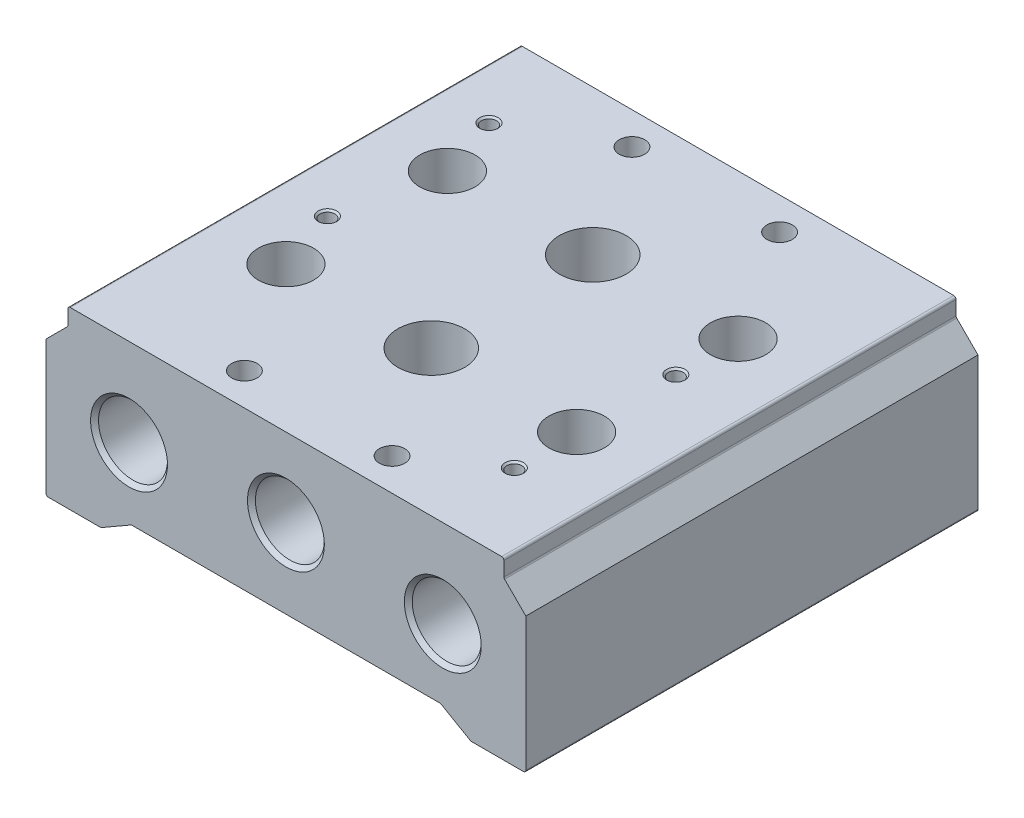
ISO-10303-21;
HEADER;
FILE_DESCRIPTION(('STEP AP214'),'2;1');
FILE_NAME('part.step','',(''),(''),'','','');
FILE_SCHEMA(('AUTOMOTIVE_DESIGN { 1 0 10303 214 1 1 1 1 }'));
ENDSEC;
DATA;
#1=APPLICATION_CONTEXT('core data for automotive mechanical design processes');
#2=APPLICATION_PROTOCOL_DEFINITION('international standard','automotive_design',2000,#1);
#3=PRODUCT_CONTEXT('',#1,'mechanical');
#4=PRODUCT('Part','Part','',(#3));
#5=PRODUCT_RELATED_PRODUCT_CATEGORY('part','',(#4));
#6=PRODUCT_DEFINITION_FORMATION('','',#4);
#7=PRODUCT_DEFINITION_CONTEXT('part definition',#1,'design');
#8=PRODUCT_DEFINITION('design','',#6,#7);
#9=PRODUCT_DEFINITION_SHAPE('','',#8);
#10=(LENGTH_UNIT() NAMED_UNIT(*) SI_UNIT(.MILLI.,.METRE.));
#11=(NAMED_UNIT(*) PLANE_ANGLE_UNIT() SI_UNIT($,.RADIAN.));
#12=(NAMED_UNIT(*) SI_UNIT($,.STERADIAN.) SOLID_ANGLE_UNIT());
#13=UNCERTAINTY_MEASURE_WITH_UNIT(LENGTH_MEASURE(1.E-05),#10,'distance_accuracy_value','');
#14=(GEOMETRIC_REPRESENTATION_CONTEXT(3) GLOBAL_UNCERTAINTY_ASSIGNED_CONTEXT((#13)) GLOBAL_UNIT_ASSIGNED_CONTEXT((#10,
#11,#12)) REPRESENTATION_CONTEXT('',''));
#15=CARTESIAN_POINT('',(0.,0.,0.));
#16=DIRECTION('',(0.,0.,1.));
#17=DIRECTION('',(1.,0.,0.));
#18=AXIS2_PLACEMENT_3D('',#15,#16,#17);
#19=CARTESIAN_POINT('',(0.,25.,31.5));
#20=DIRECTION('',(0.,1.,0.));
#21=DIRECTION('',(0.,0.,1.));
#22=AXIS2_PLACEMENT_3D('',#19,#20,#21);
#23=CYLINDRICAL_SURFACE('',#22,7.25);
#24=CARTESIAN_POINT('',(0.,38.,31.5));
#25=DIRECTION('',(0.,1.,0.));
#26=DIRECTION('',(0.,0.,1.));
#27=AXIS2_PLACEMENT_3D('',#24,#25,#26);
#28=CIRCLE('',#27,7.25);
#29=CARTESIAN_POINT('',(0.,38.,38.75));
#30=VERTEX_POINT('',#29);
#31=EDGE_CURVE('E265',#30,#30,#28,.T.);
#32=ORIENTED_EDGE('',*,*,#31,.T.);
#33=EDGE_LOOP('',(#32));
#34=FACE_BOUND('',#33,.T.);
#35=CARTESIAN_POINT('',(-6.31471495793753,25.,35.0618639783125));
#36=CARTESIAN_POINT('',(-6.2552924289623,25.0938104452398,35.1671950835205));
#37=CARTESIAN_POINT('',(-6.19313803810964,25.1873060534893,35.2712445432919));
#38=CARTESIAN_POINT('',(-6.06323019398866,25.3732977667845,35.4767511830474));
#39=CARTESIAN_POINT('',(-5.99547565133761,25.4657936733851,35.5782078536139));
#40=CARTESIAN_POINT('',(-5.78323828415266,25.7417008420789,35.8791610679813));
#41=CARTESIAN_POINT('',(-5.63012257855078,25.9229865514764,36.0746333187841));
#42=CARTESIAN_POINT('',(-5.29808146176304,26.2788204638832,36.4555485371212));
#43=CARTESIAN_POINT('',(-5.11886177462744,26.4532583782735,36.6408385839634));
#44=CARTESIAN_POINT('',(-4.73539541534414,26.7893443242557,36.9960601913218));
#45=CARTESIAN_POINT('',(-4.53118572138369,26.9510106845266,37.1660138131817));
#46=CARTESIAN_POINT('',(-4.18519153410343,27.1955456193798,37.4222008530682));
#47=CARTESIAN_POINT('',(-4.05162367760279,27.2838082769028,37.5144625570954));
#48=CARTESIAN_POINT('',(-3.77546835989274,27.4535042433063,37.6915453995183));
#49=CARTESIAN_POINT('',(-3.63288102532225,27.5349376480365,37.7763666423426));
#50=CARTESIAN_POINT('',(-3.3395106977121,27.6895946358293,37.9372384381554));
#51=CARTESIAN_POINT('',(-3.18876426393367,27.7628509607,38.0133240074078));
#52=CARTESIAN_POINT('',(-2.87896581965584,27.9004265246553,38.156059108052));
#53=CARTESIAN_POINT('',(-2.71991600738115,27.9647481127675,38.2227111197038));
#54=CARTESIAN_POINT('',(-2.41803006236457,28.0746483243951,38.3364982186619));
#55=CARTESIAN_POINT('',(-2.27622876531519,28.1215923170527,38.3850620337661));
#56=CARTESIAN_POINT('',(-1.9877278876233,28.2074402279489,38.4738222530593));
#57=CARTESIAN_POINT('',(-1.84103096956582,28.2463484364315,38.514023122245));
#58=CARTESIAN_POINT('',(-1.54338521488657,28.3155273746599,38.5854707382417));
#59=CARTESIAN_POINT('',(-1.39243433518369,28.3457938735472,38.616713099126));
#60=CARTESIAN_POINT('',(-1.08731593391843,28.3971142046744,38.6696733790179));
#61=CARTESIAN_POINT('',(-0.933148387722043,28.4181679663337,38.6913912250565));
#62=CARTESIAN_POINT('',(-0.622136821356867,28.4507118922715,38.7249567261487));
#63=CARTESIAN_POINT('',(-0.465284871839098,28.4621655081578,38.7367666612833));
#64=CARTESIAN_POINT('',(-0.150731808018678,28.4751375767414,38.7501420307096));
#65=CARTESIAN_POINT('',(0.00696930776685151,28.4766560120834,38.7517074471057));
#66=CARTESIAN_POINT('',(0.321911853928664,28.4697260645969,38.7445623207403));
#67=CARTESIAN_POINT('',(0.479153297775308,28.4612779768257,38.7358520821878));
#68=CARTESIAN_POINT('',(0.791903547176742,28.4345910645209,38.7083306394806));
#69=CARTESIAN_POINT('',(0.947412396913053,28.4163524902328,38.6895196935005));
#70=CARTESIAN_POINT('',(1.24539254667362,28.3719608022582,38.6437182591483));
#71=CARTESIAN_POINT('',(1.38804942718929,28.3464060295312,38.6173459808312));
#72=CARTESIAN_POINT('',(1.67003252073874,28.2874804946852,38.5565079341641));
#73=CARTESIAN_POINT('',(1.80935746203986,28.2541067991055,38.5220391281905));
#74=CARTESIAN_POINT('',(2.08382004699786,28.1800772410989,38.4455364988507));
#75=CARTESIAN_POINT('',(2.21896037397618,28.1394261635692,38.4035076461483));
#76=CARTESIAN_POINT('',(2.48460230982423,28.0513806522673,38.3124136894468));
#77=CARTESIAN_POINT('',(2.61510295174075,28.003984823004,38.2633471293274));
#78=CARTESIAN_POINT('',(2.9161670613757,27.8852157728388,38.1402873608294));
#79=CARTESIAN_POINT('',(3.08463273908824,27.8112805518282,38.0636051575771));
#80=CARTESIAN_POINT('',(3.41153689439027,27.6535729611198,37.8997964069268));
#81=CARTESIAN_POINT('',(3.56997230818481,27.569797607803,37.8126666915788));
#82=CARTESIAN_POINT('',(4.03106096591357,27.3049222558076,37.5366904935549));
#83=CARTESIAN_POINT('',(4.31812215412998,27.1108332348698,37.3338357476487));
#84=CARTESIAN_POINT('',(4.768020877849,26.7616125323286,36.9667349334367));
#85=CARTESIAN_POINT('',(4.94197982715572,26.6127518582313,36.8096886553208));
#86=CARTESIAN_POINT('',(5.27021071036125,26.3057491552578,36.4840552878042));
#87=CARTESIAN_POINT('',(5.42446582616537,26.1475993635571,36.3154585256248));
#88=CARTESIAN_POINT('',(5.71185456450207,25.8266111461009,35.970680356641));
#89=CARTESIAN_POINT('',(5.84522878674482,25.6638563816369,35.794620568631));
#90=CARTESIAN_POINT('',(6.03151619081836,25.416679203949,35.5243321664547));
#91=CARTESIAN_POINT('',(6.0912692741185,25.3338543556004,35.4332866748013));
#92=CARTESIAN_POINT('',(6.20631467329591,25.1674354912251,35.2491236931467));
#93=CARTESIAN_POINT('',(6.26160744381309,25.0838415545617,35.1560064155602));
#94=CARTESIAN_POINT('',(6.31471495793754,25.,35.0618639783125));
#95=B_SPLINE_CURVE_WITH_KNOTS('',3,(#35,#36,#37,#38,#39,#40,#41,#42,#43,#44,#45,#46,#47,#48,#49,
#50,#51,#52,#53,#54,#55,#56,#57,#58,#59,#60,#61,#62,#63,#64,#65,#66,#67,#68,#69,#70,#71,#72,#73,
#74,#75,#76,#77,#78,#79,#80,#81,#82,#83,#84,#85,#86,#87,#88,#89,#90,#91,#92,#93,#94),
.UNSPECIFIED.,.F.,.F.,(4,2,2,2,2,2,2,2,2,2,2,2,2,2,2,2,2,2,2,2,2,2,2,2,2,2,2,2,2,4),(0.,
0.459104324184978,0.918298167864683,1.83933106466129,2.77169189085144,3.70268939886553,
4.25660265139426,4.81050812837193,5.36210949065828,5.91356555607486,6.38429553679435,
6.85477354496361,7.32548149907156,7.79619305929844,8.26868861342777,8.74118499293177,
9.21366738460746,9.6861377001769,10.1275837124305,10.5691956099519,11.0105182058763,
11.4519322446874,12.0489822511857,12.6462137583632,13.8453970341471,14.6773564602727,
15.5100213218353,16.3322449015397,16.7426270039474,17.1529672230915),.UNSPECIFIED.);
#96=CARTESIAN_POINT('',(-6.31471495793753,25.,35.0618639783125));
#97=VERTEX_POINT('',#96);
#98=CARTESIAN_POINT('',(6.31471495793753,25.,35.0618639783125));
#99=VERTEX_POINT('',#98);
#100=EDGE_CURVE('E53',#97,#99,#95,.T.);
#101=ORIENTED_EDGE('',*,*,#100,.F.);
#102=CARTESIAN_POINT('',(0.,25.,31.5));
#103=DIRECTION('',(0.,1.,0.));
#104=DIRECTION('',(0.,0.,1.));
#105=AXIS2_PLACEMENT_3D('',#102,#103,#104);
#106=CIRCLE('',#105,7.25);
#107=CARTESIAN_POINT('',(-6.31471495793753,25.,27.9381360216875));
#108=VERTEX_POINT('',#107);
#109=EDGE_CURVE('E256',#108,#97,#106,.T.);
#110=ORIENTED_EDGE('',*,*,#109,.F.);
#111=CARTESIAN_POINT('',(6.31471495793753,25.,27.9381360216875));
#112=CARTESIAN_POINT('',(6.2552924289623,25.0938104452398,27.8328049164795));
#113=CARTESIAN_POINT('',(6.19313803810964,25.1873060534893,27.7287554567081));
#114=CARTESIAN_POINT('',(6.06323019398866,25.3732977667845,27.5232488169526));
#115=CARTESIAN_POINT('',(5.9954756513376,25.4657936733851,27.4217921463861));
#116=CARTESIAN_POINT('',(5.78323828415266,25.7417008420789,27.1208389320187));
#117=CARTESIAN_POINT('',(5.63012257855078,25.9229865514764,26.925366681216));
#118=CARTESIAN_POINT('',(5.29808146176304,26.2788204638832,26.5444514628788));
#119=CARTESIAN_POINT('',(5.11886177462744,26.4532583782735,26.3591614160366));
#120=CARTESIAN_POINT('',(4.73539541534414,26.7893443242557,26.0039398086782));
#121=CARTESIAN_POINT('',(4.53118572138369,26.9510106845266,25.8339861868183));
#122=CARTESIAN_POINT('',(4.18519153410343,27.1955456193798,25.5777991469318));
#123=CARTESIAN_POINT('',(4.05162367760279,27.2838082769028,25.4855374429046));
#124=CARTESIAN_POINT('',(3.77546835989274,27.4535042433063,25.3084546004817));
#125=CARTESIAN_POINT('',(3.63288102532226,27.5349376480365,25.2236333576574));
#126=CARTESIAN_POINT('',(3.3395106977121,27.6895946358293,25.0627615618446));
#127=CARTESIAN_POINT('',(3.18876426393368,27.7628509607,24.9866759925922));
#128=CARTESIAN_POINT('',(2.87896581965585,27.9004265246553,24.843940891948));
#129=CARTESIAN_POINT('',(2.71991600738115,27.9647481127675,24.7772888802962));
#130=CARTESIAN_POINT('',(2.41803006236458,28.0746483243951,24.6635017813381));
#131=CARTESIAN_POINT('',(2.27622876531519,28.1215923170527,24.6149379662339));
#132=CARTESIAN_POINT('',(1.9877278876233,28.2074402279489,24.5261777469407));
#133=CARTESIAN_POINT('',(1.84103096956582,28.2463484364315,24.485976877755));
#134=CARTESIAN_POINT('',(1.54338521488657,28.3155273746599,24.4145292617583));
#135=CARTESIAN_POINT('',(1.3924343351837,28.3457938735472,24.383286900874));
#136=CARTESIAN_POINT('',(1.08731593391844,28.3971142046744,24.3303266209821));
#137=CARTESIAN_POINT('',(0.933148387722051,28.4181679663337,24.3086087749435));
#138=CARTESIAN_POINT('',(0.622136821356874,28.4507118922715,24.2750432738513));
#139=CARTESIAN_POINT('',(0.465284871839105,28.4621655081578,24.2632333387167));
#140=CARTESIAN_POINT('',(0.150731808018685,28.4751375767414,24.2498579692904));
#141=CARTESIAN_POINT('',(-0.00696930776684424,28.4766560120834,24.2482925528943));
#142=CARTESIAN_POINT('',(-0.321911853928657,28.4697260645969,24.2554376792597));
#143=CARTESIAN_POINT('',(-0.479153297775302,28.4612779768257,24.2641479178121));
#144=CARTESIAN_POINT('',(-0.791903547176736,28.4345910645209,24.2916693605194));
#145=CARTESIAN_POINT('',(-0.947412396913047,28.4163524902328,24.3104803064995));
#146=CARTESIAN_POINT('',(-1.24539254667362,28.3719608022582,24.3562817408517));
#147=CARTESIAN_POINT('',(-1.38804942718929,28.3464060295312,24.3826540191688));
#148=CARTESIAN_POINT('',(-1.67003252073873,28.2874804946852,24.4434920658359));
#149=CARTESIAN_POINT('',(-1.80935746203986,28.2541067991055,24.4779608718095));
#150=CARTESIAN_POINT('',(-2.08382004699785,28.1800772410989,24.5544635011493));
#151=CARTESIAN_POINT('',(-2.21896037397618,28.1394261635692,24.5964923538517));
#152=CARTESIAN_POINT('',(-2.48460230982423,28.0513806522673,24.6875863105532));
#153=CARTESIAN_POINT('',(-2.61510295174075,28.003984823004,24.7366528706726));
#154=CARTESIAN_POINT('',(-2.91616706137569,27.8852157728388,24.8597126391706));
#155=CARTESIAN_POINT('',(-3.08463273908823,27.8112805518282,24.9363948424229));
#156=CARTESIAN_POINT('',(-3.41153689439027,27.6535729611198,25.1002035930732));
#157=CARTESIAN_POINT('',(-3.5699723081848,27.569797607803,25.1873333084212));
#158=CARTESIAN_POINT('',(-4.03106096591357,27.3049222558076,25.463309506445));
#159=CARTESIAN_POINT('',(-4.31812215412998,27.1108332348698,25.6661642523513));
#160=CARTESIAN_POINT('',(-4.768020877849,26.7616125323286,26.0332650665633));
#161=CARTESIAN_POINT('',(-4.94197982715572,26.6127518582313,26.1903113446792));
#162=CARTESIAN_POINT('',(-5.27021071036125,26.3057491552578,26.5159447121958));
#163=CARTESIAN_POINT('',(-5.42446582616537,26.1475993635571,26.6845414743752));
#164=CARTESIAN_POINT('',(-5.71185456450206,25.8266111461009,27.029319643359));
#165=CARTESIAN_POINT('',(-5.84522878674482,25.6638563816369,27.205379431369));
#166=CARTESIAN_POINT('',(-6.03151619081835,25.416679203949,27.4756678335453));
#167=CARTESIAN_POINT('',(-6.0912692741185,25.3338543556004,27.5667133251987));
#168=CARTESIAN_POINT('',(-6.20631467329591,25.1674354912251,27.7508763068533));
#169=CARTESIAN_POINT('',(-6.26160744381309,25.0838415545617,27.8439935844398));
#170=CARTESIAN_POINT('',(-6.31471495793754,25.,27.9381360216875));
#171=B_SPLINE_CURVE_WITH_KNOTS('',3,(#111,#112,#113,#114,#115,#116,#117,#118,#119,#120,#121,
#122,#123,#124,#125,#126,#127,#128,#129,#130,#131,#132,#133,#134,#135,#136,#137,#138,#139,#140,
#141,#142,#143,#144,#145,#146,#147,#148,#149,#150,#151,#152,#153,#154,#155,#156,#157,#158,#159,
#160,#161,#162,#163,#164,#165,#166,#167,#168,#169,#170),.UNSPECIFIED.,.F.,.F.,(4,2,2,2,2,2,2,2,
2,2,2,2,2,2,2,2,2,2,2,2,2,2,2,2,2,2,2,2,2,4),(0.,0.459104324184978,0.918298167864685,
1.8393310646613,2.77169189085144,3.70268939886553,4.25660265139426,4.81050812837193,
5.36210949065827,5.91356555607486,6.38429553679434,6.85477354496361,7.32548149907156,
7.79619305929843,8.26868861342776,8.74118499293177,9.21366738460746,9.6861377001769,
10.1275837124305,10.5691956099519,11.0105182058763,11.4519322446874,12.0489822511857,
12.6462137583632,13.8453970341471,14.6773564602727,15.5100213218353,16.3322449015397,
16.7426270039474,17.1529672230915),.UNSPECIFIED.);
#172=CARTESIAN_POINT('',(6.31471495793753,25.,27.9381360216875));
#173=VERTEX_POINT('',#172);
#174=EDGE_CURVE('E247',#173,#108,#171,.T.);
#175=ORIENTED_EDGE('',*,*,#174,.F.);
#176=EDGE_CURVE('E254',#99,#173,#106,.T.);
#177=ORIENTED_EDGE('',*,*,#176,.F.);
#178=EDGE_LOOP('',(#101,#110,#175,#177));
#179=FACE_BOUND('',#178,.T.);
#180=ADVANCED_FACE('F38',(#34,#179),#23,.F.);
#181=CARTESIAN_POINT('',(0.,25.,31.5));
#182=DIRECTION('',(0.,1.,0.));
#183=DIRECTION('',(0.,0.,1.));
#184=AXIS2_PLACEMENT_3D('',#181,#182,#183);
#185=PLANE('',#184);
#186=ORIENTED_EDGE('',*,*,#109,.T.);
#187=DIRECTION('',(0.,0.,1.));
#188=VECTOR('',#187,1.);
#189=CARTESIAN_POINT('',(-6.31471495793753,25.,0.));
#190=LINE('',#189,#188);
#191=EDGE_CURVE('E11',#97,#108,#190,.F.);
#192=ORIENTED_EDGE('',*,*,#191,.T.);
#193=EDGE_LOOP('',(#186,#192));
#194=FACE_BOUND('',#193,.T.);
#195=ADVANCED_FACE('F509',(#194),#185,.T.);
#196=ORIENTED_EDGE('',*,*,#176,.T.);
#197=DIRECTION('',(0.,0.,1.));
#198=VECTOR('',#197,1.);
#199=CARTESIAN_POINT('',(6.31471495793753,25.,0.));
#200=LINE('',#199,#198);
#201=EDGE_CURVE('E46',#173,#99,#200,.T.);
#202=ORIENTED_EDGE('',*,*,#201,.T.);
#203=EDGE_LOOP('',(#196,#202));
#204=FACE_BOUND('',#203,.T.);
#205=ADVANCED_FACE('F259',(#204),#185,.T.);
#206=CARTESIAN_POINT('',(0.,25.,66.5));
#207=DIRECTION('',(0.,1.,0.));
#208=DIRECTION('',(0.,0.,1.));
#209=AXIS2_PLACEMENT_3D('',#206,#207,#208);
#210=CYLINDRICAL_SURFACE('',#209,7.25);
#211=CARTESIAN_POINT('',(0.,38.,66.5));
#212=DIRECTION('',(0.,1.,0.));
#213=DIRECTION('',(0.,0.,1.));
#214=AXIS2_PLACEMENT_3D('',#211,#212,#213);
#215=CIRCLE('',#214,7.25);
#216=CARTESIAN_POINT('',(0.,38.,73.75));
#217=VERTEX_POINT('',#216);
#218=EDGE_CURVE('E268',#217,#217,#215,.T.);
#219=ORIENTED_EDGE('',*,*,#218,.T.);
#220=EDGE_LOOP('',(#219));
#221=FACE_BOUND('',#220,.T.);
#222=CARTESIAN_POINT('',(-6.31471495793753,25.,70.0618639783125));
#223=CARTESIAN_POINT('',(-6.2552924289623,25.0938104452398,70.1671950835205));
#224=CARTESIAN_POINT('',(-6.19313803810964,25.1873060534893,70.271244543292));
#225=CARTESIAN_POINT('',(-6.06323019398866,25.3732977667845,70.4767511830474));
#226=CARTESIAN_POINT('',(-5.9954756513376,25.4657936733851,70.5782078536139));
#227=CARTESIAN_POINT('',(-5.78323828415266,25.7417008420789,70.8791610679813));
#228=CARTESIAN_POINT('',(-5.63012257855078,25.9229865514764,71.0746333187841));
#229=CARTESIAN_POINT('',(-5.29808146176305,26.2788204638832,71.4555485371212));
#230=CARTESIAN_POINT('',(-5.11886177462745,26.4532583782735,71.6408385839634));
#231=CARTESIAN_POINT('',(-4.73539541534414,26.7893443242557,71.9960601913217));
#232=CARTESIAN_POINT('',(-4.53118572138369,26.9510106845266,72.1660138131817));
#233=CARTESIAN_POINT('',(-4.18519153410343,27.1955456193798,72.4222008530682));
#234=CARTESIAN_POINT('',(-4.05162367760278,27.2838082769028,72.5144625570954));
#235=CARTESIAN_POINT('',(-3.77546835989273,27.4535042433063,72.6915453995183));
#236=CARTESIAN_POINT('',(-3.63288102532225,27.5349376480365,72.7763666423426));
#237=CARTESIAN_POINT('',(-3.33951069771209,27.6895946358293,72.9372384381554));
#238=CARTESIAN_POINT('',(-3.18876426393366,27.7628509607,73.0133240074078));
#239=CARTESIAN_POINT('',(-2.87896581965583,27.9004265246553,73.156059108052));
#240=CARTESIAN_POINT('',(-2.71991600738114,27.9647481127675,73.2227111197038));
#241=CARTESIAN_POINT('',(-2.41803006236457,28.0746483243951,73.3364982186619));
#242=CARTESIAN_POINT('',(-2.27622876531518,28.1215923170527,73.3850620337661));
#243=CARTESIAN_POINT('',(-1.98772788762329,28.2074402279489,73.4738222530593));
#244=CARTESIAN_POINT('',(-1.84103096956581,28.2463484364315,73.514023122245));
#245=CARTESIAN_POINT('',(-1.54338521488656,28.3155273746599,73.5854707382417));
#246=CARTESIAN_POINT('',(-1.39243433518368,28.3457938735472,73.616713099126));
#247=CARTESIAN_POINT('',(-1.08731593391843,28.3971142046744,73.6696733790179));
#248=CARTESIAN_POINT('',(-0.933148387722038,28.4181679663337,73.6913912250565));
#249=CARTESIAN_POINT('',(-0.622136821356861,28.4507118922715,73.7249567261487));
#250=CARTESIAN_POINT('',(-0.465284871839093,28.4621655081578,73.7367666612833));
#251=CARTESIAN_POINT('',(-0.150731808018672,28.4751375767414,73.7501420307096));
#252=CARTESIAN_POINT('',(0.00696930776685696,28.4766560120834,73.7517074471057));
#253=CARTESIAN_POINT('',(0.32191185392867,28.4697260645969,73.7445623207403));
#254=CARTESIAN_POINT('',(0.479153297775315,28.4612779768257,73.7358520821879));
#255=CARTESIAN_POINT('',(0.791903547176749,28.4345910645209,73.7083306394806));
#256=CARTESIAN_POINT('',(0.94741239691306,28.4163524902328,73.6895196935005));
#257=CARTESIAN_POINT('',(1.24539254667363,28.3719608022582,73.6437182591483));
#258=CARTESIAN_POINT('',(1.3880494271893,28.3464060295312,73.6173459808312));
#259=CARTESIAN_POINT('',(1.67003252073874,28.2874804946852,73.5565079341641));
#260=CARTESIAN_POINT('',(1.80935746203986,28.2541067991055,73.5220391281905));
#261=CARTESIAN_POINT('',(2.08382004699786,28.1800772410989,73.4455364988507));
#262=CARTESIAN_POINT('',(2.21896037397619,28.1394261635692,73.4035076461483));
#263=CARTESIAN_POINT('',(2.48460230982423,28.0513806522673,73.3124136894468));
#264=CARTESIAN_POINT('',(2.61510295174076,28.003984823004,73.2633471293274));
#265=CARTESIAN_POINT('',(2.91616706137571,27.8852157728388,73.1402873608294));
#266=CARTESIAN_POINT('',(3.08463273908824,27.8112805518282,73.0636051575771));
#267=CARTESIAN_POINT('',(3.41153689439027,27.6535729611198,72.8997964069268));
#268=CARTESIAN_POINT('',(3.56997230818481,27.569797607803,72.8126666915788));
#269=CARTESIAN_POINT('',(4.03106096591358,27.3049222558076,72.5366904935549));
#270=CARTESIAN_POINT('',(4.31812215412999,27.1108332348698,72.3338357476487));
#271=CARTESIAN_POINT('',(4.768020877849,26.7616125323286,71.9667349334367));
#272=CARTESIAN_POINT('',(4.94197982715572,26.6127518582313,71.8096886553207));
#273=CARTESIAN_POINT('',(5.27021071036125,26.3057491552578,71.4840552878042));
#274=CARTESIAN_POINT('',(5.42446582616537,26.1475993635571,71.3154585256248));
#275=CARTESIAN_POINT('',(5.71185456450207,25.8266111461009,70.970680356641));
#276=CARTESIAN_POINT('',(5.84522878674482,25.6638563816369,70.794620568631));
#277=CARTESIAN_POINT('',(6.03151619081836,25.416679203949,70.5243321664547));
#278=CARTESIAN_POINT('',(6.0912692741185,25.3338543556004,70.4332866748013));
#279=CARTESIAN_POINT('',(6.20631467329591,25.1674354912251,70.2491236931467));
#280=CARTESIAN_POINT('',(6.26160744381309,25.0838415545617,70.1560064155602));
#281=CARTESIAN_POINT('',(6.31471495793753,25.,70.0618639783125));
#282=B_SPLINE_CURVE_WITH_KNOTS('',3,(#222,#223,#224,#225,#226,#227,#228,#229,#230,#231,#232,
#233,#234,#235,#236,#237,#238,#239,#240,#241,#242,#243,#244,#245,#246,#247,#248,#249,#250,#251,
#252,#253,#254,#255,#256,#257,#258,#259,#260,#261,#262,#263,#264,#265,#266,#267,#268,#269,#270,
#271,#272,#273,#274,#275,#276,#277,#278,#279,#280,#281),.UNSPECIFIED.,.F.,.F.,(4,2,2,2,2,2,2,2,
2,2,2,2,2,2,2,2,2,2,2,2,2,2,2,2,2,2,2,2,2,4),(0.,0.459104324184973,0.918298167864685,
1.8393310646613,2.77169189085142,3.70268939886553,4.25660265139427,4.81050812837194,
5.36210949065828,5.91356555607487,6.38429553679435,6.85477354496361,7.32548149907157,
7.79619305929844,8.26868861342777,8.74118499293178,9.21366738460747,9.68613770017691,
10.1275837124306,10.5691956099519,11.0105182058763,11.4519322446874,12.0489822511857,
12.6462137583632,13.8453970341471,14.6773564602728,15.5100213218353,16.3322449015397,
16.7426270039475,17.1529672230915),.UNSPECIFIED.);
#283=CARTESIAN_POINT('',(-6.31471495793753,25.,70.0618639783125));
#284=VERTEX_POINT('',#283);
#285=CARTESIAN_POINT('',(6.31471495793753,25.,70.0618639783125));
#286=VERTEX_POINT('',#285);
#287=EDGE_CURVE('E61',#284,#286,#282,.T.);
#288=ORIENTED_EDGE('',*,*,#287,.F.);
#289=CARTESIAN_POINT('',(0.,25.,66.5));
#290=DIRECTION('',(0.,1.,0.));
#291=DIRECTION('',(0.,0.,1.));
#292=AXIS2_PLACEMENT_3D('',#289,#290,#291);
#293=CIRCLE('',#292,7.25);
#294=CARTESIAN_POINT('',(-6.31471495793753,25.,62.9381360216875));
#295=VERTEX_POINT('',#294);
#296=EDGE_CURVE('E666',#295,#284,#293,.T.);
#297=ORIENTED_EDGE('',*,*,#296,.F.);
#298=CARTESIAN_POINT('',(6.31471495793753,25.,62.9381360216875));
#299=CARTESIAN_POINT('',(6.2552924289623,25.0938104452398,62.8328049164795));
#300=CARTESIAN_POINT('',(6.19313803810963,25.1873060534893,62.7287554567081));
#301=CARTESIAN_POINT('',(6.06323019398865,25.3732977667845,62.5232488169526));
#302=CARTESIAN_POINT('',(5.9954756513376,25.4657936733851,62.4217921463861));
#303=CARTESIAN_POINT('',(5.78323828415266,25.7417008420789,62.1208389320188));
#304=CARTESIAN_POINT('',(5.63012257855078,25.9229865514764,61.925366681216));
#305=CARTESIAN_POINT('',(5.29808146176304,26.2788204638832,61.5444514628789));
#306=CARTESIAN_POINT('',(5.11886177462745,26.4532583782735,61.3591614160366));
#307=CARTESIAN_POINT('',(4.73539541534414,26.7893443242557,61.0039398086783));
#308=CARTESIAN_POINT('',(4.5311857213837,26.9510106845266,60.8339861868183));
#309=CARTESIAN_POINT('',(4.18519153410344,27.1955456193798,60.5777991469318));
#310=CARTESIAN_POINT('',(4.05162367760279,27.2838082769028,60.4855374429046));
#311=CARTESIAN_POINT('',(3.77546835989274,27.4535042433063,60.3084546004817));
#312=CARTESIAN_POINT('',(3.63288102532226,27.5349376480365,60.2236333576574));
#313=CARTESIAN_POINT('',(3.3395106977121,27.6895946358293,60.0627615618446));
#314=CARTESIAN_POINT('',(3.18876426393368,27.7628509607,59.9866759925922));
#315=CARTESIAN_POINT('',(2.87896581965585,27.9004265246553,59.843940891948));
#316=CARTESIAN_POINT('',(2.71991600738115,27.9647481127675,59.7772888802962));
#317=CARTESIAN_POINT('',(2.41803006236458,28.0746483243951,59.6635017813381));
#318=CARTESIAN_POINT('',(2.27622876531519,28.1215923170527,59.6149379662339));
#319=CARTESIAN_POINT('',(1.9877278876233,28.2074402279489,59.5261777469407));
#320=CARTESIAN_POINT('',(1.84103096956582,28.2463484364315,59.485976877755));
#321=CARTESIAN_POINT('',(1.54338521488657,28.3155273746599,59.4145292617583));
#322=CARTESIAN_POINT('',(1.39243433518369,28.3457938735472,59.383286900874));
#323=CARTESIAN_POINT('',(1.08731593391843,28.3971142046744,59.3303266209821));
#324=CARTESIAN_POINT('',(0.933148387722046,28.4181679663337,59.3086087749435));
#325=CARTESIAN_POINT('',(0.62213682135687,28.4507118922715,59.2750432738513));
#326=CARTESIAN_POINT('',(0.465284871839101,28.4621655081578,59.2632333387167));
#327=CARTESIAN_POINT('',(0.150731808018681,28.4751375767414,59.2498579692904));
#328=CARTESIAN_POINT('',(-0.00696930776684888,28.4766560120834,59.2482925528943));
#329=CARTESIAN_POINT('',(-0.321911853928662,28.4697260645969,59.2554376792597));
#330=CARTESIAN_POINT('',(-0.479153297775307,28.4612779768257,59.2641479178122));
#331=CARTESIAN_POINT('',(-0.791903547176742,28.4345910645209,59.2916693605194));
#332=CARTESIAN_POINT('',(-0.947412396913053,28.4163524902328,59.3104803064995));
#333=CARTESIAN_POINT('',(-1.24539254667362,28.3719608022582,59.3562817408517));
#334=CARTESIAN_POINT('',(-1.38804942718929,28.3464060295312,59.3826540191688));
#335=CARTESIAN_POINT('',(-1.67003252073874,28.2874804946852,59.4434920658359));
#336=CARTESIAN_POINT('',(-1.80935746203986,28.2541067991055,59.4779608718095));
#337=CARTESIAN_POINT('',(-2.08382004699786,28.1800772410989,59.5544635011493));
#338=CARTESIAN_POINT('',(-2.21896037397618,28.1394261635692,59.5964923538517));
#339=CARTESIAN_POINT('',(-2.48460230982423,28.0513806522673,59.6875863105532));
#340=CARTESIAN_POINT('',(-2.61510295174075,28.003984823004,59.7366528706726));
#341=CARTESIAN_POINT('',(-2.9161670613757,27.8852157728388,59.8597126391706));
#342=CARTESIAN_POINT('',(-3.08463273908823,27.8112805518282,59.9363948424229));
#343=CARTESIAN_POINT('',(-3.41153689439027,27.6535729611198,60.1002035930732));
#344=CARTESIAN_POINT('',(-3.56997230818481,27.569797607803,60.1873333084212));
#345=CARTESIAN_POINT('',(-4.03106096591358,27.3049222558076,60.463309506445));
#346=CARTESIAN_POINT('',(-4.31812215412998,27.1108332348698,60.6661642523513));
#347=CARTESIAN_POINT('',(-4.768020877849,26.7616125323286,61.0332650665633));
#348=CARTESIAN_POINT('',(-4.94197982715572,26.6127518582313,61.1903113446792));
#349=CARTESIAN_POINT('',(-5.27021071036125,26.3057491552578,61.5159447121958));
#350=CARTESIAN_POINT('',(-5.42446582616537,26.1475993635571,61.6845414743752));
#351=CARTESIAN_POINT('',(-5.71185456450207,25.8266111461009,62.029319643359));
#352=CARTESIAN_POINT('',(-5.84522878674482,25.6638563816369,62.205379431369));
#353=CARTESIAN_POINT('',(-6.03151619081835,25.416679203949,62.4756678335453));
#354=CARTESIAN_POINT('',(-6.09126927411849,25.3338543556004,62.5667133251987));
#355=CARTESIAN_POINT('',(-6.20631467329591,25.1674354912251,62.7508763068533));
#356=CARTESIAN_POINT('',(-6.26160744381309,25.0838415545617,62.8439935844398));
#357=CARTESIAN_POINT('',(-6.31471495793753,25.,62.9381360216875));
#358=B_SPLINE_CURVE_WITH_KNOTS('',3,(#298,#299,#300,#301,#302,#303,#304,#305,#306,#307,#308,
#309,#310,#311,#312,#313,#314,#315,#316,#317,#318,#319,#320,#321,#322,#323,#324,#325,#326,#327,
#328,#329,#330,#331,#332,#333,#334,#335,#336,#337,#338,#339,#340,#341,#342,#343,#344,#345,#346,
#347,#348,#349,#350,#351,#352,#353,#354,#355,#356,#357),.UNSPECIFIED.,.F.,.F.,(4,2,2,2,2,2,2,2,
2,2,2,2,2,2,2,2,2,2,2,2,2,2,2,2,2,2,2,2,2,4),(0.,0.459104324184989,0.918298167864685,
1.8393310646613,2.77169189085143,3.70268939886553,4.25660265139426,4.81050812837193,
5.36210949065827,5.91356555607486,6.38429553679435,6.85477354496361,7.32548149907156,
7.79619305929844,8.26868861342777,8.74118499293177,9.21366738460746,9.6861377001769,
10.1275837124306,10.5691956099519,11.0105182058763,11.4519322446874,12.0489822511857,
12.6462137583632,13.8453970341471,14.6773564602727,15.5100213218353,16.3322449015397,
16.7426270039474,17.1529672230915),.UNSPECIFIED.);
#359=CARTESIAN_POINT('',(6.31471495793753,25.,62.9381360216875));
#360=VERTEX_POINT('',#359);
#361=EDGE_CURVE('E513',#360,#295,#358,.T.);
#362=ORIENTED_EDGE('',*,*,#361,.F.);
#363=EDGE_CURVE('E271',#286,#360,#293,.T.);
#364=ORIENTED_EDGE('',*,*,#363,.F.);
#365=EDGE_LOOP('',(#288,#297,#362,#364));
#366=FACE_BOUND('',#365,.T.);
#367=ADVANCED_FACE('F503',(#221,#366),#210,.F.);
#368=CARTESIAN_POINT('',(0.,25.,66.5));
#369=DIRECTION('',(0.,1.,0.));
#370=DIRECTION('',(0.,0.,1.));
#371=AXIS2_PLACEMENT_3D('',#368,#369,#370);
#372=PLANE('',#371);
#373=ORIENTED_EDGE('',*,*,#296,.T.);
#374=DIRECTION('',(0.,0.,1.));
#375=VECTOR('',#374,1.);
#376=CARTESIAN_POINT('',(-6.31471495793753,25.,49.));
#377=LINE('',#376,#375);
#378=EDGE_CURVE('E251',#284,#295,#377,.F.);
#379=ORIENTED_EDGE('',*,*,#378,.T.);
#380=EDGE_LOOP('',(#373,#379));
#381=FACE_BOUND('',#380,.T.);
#382=ADVANCED_FACE('F499',(#381),#372,.T.);
#383=ORIENTED_EDGE('',*,*,#363,.T.);
#384=DIRECTION('',(0.,0.,1.));
#385=VECTOR('',#384,1.);
#386=CARTESIAN_POINT('',(6.31471495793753,25.,49.));
#387=LINE('',#386,#385);
#388=EDGE_CURVE('E606',#360,#286,#387,.T.);
#389=ORIENTED_EDGE('',*,*,#388,.T.);
#390=EDGE_LOOP('',(#383,#389));
#391=FACE_BOUND('',#390,.T.);
#392=ADVANCED_FACE('F502',(#391),#372,.T.);
#393=CARTESIAN_POINT('',(-47.3964466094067,34.0535533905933,98.));
#394=DIRECTION('',(0.707106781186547,-0.707106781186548,0.));
#395=DIRECTION('',(0.707106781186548,0.707106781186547,0.));
#396=AXIS2_PLACEMENT_3D('',#393,#394,#395);
#397=PLANE('',#396);
#398=DIRECTION('',(-0.707106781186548,-0.707106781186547,0.));
#399=VECTOR('',#398,1.);
#400=CARTESIAN_POINT('',(-47.3964466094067,34.0535533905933,0.));
#401=LINE('',#400,#399);
#402=CARTESIAN_POINT('',(-47.3964466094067,34.0535533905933,0.));
#403=VERTEX_POINT('',#402);
#404=CARTESIAN_POINT('',(-52.,29.45,0.));
#405=VERTEX_POINT('',#404);
#406=EDGE_CURVE('E305',#403,#405,#401,.T.);
#407=ORIENTED_EDGE('',*,*,#406,.T.);
#408=DIRECTION('',(0.,0.,-1.));
#409=VECTOR('',#408,1.);
#410=CARTESIAN_POINT('',(-52.,29.45,98.));
#411=LINE('',#410,#409);
#412=CARTESIAN_POINT('',(-52.,29.45,98.));
#413=VERTEX_POINT('',#412);
#414=EDGE_CURVE('E458',#413,#405,#411,.T.);
#415=ORIENTED_EDGE('',*,*,#414,.F.);
#416=DIRECTION('',(-0.707106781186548,-0.707106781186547,0.));
#417=VECTOR('',#416,1.);
#418=CARTESIAN_POINT('',(-47.3964466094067,34.0535533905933,98.));
#419=LINE('',#418,#417);
#420=CARTESIAN_POINT('',(-47.3964466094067,34.0535533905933,98.));
#421=VERTEX_POINT('',#420);
#422=EDGE_CURVE('E306',#421,#413,#419,.T.);
#423=ORIENTED_EDGE('',*,*,#422,.F.);
#424=DIRECTION('',(0.,0.,-1.));
#425=VECTOR('',#424,1.);
#426=CARTESIAN_POINT('',(-47.3964466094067,34.0535533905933,98.));
#427=LINE('',#426,#425);
#428=EDGE_CURVE('E352',#421,#403,#427,.T.);
#429=ORIENTED_EDGE('',*,*,#428,.T.);
#430=EDGE_LOOP('',(#407,#415,#423,#429));
#431=FACE_BOUND('',#430,.T.);
#432=ADVANCED_FACE('F744',(#431),#397,.F.);
#433=CARTESIAN_POINT('',(-52.,29.45,98.));
#434=DIRECTION('',(1.,0.,0.));
#435=DIRECTION('',(0.,0.,-1.));
#436=AXIS2_PLACEMENT_3D('',#433,#434,#435);
#437=PLANE('',#436);
#438=DIRECTION('',(0.,-1.,0.));
#439=VECTOR('',#438,1.);
#440=CARTESIAN_POINT('',(-52.,29.45,0.));
#441=LINE('',#440,#439);
#442=CARTESIAN_POINT('',(-52.,0.499999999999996,0.));
#443=VERTEX_POINT('',#442);
#444=EDGE_CURVE('E355',#405,#443,#441,.T.);
#445=ORIENTED_EDGE('',*,*,#444,.T.);
#446=DIRECTION('',(0.,0.,-1.));
#447=VECTOR('',#446,1.);
#448=CARTESIAN_POINT('',(-52.,0.499999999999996,98.));
#449=LINE('',#448,#447);
#450=CARTESIAN_POINT('',(-52.,0.499999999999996,98.));
#451=VERTEX_POINT('',#450);
#452=EDGE_CURVE('E455',#451,#443,#449,.T.);
#453=ORIENTED_EDGE('',*,*,#452,.F.);
#454=DIRECTION('',(0.,-1.,0.));
#455=VECTOR('',#454,1.);
#456=CARTESIAN_POINT('',(-52.,29.45,98.));
#457=LINE('',#456,#455);
#458=EDGE_CURVE('E309',#413,#451,#457,.T.);
#459=ORIENTED_EDGE('',*,*,#458,.F.);
#460=ORIENTED_EDGE('',*,*,#414,.T.);
#461=EDGE_LOOP('',(#445,#453,#459,#460));
#462=FACE_BOUND('',#461,.T.);
#463=ADVANCED_FACE('F748',(#462),#437,.F.);
#464=CARTESIAN_POINT('',(-51.5,0.500000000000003,98.));
#465=DIRECTION('',(0.,0.,-1.));
#466=DIRECTION('',(-1.,0.,0.));
#467=AXIS2_PLACEMENT_3D('',#464,#465,#466);
#468=CYLINDRICAL_SURFACE('',#467,0.500000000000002);
#469=CARTESIAN_POINT('',(-51.5,0.500000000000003,0.));
#470=DIRECTION('',(0.,0.,1.));
#471=DIRECTION('',(1.,0.,0.));
#472=AXIS2_PLACEMENT_3D('',#469,#470,#471);
#473=CIRCLE('',#472,0.500000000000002);
#474=CARTESIAN_POINT('',(-51.5,0.,0.));
#475=VERTEX_POINT('',#474);
#476=EDGE_CURVE('E357',#443,#475,#473,.T.);
#477=ORIENTED_EDGE('',*,*,#476,.T.);
#478=DIRECTION('',(0.,0.,-1.));
#479=VECTOR('',#478,1.);
#480=CARTESIAN_POINT('',(-51.5,0.,98.));
#481=LINE('',#480,#479);
#482=CARTESIAN_POINT('',(-51.5,0.,98.));
#483=VERTEX_POINT('',#482);
#484=EDGE_CURVE('E452',#483,#475,#481,.T.);
#485=ORIENTED_EDGE('',*,*,#484,.F.);
#486=CARTESIAN_POINT('',(-51.5,0.500000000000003,98.));
#487=DIRECTION('',(0.,0.,1.));
#488=DIRECTION('',(1.,0.,0.));
#489=AXIS2_PLACEMENT_3D('',#486,#487,#488);
#490=CIRCLE('',#489,0.500000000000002);
#491=EDGE_CURVE('E312',#451,#483,#490,.T.);
#492=ORIENTED_EDGE('',*,*,#491,.F.);
#493=ORIENTED_EDGE('',*,*,#452,.T.);
#494=EDGE_LOOP('',(#477,#485,#492,#493));
#495=FACE_BOUND('',#494,.T.);
#496=ADVANCED_FACE('F754',(#495),#468,.T.);
#497=CARTESIAN_POINT('',(-51.5,0.,98.));
#498=DIRECTION('',(0.,1.,0.));
#499=DIRECTION('',(0.,0.,1.));
#500=AXIS2_PLACEMENT_3D('',#497,#498,#499);
#501=PLANE('',#500);
#502=DIRECTION('',(1.,0.,0.));
#503=VECTOR('',#502,1.);
#504=CARTESIAN_POINT('',(-51.5,0.,0.));
#505=LINE('',#504,#503);
#506=CARTESIAN_POINT('',(-40.2157676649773,0.,0.));
#507=VERTEX_POINT('',#506);
#508=EDGE_CURVE('E359',#475,#507,#505,.T.);
#509=ORIENTED_EDGE('',*,*,#508,.T.);
#510=DIRECTION('',(0.,0.,-1.));
#511=VECTOR('',#510,1.);
#512=CARTESIAN_POINT('',(-40.2157676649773,0.,98.));
#513=LINE('',#512,#511);
#514=CARTESIAN_POINT('',(-40.2157676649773,0.,98.));
#515=VERTEX_POINT('',#514);
#516=EDGE_CURVE('E449',#515,#507,#513,.T.);
#517=ORIENTED_EDGE('',*,*,#516,.F.);
#518=DIRECTION('',(1.,0.,0.));
#519=VECTOR('',#518,1.);
#520=CARTESIAN_POINT('',(-51.5,0.,98.));
#521=LINE('',#520,#519);
#522=EDGE_CURVE('E314',#483,#515,#521,.T.);
#523=ORIENTED_EDGE('',*,*,#522,.F.);
#524=ORIENTED_EDGE('',*,*,#484,.T.);
#525=EDGE_LOOP('',(#509,#517,#523,#524));
#526=FACE_BOUND('',#525,.T.);
#527=ADVANCED_FACE('F872',(#526),#501,.F.);
#528=CARTESIAN_POINT('',(-40.2157676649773,0.499999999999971,98.));
#529=DIRECTION('',(0.,0.,-1.));
#530=DIRECTION('',(-1.,0.,0.));
#531=AXIS2_PLACEMENT_3D('',#528,#529,#530);
#532=CYLINDRICAL_SURFACE('',#531,0.499999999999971);
#533=CARTESIAN_POINT('',(-40.2157676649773,0.499999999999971,0.));
#534=DIRECTION('',(0.,0.,1.));
#535=DIRECTION('',(1.,0.,0.));
#536=AXIS2_PLACEMENT_3D('',#533,#534,#535);
#537=CIRCLE('',#536,0.499999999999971);
#538=CARTESIAN_POINT('',(-39.9657676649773,0.0669872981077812,0.));
#539=VERTEX_POINT('',#538);
#540=EDGE_CURVE('E361',#507,#539,#537,.T.);
#541=ORIENTED_EDGE('',*,*,#540,.T.);
#542=DIRECTION('',(0.,0.,-1.));
#543=VECTOR('',#542,1.);
#544=CARTESIAN_POINT('',(-39.9657676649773,0.0669872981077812,98.));
#545=LINE('',#544,#543);
#546=CARTESIAN_POINT('',(-39.9657676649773,0.0669872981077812,98.));
#547=VERTEX_POINT('',#546);
#548=EDGE_CURVE('E446',#547,#539,#545,.T.);
#549=ORIENTED_EDGE('',*,*,#548,.F.);
#550=CARTESIAN_POINT('',(-40.2157676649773,0.499999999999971,98.));
#551=DIRECTION('',(0.,0.,1.));
#552=DIRECTION('',(1.,0.,0.));
#553=AXIS2_PLACEMENT_3D('',#550,#551,#552);
#554=CIRCLE('',#553,0.499999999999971);
#555=EDGE_CURVE('E316',#515,#547,#554,.T.);
#556=ORIENTED_EDGE('',*,*,#555,.F.);
#557=ORIENTED_EDGE('',*,*,#516,.T.);
#558=EDGE_LOOP('',(#541,#549,#556,#557));
#559=FACE_BOUND('',#558,.T.);
#560=ADVANCED_FACE('F867',(#559),#532,.T.);
#561=CARTESIAN_POINT('',(-39.9657676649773,0.0669872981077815,98.));
#562=DIRECTION('',(-0.5,0.866025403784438,0.));
#563=DIRECTION('',(-0.866025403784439,-0.5,0.));
#564=AXIS2_PLACEMENT_3D('',#561,#562,#563);
#565=PLANE('',#564);
#566=DIRECTION('',(0.866025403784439,0.5,0.));
#567=VECTOR('',#566,1.);
#568=CARTESIAN_POINT('',(-39.9657676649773,0.0669872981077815,0.));
#569=LINE('',#568,#567);
#570=CARTESIAN_POINT('',(-33.6160254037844,3.73301270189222,0.));
#571=VERTEX_POINT('',#570);
#572=EDGE_CURVE('E363',#539,#571,#569,.T.);
#573=ORIENTED_EDGE('',*,*,#572,.T.);
#574=DIRECTION('',(0.,0.,-1.));
#575=VECTOR('',#574,1.);
#576=CARTESIAN_POINT('',(-33.6160254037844,3.73301270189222,98.));
#577=LINE('',#576,#575);
#578=CARTESIAN_POINT('',(-33.6160254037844,3.73301270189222,98.));
#579=VERTEX_POINT('',#578);
#580=EDGE_CURVE('E443',#579,#571,#577,.T.);
#581=ORIENTED_EDGE('',*,*,#580,.F.);
#582=DIRECTION('',(0.866025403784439,0.5,0.));
#583=VECTOR('',#582,1.);
#584=CARTESIAN_POINT('',(-39.9657676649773,0.0669872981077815,98.));
#585=LINE('',#584,#583);
#586=EDGE_CURVE('E318',#547,#579,#585,.T.);
#587=ORIENTED_EDGE('',*,*,#586,.F.);
#588=ORIENTED_EDGE('',*,*,#548,.T.);
#589=EDGE_LOOP('',(#573,#581,#587,#588));
#590=FACE_BOUND('',#589,.T.);
#591=ADVANCED_FACE('F714',(#590),#565,.F.);
#592=CARTESIAN_POINT('',(-33.3660254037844,3.30000000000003,98.));
#593=DIRECTION('',(0.,0.,-1.));
#594=DIRECTION('',(-1.,0.,0.));
#595=AXIS2_PLACEMENT_3D('',#592,#593,#594);
#596=CYLINDRICAL_SURFACE('',#595,0.499999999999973);
#597=CARTESIAN_POINT('',(-33.3660254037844,3.30000000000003,0.));
#598=DIRECTION('',(0.,0.,-1.));
#599=DIRECTION('',(-1.,0.,0.));
#600=AXIS2_PLACEMENT_3D('',#597,#598,#599);
#601=CIRCLE('',#600,0.499999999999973);
#602=CARTESIAN_POINT('',(-33.3660254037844,3.8,0.));
#603=VERTEX_POINT('',#602);
#604=EDGE_CURVE('E365',#571,#603,#601,.T.);
#605=ORIENTED_EDGE('',*,*,#604,.T.);
#606=DIRECTION('',(0.,0.,-1.));
#607=VECTOR('',#606,1.);
#608=CARTESIAN_POINT('',(-33.3660254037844,3.8,98.));
#609=LINE('',#608,#607);
#610=CARTESIAN_POINT('',(-33.3660254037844,3.8,98.));
#611=VERTEX_POINT('',#610);
#612=EDGE_CURVE('E440',#611,#603,#609,.T.);
#613=ORIENTED_EDGE('',*,*,#612,.F.);
#614=CARTESIAN_POINT('',(-33.3660254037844,3.30000000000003,98.));
#615=DIRECTION('',(0.,0.,-1.));
#616=DIRECTION('',(-1.,0.,0.));
#617=AXIS2_PLACEMENT_3D('',#614,#615,#616);
#618=CIRCLE('',#617,0.499999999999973);
#619=EDGE_CURVE('E320',#579,#611,#618,.T.);
#620=ORIENTED_EDGE('',*,*,#619,.F.);
#621=ORIENTED_EDGE('',*,*,#580,.T.);
#622=EDGE_LOOP('',(#605,#613,#620,#621));
#623=FACE_BOUND('',#622,.T.);
#624=ADVANCED_FACE('F704',(#623),#596,.F.);
#625=CARTESIAN_POINT('',(-33.3660254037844,3.8,98.));
#626=DIRECTION('',(0.,1.,0.));
#627=DIRECTION('',(0.,0.,1.));
#628=AXIS2_PLACEMENT_3D('',#625,#626,#627);
#629=PLANE('',#628);
#630=CARTESIAN_POINT('',(16.,3.8,91.));
#631=DIRECTION('',(0.,1.,0.));
#632=DIRECTION('',(0.,0.,1.));
#633=AXIS2_PLACEMENT_3D('',#630,#631,#632);
#634=CIRCLE('',#633,2.75);
#635=CARTESIAN_POINT('',(16.,3.8,93.75));
#636=VERTEX_POINT('',#635);
#637=EDGE_CURVE('E296',#636,#636,#634,.F.);
#638=ORIENTED_EDGE('',*,*,#637,.F.);
#639=EDGE_LOOP('',(#638));
#640=FACE_BOUND('',#639,.T.);
#641=CARTESIAN_POINT('',(-16.,3.8,91.));
#642=DIRECTION('',(0.,1.,0.));
#643=DIRECTION('',(0.,0.,1.));
#644=AXIS2_PLACEMENT_3D('',#641,#642,#643);
#645=CIRCLE('',#644,2.75);
#646=CARTESIAN_POINT('',(-16.,3.8,93.75));
#647=VERTEX_POINT('',#646);
#648=EDGE_CURVE('E302',#647,#647,#645,.F.);
#649=ORIENTED_EDGE('',*,*,#648,.F.);
#650=EDGE_LOOP('',(#649));
#651=FACE_BOUND('',#650,.T.);
#652=DIRECTION('',(1.,0.,0.));
#653=VECTOR('',#652,1.);
#654=CARTESIAN_POINT('',(-33.3660254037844,3.8,0.));
#655=LINE('',#654,#653);
#656=CARTESIAN_POINT('',(33.3660254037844,3.8,0.));
#657=VERTEX_POINT('',#656);
#658=EDGE_CURVE('E367',#603,#657,#655,.T.);
#659=ORIENTED_EDGE('',*,*,#658,.T.);
#660=DIRECTION('',(0.,0.,-1.));
#661=VECTOR('',#660,1.);
#662=CARTESIAN_POINT('',(33.3660254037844,3.8,98.));
#663=LINE('',#662,#661);
#664=CARTESIAN_POINT('',(33.3660254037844,3.8,98.));
#665=VERTEX_POINT('',#664);
#666=EDGE_CURVE('E437',#665,#657,#663,.T.);
#667=ORIENTED_EDGE('',*,*,#666,.F.);
#668=DIRECTION('',(1.,0.,0.));
#669=VECTOR('',#668,1.);
#670=CARTESIAN_POINT('',(-33.3660254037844,3.8,98.));
#671=LINE('',#670,#669);
#672=EDGE_CURVE('E322',#611,#665,#671,.T.);
#673=ORIENTED_EDGE('',*,*,#672,.F.);
#674=ORIENTED_EDGE('',*,*,#612,.T.);
#675=EDGE_LOOP('',(#659,#667,#673,#674));
#676=FACE_BOUND('',#675,.T.);
#677=CARTESIAN_POINT('',(-16.,3.8,7.00000000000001));
#678=DIRECTION('',(0.,1.,0.));
#679=DIRECTION('',(0.,0.,1.));
#680=AXIS2_PLACEMENT_3D('',#677,#678,#679);
#681=CIRCLE('',#680,2.75);
#682=CARTESIAN_POINT('',(-16.,3.8,9.75000000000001));
#683=VERTEX_POINT('',#682);
#684=EDGE_CURVE('E464',#683,#683,#681,.F.);
#685=ORIENTED_EDGE('',*,*,#684,.F.);
#686=EDGE_LOOP('',(#685));
#687=FACE_BOUND('',#686,.T.);
#688=CARTESIAN_POINT('',(16.,3.8,7.00000000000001));
#689=DIRECTION('',(0.,1.,0.));
#690=DIRECTION('',(0.,0.,1.));
#691=AXIS2_PLACEMENT_3D('',#688,#689,#690);
#692=CIRCLE('',#691,2.75);
#693=CARTESIAN_POINT('',(16.,3.8,9.75000000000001));
#694=VERTEX_POINT('',#693);
#695=EDGE_CURVE('E470',#694,#694,#692,.F.);
#696=ORIENTED_EDGE('',*,*,#695,.F.);
#697=EDGE_LOOP('',(#696));
#698=FACE_BOUND('',#697,.T.);
#699=ADVANCED_FACE('F701',(#640,#651,#676,#687,#698),#629,.F.);
#700=CARTESIAN_POINT('',(33.3660254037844,3.30000000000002,98.));
#701=DIRECTION('',(0.,0.,-1.));
#702=DIRECTION('',(-1.,0.,0.));
#703=AXIS2_PLACEMENT_3D('',#700,#701,#702);
#704=CYLINDRICAL_SURFACE('',#703,0.499999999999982);
#705=CARTESIAN_POINT('',(33.3660254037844,3.30000000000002,0.));
#706=DIRECTION('',(0.,0.,-1.));
#707=DIRECTION('',(-1.,0.,0.));
#708=AXIS2_PLACEMENT_3D('',#705,#706,#707);
#709=CIRCLE('',#708,0.499999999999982);
#710=CARTESIAN_POINT('',(33.6160254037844,3.73301270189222,0.));
#711=VERTEX_POINT('',#710);
#712=EDGE_CURVE('E369',#657,#711,#709,.T.);
#713=ORIENTED_EDGE('',*,*,#712,.T.);
#714=DIRECTION('',(0.,0.,-1.));
#715=VECTOR('',#714,1.);
#716=CARTESIAN_POINT('',(33.6160254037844,3.73301270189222,98.));
#717=LINE('',#716,#715);
#718=CARTESIAN_POINT('',(33.6160254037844,3.73301270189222,98.));
#719=VERTEX_POINT('',#718);
#720=EDGE_CURVE('E434',#719,#711,#717,.T.);
#721=ORIENTED_EDGE('',*,*,#720,.F.);
#722=CARTESIAN_POINT('',(33.3660254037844,3.30000000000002,98.));
#723=DIRECTION('',(0.,0.,-1.));
#724=DIRECTION('',(-1.,0.,0.));
#725=AXIS2_PLACEMENT_3D('',#722,#723,#724);
#726=CIRCLE('',#725,0.499999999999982);
#727=EDGE_CURVE('E324',#665,#719,#726,.T.);
#728=ORIENTED_EDGE('',*,*,#727,.F.);
#729=ORIENTED_EDGE('',*,*,#666,.T.);
#730=EDGE_LOOP('',(#713,#721,#728,#729));
#731=FACE_BOUND('',#730,.T.);
#732=ADVANCED_FACE('F703',(#731),#704,.F.);
#733=CARTESIAN_POINT('',(33.6160254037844,3.73301270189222,98.));
#734=DIRECTION('',(0.5,0.866025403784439,0.));
#735=DIRECTION('',(-0.866025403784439,0.5,0.));
#736=AXIS2_PLACEMENT_3D('',#733,#734,#735);
#737=PLANE('',#736);
#738=DIRECTION('',(0.866025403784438,-0.5,0.));
#739=VECTOR('',#738,1.);
#740=CARTESIAN_POINT('',(33.6160254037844,3.73301270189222,0.));
#741=LINE('',#740,#739);
#742=CARTESIAN_POINT('',(39.9657676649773,0.0669872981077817,0.));
#743=VERTEX_POINT('',#742);
#744=EDGE_CURVE('E371',#711,#743,#741,.T.);
#745=ORIENTED_EDGE('',*,*,#744,.T.);
#746=DIRECTION('',(0.,0.,-1.));
#747=VECTOR('',#746,1.);
#748=CARTESIAN_POINT('',(39.9657676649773,0.0669872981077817,98.));
#749=LINE('',#748,#747);
#750=CARTESIAN_POINT('',(39.9657676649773,0.0669872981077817,98.));
#751=VERTEX_POINT('',#750);
#752=EDGE_CURVE('E431',#751,#743,#749,.T.);
#753=ORIENTED_EDGE('',*,*,#752,.F.);
#754=DIRECTION('',(0.866025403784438,-0.5,0.));
#755=VECTOR('',#754,1.);
#756=CARTESIAN_POINT('',(33.6160254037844,3.73301270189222,98.));
#757=LINE('',#756,#755);
#758=EDGE_CURVE('E326',#719,#751,#757,.T.);
#759=ORIENTED_EDGE('',*,*,#758,.F.);
#760=ORIENTED_EDGE('',*,*,#720,.T.);
#761=EDGE_LOOP('',(#745,#753,#759,#760));
#762=FACE_BOUND('',#761,.T.);
#763=ADVANCED_FACE('F711',(#762),#737,.F.);
#764=CARTESIAN_POINT('',(40.2157676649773,0.499999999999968,98.));
#765=DIRECTION('',(0.,0.,-1.));
#766=DIRECTION('',(-1.,0.,0.));
#767=AXIS2_PLACEMENT_3D('',#764,#765,#766);
#768=CYLINDRICAL_SURFACE('',#767,0.499999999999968);
#769=CARTESIAN_POINT('',(40.2157676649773,0.499999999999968,0.));
#770=DIRECTION('',(0.,0.,1.));
#771=DIRECTION('',(1.,0.,0.));
#772=AXIS2_PLACEMENT_3D('',#769,#770,#771);
#773=CIRCLE('',#772,0.499999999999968);
#774=CARTESIAN_POINT('',(40.2157676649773,0.,0.));
#775=VERTEX_POINT('',#774);
#776=EDGE_CURVE('E373',#743,#775,#773,.T.);
#777=ORIENTED_EDGE('',*,*,#776,.T.);
#778=DIRECTION('',(0.,0.,-1.));
#779=VECTOR('',#778,1.);
#780=CARTESIAN_POINT('',(40.2157676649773,0.,98.));
#781=LINE('',#780,#779);
#782=CARTESIAN_POINT('',(40.2157676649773,0.,98.));
#783=VERTEX_POINT('',#782);
#784=EDGE_CURVE('E428',#783,#775,#781,.T.);
#785=ORIENTED_EDGE('',*,*,#784,.F.);
#786=CARTESIAN_POINT('',(40.2157676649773,0.499999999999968,98.));
#787=DIRECTION('',(0.,0.,1.));
#788=DIRECTION('',(1.,0.,0.));
#789=AXIS2_PLACEMENT_3D('',#786,#787,#788);
#790=CIRCLE('',#789,0.499999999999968);
#791=EDGE_CURVE('E328',#751,#783,#790,.T.);
#792=ORIENTED_EDGE('',*,*,#791,.F.);
#793=ORIENTED_EDGE('',*,*,#752,.T.);
#794=EDGE_LOOP('',(#777,#785,#792,#793));
#795=FACE_BOUND('',#794,.T.);
#796=ADVANCED_FACE('F821',(#795),#768,.T.);
#797=CARTESIAN_POINT('',(40.2157676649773,0.,98.));
#798=DIRECTION('',(0.,1.,0.));
#799=DIRECTION('',(0.,0.,1.));
#800=AXIS2_PLACEMENT_3D('',#797,#798,#799);
#801=PLANE('',#800);
#802=DIRECTION('',(1.,0.,0.));
#803=VECTOR('',#802,1.);
#804=CARTESIAN_POINT('',(40.2157676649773,0.,0.));
#805=LINE('',#804,#803);
#806=CARTESIAN_POINT('',(51.5,0.,0.));
#807=VERTEX_POINT('',#806);
#808=EDGE_CURVE('E375',#775,#807,#805,.T.);
#809=ORIENTED_EDGE('',*,*,#808,.T.);
#810=DIRECTION('',(0.,0.,-1.));
#811=VECTOR('',#810,1.);
#812=CARTESIAN_POINT('',(51.5,0.,98.));
#813=LINE('',#812,#811);
#814=CARTESIAN_POINT('',(51.5,0.,98.));
#815=VERTEX_POINT('',#814);
#816=EDGE_CURVE('E425',#815,#807,#813,.T.);
#817=ORIENTED_EDGE('',*,*,#816,.F.);
#818=DIRECTION('',(1.,0.,0.));
#819=VECTOR('',#818,1.);
#820=CARTESIAN_POINT('',(40.2157676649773,0.,98.));
#821=LINE('',#820,#819);
#822=EDGE_CURVE('E330',#783,#815,#821,.T.);
#823=ORIENTED_EDGE('',*,*,#822,.F.);
#824=ORIENTED_EDGE('',*,*,#784,.T.);
#825=EDGE_LOOP('',(#809,#817,#823,#824));
#826=FACE_BOUND('',#825,.T.);
#827=ADVANCED_FACE('F817',(#826),#801,.F.);
#828=CARTESIAN_POINT('',(51.5,0.500000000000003,98.));
#829=DIRECTION('',(0.,0.,-1.));
#830=DIRECTION('',(-1.,0.,0.));
#831=AXIS2_PLACEMENT_3D('',#828,#829,#830);
#832=CYLINDRICAL_SURFACE('',#831,0.500000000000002);
#833=CARTESIAN_POINT('',(51.5,0.500000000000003,0.));
#834=DIRECTION('',(0.,0.,1.));
#835=DIRECTION('',(1.,0.,0.));
#836=AXIS2_PLACEMENT_3D('',#833,#834,#835);
#837=CIRCLE('',#836,0.500000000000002);
#838=CARTESIAN_POINT('',(52.,0.5,0.));
#839=VERTEX_POINT('',#838);
#840=EDGE_CURVE('E377',#807,#839,#837,.T.);
#841=ORIENTED_EDGE('',*,*,#840,.T.);
#842=DIRECTION('',(0.,0.,-1.));
#843=VECTOR('',#842,1.);
#844=CARTESIAN_POINT('',(52.,0.5,98.));
#845=LINE('',#844,#843);
#846=CARTESIAN_POINT('',(52.,0.5,98.));
#847=VERTEX_POINT('',#846);
#848=EDGE_CURVE('E422',#847,#839,#845,.T.);
#849=ORIENTED_EDGE('',*,*,#848,.F.);
#850=CARTESIAN_POINT('',(51.5,0.500000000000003,98.));
#851=DIRECTION('',(0.,0.,1.));
#852=DIRECTION('',(1.,0.,0.));
#853=AXIS2_PLACEMENT_3D('',#850,#851,#852);
#854=CIRCLE('',#853,0.500000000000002);
#855=EDGE_CURVE('E332',#815,#847,#854,.T.);
#856=ORIENTED_EDGE('',*,*,#855,.F.);
#857=ORIENTED_EDGE('',*,*,#816,.T.);
#858=EDGE_LOOP('',(#841,#849,#856,#857));
#859=FACE_BOUND('',#858,.T.);
#860=ADVANCED_FACE('F813',(#859),#832,.T.);
#861=CARTESIAN_POINT('',(52.,0.5,98.));
#862=DIRECTION('',(-1.,0.,0.));
#863=DIRECTION('',(0.,0.,1.));
#864=AXIS2_PLACEMENT_3D('',#861,#862,#863);
#865=PLANE('',#864);
#866=DIRECTION('',(0.,1.,0.));
#867=VECTOR('',#866,1.);
#868=CARTESIAN_POINT('',(52.,0.5,0.));
#869=LINE('',#868,#867);
#870=CARTESIAN_POINT('',(52.,29.45,0.));
#871=VERTEX_POINT('',#870);
#872=EDGE_CURVE('E379',#839,#871,#869,.T.);
#873=ORIENTED_EDGE('',*,*,#872,.T.);
#874=DIRECTION('',(0.,0.,-1.));
#875=VECTOR('',#874,1.);
#876=CARTESIAN_POINT('',(52.,29.45,98.));
#877=LINE('',#876,#875);
#878=CARTESIAN_POINT('',(52.,29.45,98.));
#879=VERTEX_POINT('',#878);
#880=EDGE_CURVE('E419',#879,#871,#877,.T.);
#881=ORIENTED_EDGE('',*,*,#880,.F.);
#882=DIRECTION('',(0.,1.,0.));
#883=VECTOR('',#882,1.);
#884=CARTESIAN_POINT('',(52.,0.5,98.));
#885=LINE('',#884,#883);
#886=EDGE_CURVE('E334',#847,#879,#885,.T.);
#887=ORIENTED_EDGE('',*,*,#886,.F.);
#888=ORIENTED_EDGE('',*,*,#848,.T.);
#889=EDGE_LOOP('',(#873,#881,#887,#888));
#890=FACE_BOUND('',#889,.T.);
#891=ADVANCED_FACE('F809',(#890),#865,.F.);
#892=CARTESIAN_POINT('',(52.,29.45,98.));
#893=DIRECTION('',(-0.707106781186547,-0.707106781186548,0.));
#894=DIRECTION('',(0.707106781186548,-0.707106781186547,0.));
#895=AXIS2_PLACEMENT_3D('',#892,#893,#894);
#896=PLANE('',#895);
#897=DIRECTION('',(-0.707106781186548,0.707106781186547,0.));
#898=VECTOR('',#897,1.);
#899=CARTESIAN_POINT('',(52.,29.45,0.));
#900=LINE('',#899,#898);
#901=CARTESIAN_POINT('',(47.3964466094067,34.0535533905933,0.));
#902=VERTEX_POINT('',#901);
#903=EDGE_CURVE('E381',#871,#902,#900,.T.);
#904=ORIENTED_EDGE('',*,*,#903,.T.);
#905=DIRECTION('',(0.,0.,-1.));
#906=VECTOR('',#905,1.);
#907=CARTESIAN_POINT('',(47.3964466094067,34.0535533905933,98.));
#908=LINE('',#907,#906);
#909=CARTESIAN_POINT('',(47.3964466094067,34.0535533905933,98.));
#910=VERTEX_POINT('',#909);
#911=EDGE_CURVE('E416',#910,#902,#908,.T.);
#912=ORIENTED_EDGE('',*,*,#911,.F.);
#913=DIRECTION('',(-0.707106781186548,0.707106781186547,0.));
#914=VECTOR('',#913,1.);
#915=CARTESIAN_POINT('',(52.,29.45,98.));
#916=LINE('',#915,#914);
#917=EDGE_CURVE('E336',#879,#910,#916,.T.);
#918=ORIENTED_EDGE('',*,*,#917,.F.);
#919=ORIENTED_EDGE('',*,*,#880,.T.);
#920=EDGE_LOOP('',(#904,#912,#918,#919));
#921=FACE_BOUND('',#920,.T.);
#922=ADVANCED_FACE('F805',(#921),#896,.F.);
#923=CARTESIAN_POINT('',(47.75,34.4071067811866,98.));
#924=DIRECTION('',(0.,0.,-1.));
#925=DIRECTION('',(-1.,0.,0.));
#926=AXIS2_PLACEMENT_3D('',#923,#924,#925);
#927=CYLINDRICAL_SURFACE('',#926,0.500000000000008);
#928=CARTESIAN_POINT('',(47.75,34.4071067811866,0.));
#929=DIRECTION('',(0.,0.,-1.));
#930=DIRECTION('',(-1.,0.,0.));
#931=AXIS2_PLACEMENT_3D('',#928,#929,#930);
#932=CIRCLE('',#931,0.500000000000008);
#933=CARTESIAN_POINT('',(47.25,34.4071067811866,0.));
#934=VERTEX_POINT('',#933);
#935=EDGE_CURVE('E383',#902,#934,#932,.T.);
#936=ORIENTED_EDGE('',*,*,#935,.T.);
#937=DIRECTION('',(0.,0.,-1.));
#938=VECTOR('',#937,1.);
#939=CARTESIAN_POINT('',(47.25,34.4071067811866,98.));
#940=LINE('',#939,#938);
#941=CARTESIAN_POINT('',(47.25,34.4071067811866,98.));
#942=VERTEX_POINT('',#941);
#943=EDGE_CURVE('E413',#942,#934,#940,.T.);
#944=ORIENTED_EDGE('',*,*,#943,.F.);
#945=CARTESIAN_POINT('',(47.75,34.4071067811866,98.));
#946=DIRECTION('',(0.,0.,-1.));
#947=DIRECTION('',(-1.,0.,0.));
#948=AXIS2_PLACEMENT_3D('',#945,#946,#947);
#949=CIRCLE('',#948,0.500000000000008);
#950=EDGE_CURVE('E338',#910,#942,#949,.T.);
#951=ORIENTED_EDGE('',*,*,#950,.F.);
#952=ORIENTED_EDGE('',*,*,#911,.T.);
#953=EDGE_LOOP('',(#936,#944,#951,#952));
#954=FACE_BOUND('',#953,.T.);
#955=ADVANCED_FACE('F801',(#954),#927,.F.);
#956=CARTESIAN_POINT('',(47.25,34.4071067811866,98.));
#957=DIRECTION('',(-1.,0.,0.));
#958=DIRECTION('',(0.,0.,1.));
#959=AXIS2_PLACEMENT_3D('',#956,#957,#958);
#960=PLANE('',#959);
#961=DIRECTION('',(0.,1.,0.));
#962=VECTOR('',#961,1.);
#963=CARTESIAN_POINT('',(47.25,34.4071067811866,0.));
#964=LINE('',#963,#962);
#965=CARTESIAN_POINT('',(47.25,37.5,0.));
#966=VERTEX_POINT('',#965);
#967=EDGE_CURVE('E385',#934,#966,#964,.T.);
#968=ORIENTED_EDGE('',*,*,#967,.T.);
#969=DIRECTION('',(0.,0.,-1.));
#970=VECTOR('',#969,1.);
#971=CARTESIAN_POINT('',(47.25,37.5,98.));
#972=LINE('',#971,#970);
#973=CARTESIAN_POINT('',(47.25,37.5,98.));
#974=VERTEX_POINT('',#973);
#975=EDGE_CURVE('E410',#974,#966,#972,.T.);
#976=ORIENTED_EDGE('',*,*,#975,.F.);
#977=DIRECTION('',(0.,1.,0.));
#978=VECTOR('',#977,1.);
#979=CARTESIAN_POINT('',(47.25,34.4071067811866,98.));
#980=LINE('',#979,#978);
#981=EDGE_CURVE('E340',#942,#974,#980,.T.);
#982=ORIENTED_EDGE('',*,*,#981,.F.);
#983=ORIENTED_EDGE('',*,*,#943,.T.);
#984=EDGE_LOOP('',(#968,#976,#982,#983));
#985=FACE_BOUND('',#984,.T.);
#986=ADVANCED_FACE('F797',(#985),#960,.F.);
#987=CARTESIAN_POINT('',(46.75,37.5,98.));
#988=DIRECTION('',(0.,0.,-1.));
#989=DIRECTION('',(-1.,0.,0.));
#990=AXIS2_PLACEMENT_3D('',#987,#988,#989);
#991=CYLINDRICAL_SURFACE('',#990,0.499999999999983);
#992=CARTESIAN_POINT('',(46.75,37.5,0.));
#993=DIRECTION('',(0.,0.,1.));
#994=DIRECTION('',(1.,0.,0.));
#995=AXIS2_PLACEMENT_3D('',#992,#993,#994);
#996=CIRCLE('',#995,0.499999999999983);
#997=CARTESIAN_POINT('',(46.75,38.,0.));
#998=VERTEX_POINT('',#997);
#999=EDGE_CURVE('E387',#966,#998,#996,.T.);
#1000=ORIENTED_EDGE('',*,*,#999,.T.);
#1001=DIRECTION('',(0.,0.,-1.));
#1002=VECTOR('',#1001,1.);
#1003=CARTESIAN_POINT('',(46.75,38.,98.));
#1004=LINE('',#1003,#1002);
#1005=CARTESIAN_POINT('',(46.75,38.,98.));
#1006=VERTEX_POINT('',#1005);
#1007=EDGE_CURVE('E407',#1006,#998,#1004,.T.);
#1008=ORIENTED_EDGE('',*,*,#1007,.F.);
#1009=CARTESIAN_POINT('',(46.75,37.5,98.));
#1010=DIRECTION('',(0.,0.,1.));
#1011=DIRECTION('',(1.,0.,0.));
#1012=AXIS2_PLACEMENT_3D('',#1009,#1010,#1011);
#1013=CIRCLE('',#1012,0.499999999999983);
#1014=EDGE_CURVE('E342',#974,#1006,#1013,.T.);
#1015=ORIENTED_EDGE('',*,*,#1014,.F.);
#1016=ORIENTED_EDGE('',*,*,#975,.T.);
#1017=EDGE_LOOP('',(#1000,#1008,#1015,#1016));
#1018=FACE_BOUND('',#1017,.T.);
#1019=ADVANCED_FACE('F680',(#1018),#991,.T.);
#1020=CARTESIAN_POINT('',(46.75,38.,98.));
#1021=DIRECTION('',(0.,-1.,0.));
#1022=DIRECTION('',(0.,0.,-1.));
#1023=AXIS2_PLACEMENT_3D('',#1020,#1021,#1022);
#1024=PLANE('',#1023);
#1025=CARTESIAN_POINT('',(31.5,38.,80.));
#1026=DIRECTION('',(0.,-1.,0.));
#1027=DIRECTION('',(0.,0.,-1.));
#1028=AXIS2_PLACEMENT_3D('',#1025,#1026,#1027);
#1029=CIRCLE('',#1028,1.99999999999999);
#1030=CARTESIAN_POINT('',(31.5,38.,78.));
#1031=VERTEX_POINT('',#1030);
#1032=EDGE_CURVE('E1507',#1031,#1031,#1029,.T.);
#1033=ORIENTED_EDGE('',*,*,#1032,.T.);
#1034=EDGE_LOOP('',(#1033));
#1035=FACE_BOUND('',#1034,.T.);
#1036=CARTESIAN_POINT('',(-36.,38.,53.));
#1037=DIRECTION('',(0.,-1.,0.));
#1038=DIRECTION('',(0.,0.,-1.));
#1039=AXIS2_PLACEMENT_3D('',#1036,#1037,#1038);
#1040=CIRCLE('',#1039,1.99999999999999);
#1041=CARTESIAN_POINT('',(-36.,38.,51.));
#1042=VERTEX_POINT('',#1041);
#1043=EDGE_CURVE('E1498',#1042,#1042,#1040,.T.);
#1044=ORIENTED_EDGE('',*,*,#1043,.T.);
#1045=EDGE_LOOP('',(#1044));
#1046=FACE_BOUND('',#1045,.T.);
#1047=CARTESIAN_POINT('',(31.5,38.,45.));
#1048=DIRECTION('',(0.,-1.,0.));
#1049=DIRECTION('',(0.,0.,-1.));
#1050=AXIS2_PLACEMENT_3D('',#1047,#1048,#1049);
#1051=CIRCLE('',#1050,1.99999999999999);
#1052=CARTESIAN_POINT('',(31.5,38.,43.));
#1053=VERTEX_POINT('',#1052);
#1054=EDGE_CURVE('E1489',#1053,#1053,#1051,.T.);
#1055=ORIENTED_EDGE('',*,*,#1054,.T.);
#1056=EDGE_LOOP('',(#1055));
#1057=FACE_BOUND('',#1056,.T.);
#1058=CARTESIAN_POINT('',(-36.,38.,18.));
#1059=DIRECTION('',(0.,-1.,0.));
#1060=DIRECTION('',(0.,0.,-1.));
#1061=AXIS2_PLACEMENT_3D('',#1058,#1059,#1060);
#1062=CIRCLE('',#1061,1.99999999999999);
#1063=CARTESIAN_POINT('',(-36.,38.,16.));
#1064=VERTEX_POINT('',#1063);
#1065=EDGE_CURVE('E1478',#1064,#1064,#1062,.T.);
#1066=ORIENTED_EDGE('',*,*,#1065,.T.);
#1067=EDGE_LOOP('',(#1066));
#1068=FACE_BOUND('',#1067,.T.);
#1069=CARTESIAN_POINT('',(31.5,38.,66.5));
#1070=DIRECTION('',(0.,1.,0.));
#1071=DIRECTION('',(0.,0.,1.));
#1072=AXIS2_PLACEMENT_3D('',#1069,#1070,#1071);
#1073=CIRCLE('',#1072,6.);
#1074=CARTESIAN_POINT('',(31.5,38.,72.5));
#1075=VERTEX_POINT('',#1074);
#1076=EDGE_CURVE('E1474',#1075,#1075,#1073,.T.);
#1077=ORIENTED_EDGE('',*,*,#1076,.F.);
#1078=EDGE_LOOP('',(#1077));
#1079=FACE_BOUND('',#1078,.T.);
#1080=CARTESIAN_POINT('',(31.5,38.,31.5));
#1081=DIRECTION('',(0.,1.,0.));
#1082=DIRECTION('',(0.,0.,1.));
#1083=AXIS2_PLACEMENT_3D('',#1080,#1081,#1082);
#1084=CIRCLE('',#1083,6.);
#1085=CARTESIAN_POINT('',(31.5,38.,37.5));
#1086=VERTEX_POINT('',#1085);
#1087=EDGE_CURVE('E662',#1086,#1086,#1084,.T.);
#1088=ORIENTED_EDGE('',*,*,#1087,.F.);
#1089=EDGE_LOOP('',(#1088));
#1090=FACE_BOUND('',#1089,.T.);
#1091=CARTESIAN_POINT('',(-31.5,38.,66.5));
#1092=DIRECTION('',(0.,1.,0.));
#1093=DIRECTION('',(0.,0.,1.));
#1094=AXIS2_PLACEMENT_3D('',#1091,#1092,#1093);
#1095=CIRCLE('',#1094,6.);
#1096=CARTESIAN_POINT('',(-31.5,38.,72.5));
#1097=VERTEX_POINT('',#1096);
#1098=EDGE_CURVE('E653',#1097,#1097,#1095,.T.);
#1099=ORIENTED_EDGE('',*,*,#1098,.F.);
#1100=EDGE_LOOP('',(#1099));
#1101=FACE_BOUND('',#1100,.T.);
#1102=CARTESIAN_POINT('',(-31.5,38.,31.5));
#1103=DIRECTION('',(0.,1.,0.));
#1104=DIRECTION('',(0.,0.,1.));
#1105=AXIS2_PLACEMENT_3D('',#1102,#1103,#1104);
#1106=CIRCLE('',#1105,6.);
#1107=CARTESIAN_POINT('',(-31.5,38.,37.5));
#1108=VERTEX_POINT('',#1107);
#1109=EDGE_CURVE('E652',#1108,#1108,#1106,.T.);
#1110=ORIENTED_EDGE('',*,*,#1109,.F.);
#1111=EDGE_LOOP('',(#1110));
#1112=FACE_BOUND('',#1111,.T.);
#1113=ORIENTED_EDGE('',*,*,#218,.F.);
#1114=EDGE_LOOP('',(#1113));
#1115=FACE_BOUND('',#1114,.T.);
#1116=ORIENTED_EDGE('',*,*,#31,.F.);
#1117=EDGE_LOOP('',(#1116));
#1118=FACE_BOUND('',#1117,.T.);
#1119=CARTESIAN_POINT('',(16.,38.,91.));
#1120=DIRECTION('',(0.,1.,0.));
#1121=DIRECTION('',(0.,0.,1.));
#1122=AXIS2_PLACEMENT_3D('',#1119,#1120,#1121);
#1123=CIRCLE('',#1122,2.75);
#1124=CARTESIAN_POINT('',(16.,38.,93.75));
#1125=VERTEX_POINT('',#1124);
#1126=EDGE_CURVE('E293',#1125,#1125,#1123,.T.);
#1127=ORIENTED_EDGE('',*,*,#1126,.F.);
#1128=EDGE_LOOP('',(#1127));
#1129=FACE_BOUND('',#1128,.T.);
#1130=CARTESIAN_POINT('',(-16.,38.,91.));
#1131=DIRECTION('',(0.,1.,0.));
#1132=DIRECTION('',(0.,0.,1.));
#1133=AXIS2_PLACEMENT_3D('',#1130,#1131,#1132);
#1134=CIRCLE('',#1133,2.75);
#1135=CARTESIAN_POINT('',(-16.,38.,93.75));
#1136=VERTEX_POINT('',#1135);
#1137=EDGE_CURVE('E299',#1136,#1136,#1134,.T.);
#1138=ORIENTED_EDGE('',*,*,#1137,.F.);
#1139=EDGE_LOOP('',(#1138));
#1140=FACE_BOUND('',#1139,.T.);
#1141=DIRECTION('',(-1.,0.,0.));
#1142=VECTOR('',#1141,1.);
#1143=CARTESIAN_POINT('',(46.75,38.,0.));
#1144=LINE('',#1143,#1142);
#1145=CARTESIAN_POINT('',(-46.75,38.,0.));
#1146=VERTEX_POINT('',#1145);
#1147=EDGE_CURVE('E389',#998,#1146,#1144,.T.);
#1148=ORIENTED_EDGE('',*,*,#1147,.T.);
#1149=DIRECTION('',(0.,0.,-1.));
#1150=VECTOR('',#1149,1.);
#1151=CARTESIAN_POINT('',(-46.75,38.,98.));
#1152=LINE('',#1151,#1150);
#1153=CARTESIAN_POINT('',(-46.75,38.,98.));
#1154=VERTEX_POINT('',#1153);
#1155=EDGE_CURVE('E404',#1154,#1146,#1152,.T.);
#1156=ORIENTED_EDGE('',*,*,#1155,.F.);
#1157=DIRECTION('',(-1.,0.,0.));
#1158=VECTOR('',#1157,1.);
#1159=CARTESIAN_POINT('',(46.75,38.,98.));
#1160=LINE('',#1159,#1158);
#1161=EDGE_CURVE('E344',#1006,#1154,#1160,.T.);
#1162=ORIENTED_EDGE('',*,*,#1161,.F.);
#1163=ORIENTED_EDGE('',*,*,#1007,.T.);
#1164=EDGE_LOOP('',(#1148,#1156,#1162,#1163));
#1165=FACE_BOUND('',#1164,.T.);
#1166=CARTESIAN_POINT('',(-16.,38.,7.00000000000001));
#1167=DIRECTION('',(0.,1.,0.));
#1168=DIRECTION('',(0.,0.,1.));
#1169=AXIS2_PLACEMENT_3D('',#1166,#1167,#1168);
#1170=CIRCLE('',#1169,2.75);
#1171=CARTESIAN_POINT('',(-16.,38.,9.75000000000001));
#1172=VERTEX_POINT('',#1171);
#1173=EDGE_CURVE('E461',#1172,#1172,#1170,.T.);
#1174=ORIENTED_EDGE('',*,*,#1173,.F.);
#1175=EDGE_LOOP('',(#1174));
#1176=FACE_BOUND('',#1175,.T.);
#1177=CARTESIAN_POINT('',(16.,38.,7.00000000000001));
#1178=DIRECTION('',(0.,1.,0.));
#1179=DIRECTION('',(0.,0.,1.));
#1180=AXIS2_PLACEMENT_3D('',#1177,#1178,#1179);
#1181=CIRCLE('',#1180,2.75);
#1182=CARTESIAN_POINT('',(16.,38.,9.75000000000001));
#1183=VERTEX_POINT('',#1182);
#1184=EDGE_CURVE('E467',#1183,#1183,#1181,.T.);
#1185=ORIENTED_EDGE('',*,*,#1184,.F.);
#1186=EDGE_LOOP('',(#1185));
#1187=FACE_BOUND('',#1186,.T.);
#1188=ADVANCED_FACE('F676',(#1035,#1046,#1057,#1068,#1079,#1090,#1101,#1112,#1115,#1118,#1129,
#1140,#1165,#1176,#1187),#1024,.F.);
#1189=CARTESIAN_POINT('',(-46.75,37.5,98.));
#1190=DIRECTION('',(0.,0.,-1.));
#1191=DIRECTION('',(-1.,0.,0.));
#1192=AXIS2_PLACEMENT_3D('',#1189,#1190,#1191);
#1193=CYLINDRICAL_SURFACE('',#1192,0.499999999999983);
#1194=CARTESIAN_POINT('',(-46.75,37.5,0.));
#1195=DIRECTION('',(0.,0.,1.));
#1196=DIRECTION('',(1.,0.,0.));
#1197=AXIS2_PLACEMENT_3D('',#1194,#1195,#1196);
#1198=CIRCLE('',#1197,0.499999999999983);
#1199=CARTESIAN_POINT('',(-47.25,37.5,0.));
#1200=VERTEX_POINT('',#1199);
#1201=EDGE_CURVE('E391',#1146,#1200,#1198,.T.);
#1202=ORIENTED_EDGE('',*,*,#1201,.T.);
#1203=DIRECTION('',(0.,0.,-1.));
#1204=VECTOR('',#1203,1.);
#1205=CARTESIAN_POINT('',(-47.25,37.5,98.));
#1206=LINE('',#1205,#1204);
#1207=CARTESIAN_POINT('',(-47.25,37.5,98.));
#1208=VERTEX_POINT('',#1207);
#1209=EDGE_CURVE('E401',#1208,#1200,#1206,.T.);
#1210=ORIENTED_EDGE('',*,*,#1209,.F.);
#1211=CARTESIAN_POINT('',(-46.75,37.5,98.));
#1212=DIRECTION('',(0.,0.,1.));
#1213=DIRECTION('',(1.,0.,0.));
#1214=AXIS2_PLACEMENT_3D('',#1211,#1212,#1213);
#1215=CIRCLE('',#1214,0.499999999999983);
#1216=EDGE_CURVE('E346',#1154,#1208,#1215,.T.);
#1217=ORIENTED_EDGE('',*,*,#1216,.F.);
#1218=ORIENTED_EDGE('',*,*,#1155,.T.);
#1219=EDGE_LOOP('',(#1202,#1210,#1217,#1218));
#1220=FACE_BOUND('',#1219,.T.);
#1221=ADVANCED_FACE('F679',(#1220),#1193,.T.);
#1222=CARTESIAN_POINT('',(-47.25,37.5,98.));
#1223=DIRECTION('',(1.,0.,0.));
#1224=DIRECTION('',(0.,0.,-1.));
#1225=AXIS2_PLACEMENT_3D('',#1222,#1223,#1224);
#1226=PLANE('',#1225);
#1227=DIRECTION('',(0.,-1.,0.));
#1228=VECTOR('',#1227,1.);
#1229=CARTESIAN_POINT('',(-47.25,37.5,0.));
#1230=LINE('',#1229,#1228);
#1231=CARTESIAN_POINT('',(-47.25,34.4071067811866,0.));
#1232=VERTEX_POINT('',#1231);
#1233=EDGE_CURVE('E393',#1200,#1232,#1230,.T.);
#1234=ORIENTED_EDGE('',*,*,#1233,.T.);
#1235=DIRECTION('',(0.,0.,-1.));
#1236=VECTOR('',#1235,1.);
#1237=CARTESIAN_POINT('',(-47.25,34.4071067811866,98.));
#1238=LINE('',#1237,#1236);
#1239=CARTESIAN_POINT('',(-47.25,34.4071067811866,98.));
#1240=VERTEX_POINT('',#1239);
#1241=EDGE_CURVE('E398',#1240,#1232,#1238,.T.);
#1242=ORIENTED_EDGE('',*,*,#1241,.F.);
#1243=DIRECTION('',(0.,-1.,0.));
#1244=VECTOR('',#1243,1.);
#1245=CARTESIAN_POINT('',(-47.25,37.5,98.));
#1246=LINE('',#1245,#1244);
#1247=EDGE_CURVE('E348',#1208,#1240,#1246,.T.);
#1248=ORIENTED_EDGE('',*,*,#1247,.F.);
#1249=ORIENTED_EDGE('',*,*,#1209,.T.);
#1250=EDGE_LOOP('',(#1234,#1242,#1248,#1249));
#1251=FACE_BOUND('',#1250,.T.);
#1252=ADVANCED_FACE('F787',(#1251),#1226,.F.);
#1253=CARTESIAN_POINT('',(-47.75,34.4071067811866,98.));
#1254=DIRECTION('',(0.,0.,-1.));
#1255=DIRECTION('',(-1.,0.,0.));
#1256=AXIS2_PLACEMENT_3D('',#1253,#1254,#1255);
#1257=CYLINDRICAL_SURFACE('',#1256,0.500000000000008);
#1258=CARTESIAN_POINT('',(-47.75,34.4071067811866,0.));
#1259=DIRECTION('',(0.,0.,-1.));
#1260=DIRECTION('',(-1.,0.,0.));
#1261=AXIS2_PLACEMENT_3D('',#1258,#1259,#1260);
#1262=CIRCLE('',#1261,0.500000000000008);
#1263=EDGE_CURVE('E310',#1232,#403,#1262,.T.);
#1264=ORIENTED_EDGE('',*,*,#1263,.T.);
#1265=ORIENTED_EDGE('',*,*,#428,.F.);
#1266=CARTESIAN_POINT('',(-47.75,34.4071067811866,98.));
#1267=DIRECTION('',(0.,0.,-1.));
#1268=DIRECTION('',(-1.,0.,0.));
#1269=AXIS2_PLACEMENT_3D('',#1266,#1267,#1268);
#1270=CIRCLE('',#1269,0.500000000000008);
#1271=EDGE_CURVE('E350',#1240,#421,#1270,.T.);
#1272=ORIENTED_EDGE('',*,*,#1271,.F.);
#1273=ORIENTED_EDGE('',*,*,#1241,.T.);
#1274=EDGE_LOOP('',(#1264,#1265,#1272,#1273));
#1275=FACE_BOUND('',#1274,.T.);
#1276=ADVANCED_FACE('F780',(#1275),#1257,.F.);
#1277=CARTESIAN_POINT('',(-51.5,0.500000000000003,98.));
#1278=DIRECTION('',(0.,0.,1.));
#1279=DIRECTION('',(1.,0.,0.));
#1280=AXIS2_PLACEMENT_3D('',#1277,#1278,#1279);
#1281=PLANE('',#1280);
#1282=CARTESIAN_POINT('',(0.,21.,98.));
#1283=DIRECTION('',(0.,0.,1.));
#1284=DIRECTION('',(1.,0.,0.));
#1285=AXIS2_PLACEMENT_3D('',#1282,#1283,#1284);
#1286=CIRCLE('',#1285,8.331);
#1287=CARTESIAN_POINT('',(8.331,21.,98.));
#1288=VERTEX_POINT('',#1287);
#1289=EDGE_CURVE('E738',#1288,#1288,#1286,.T.);
#1290=ORIENTED_EDGE('',*,*,#1289,.F.);
#1291=EDGE_LOOP('',(#1290));
#1292=FACE_BOUND('',#1291,.T.);
#1293=CARTESIAN_POINT('',(-34.,19.,98.));
#1294=DIRECTION('',(0.,0.,1.));
#1295=DIRECTION('',(1.,0.,0.));
#1296=AXIS2_PLACEMENT_3D('',#1293,#1294,#1295);
#1297=CIRCLE('',#1296,8.331);
#1298=CARTESIAN_POINT('',(-25.669,19.,98.));
#1299=VERTEX_POINT('',#1298);
#1300=EDGE_CURVE('E278',#1299,#1299,#1297,.T.);
#1301=ORIENTED_EDGE('',*,*,#1300,.F.);
#1302=EDGE_LOOP('',(#1301));
#1303=FACE_BOUND('',#1302,.T.);
#1304=CARTESIAN_POINT('',(34.,19.,98.));
#1305=DIRECTION('',(0.,0.,1.));
#1306=DIRECTION('',(1.,0.,0.));
#1307=AXIS2_PLACEMENT_3D('',#1304,#1305,#1306);
#1308=CIRCLE('',#1307,8.331);
#1309=CARTESIAN_POINT('',(42.331,19.,98.));
#1310=VERTEX_POINT('',#1309);
#1311=EDGE_CURVE('E290',#1310,#1310,#1308,.T.);
#1312=ORIENTED_EDGE('',*,*,#1311,.F.);
#1313=EDGE_LOOP('',(#1312));
#1314=FACE_BOUND('',#1313,.T.);
#1315=ORIENTED_EDGE('',*,*,#422,.T.);
#1316=ORIENTED_EDGE('',*,*,#458,.T.);
#1317=ORIENTED_EDGE('',*,*,#491,.T.);
#1318=ORIENTED_EDGE('',*,*,#522,.T.);
#1319=ORIENTED_EDGE('',*,*,#555,.T.);
#1320=ORIENTED_EDGE('',*,*,#586,.T.);
#1321=ORIENTED_EDGE('',*,*,#619,.T.);
#1322=ORIENTED_EDGE('',*,*,#672,.T.);
#1323=ORIENTED_EDGE('',*,*,#727,.T.);
#1324=ORIENTED_EDGE('',*,*,#758,.T.);
#1325=ORIENTED_EDGE('',*,*,#791,.T.);
#1326=ORIENTED_EDGE('',*,*,#822,.T.);
#1327=ORIENTED_EDGE('',*,*,#855,.T.);
#1328=ORIENTED_EDGE('',*,*,#886,.T.);
#1329=ORIENTED_EDGE('',*,*,#917,.T.);
#1330=ORIENTED_EDGE('',*,*,#950,.T.);
#1331=ORIENTED_EDGE('',*,*,#981,.T.);
#1332=ORIENTED_EDGE('',*,*,#1014,.T.);
#1333=ORIENTED_EDGE('',*,*,#1161,.T.);
#1334=ORIENTED_EDGE('',*,*,#1216,.T.);
#1335=ORIENTED_EDGE('',*,*,#1247,.T.);
#1336=ORIENTED_EDGE('',*,*,#1271,.T.);
#1337=EDGE_LOOP('',(#1315,#1316,#1317,#1318,#1319,#1320,#1321,#1322,#1323,#1324,#1325,#1326,
#1327,#1328,#1329,#1330,#1331,#1332,#1333,#1334,#1335,#1336));
#1338=FACE_BOUND('',#1337,.T.);
#1339=ADVANCED_FACE('F777',(#1292,#1303,#1314,#1338),#1281,.T.);
#1340=CARTESIAN_POINT('',(-51.5,0.500000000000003,0.));
#1341=DIRECTION('',(0.,0.,1.));
#1342=DIRECTION('',(1.,0.,0.));
#1343=AXIS2_PLACEMENT_3D('',#1340,#1341,#1342);
#1344=PLANE('',#1343);
#1345=CARTESIAN_POINT('',(0.,21.,0.));
#1346=DIRECTION('',(0.,0.,1.));
#1347=DIRECTION('',(1.,0.,0.));
#1348=AXIS2_PLACEMENT_3D('',#1345,#1346,#1347);
#1349=CIRCLE('',#1348,8.331);
#1350=CARTESIAN_POINT('',(8.331,21.,0.));
#1351=VERTEX_POINT('',#1350);
#1352=EDGE_CURVE('E1449',#1351,#1351,#1349,.T.);
#1353=ORIENTED_EDGE('',*,*,#1352,.T.);
#1354=EDGE_LOOP('',(#1353));
#1355=FACE_BOUND('',#1354,.T.);
#1356=CARTESIAN_POINT('',(-34.,19.,0.));
#1357=DIRECTION('',(0.,0.,1.));
#1358=DIRECTION('',(1.,0.,0.));
#1359=AXIS2_PLACEMENT_3D('',#1356,#1357,#1358);
#1360=CIRCLE('',#1359,8.331);
#1361=CARTESIAN_POINT('',(-25.669,19.,0.));
#1362=VERTEX_POINT('',#1361);
#1363=EDGE_CURVE('E260',#1362,#1362,#1360,.T.);
#1364=ORIENTED_EDGE('',*,*,#1363,.T.);
#1365=EDGE_LOOP('',(#1364));
#1366=FACE_BOUND('',#1365,.T.);
#1367=CARTESIAN_POINT('',(34.,19.,0.));
#1368=DIRECTION('',(0.,0.,1.));
#1369=DIRECTION('',(1.,0.,0.));
#1370=AXIS2_PLACEMENT_3D('',#1367,#1368,#1369);
#1371=CIRCLE('',#1370,8.331);
#1372=CARTESIAN_POINT('',(42.331,19.,0.));
#1373=VERTEX_POINT('',#1372);
#1374=EDGE_CURVE('E281',#1373,#1373,#1371,.T.);
#1375=ORIENTED_EDGE('',*,*,#1374,.T.);
#1376=EDGE_LOOP('',(#1375));
#1377=FACE_BOUND('',#1376,.T.);
#1378=ORIENTED_EDGE('',*,*,#406,.F.);
#1379=ORIENTED_EDGE('',*,*,#1263,.F.);
#1380=ORIENTED_EDGE('',*,*,#1233,.F.);
#1381=ORIENTED_EDGE('',*,*,#1201,.F.);
#1382=ORIENTED_EDGE('',*,*,#1147,.F.);
#1383=ORIENTED_EDGE('',*,*,#999,.F.);
#1384=ORIENTED_EDGE('',*,*,#967,.F.);
#1385=ORIENTED_EDGE('',*,*,#935,.F.);
#1386=ORIENTED_EDGE('',*,*,#903,.F.);
#1387=ORIENTED_EDGE('',*,*,#872,.F.);
#1388=ORIENTED_EDGE('',*,*,#840,.F.);
#1389=ORIENTED_EDGE('',*,*,#808,.F.);
#1390=ORIENTED_EDGE('',*,*,#776,.F.);
#1391=ORIENTED_EDGE('',*,*,#744,.F.);
#1392=ORIENTED_EDGE('',*,*,#712,.F.);
#1393=ORIENTED_EDGE('',*,*,#658,.F.);
#1394=ORIENTED_EDGE('',*,*,#604,.F.);
#1395=ORIENTED_EDGE('',*,*,#572,.F.);
#1396=ORIENTED_EDGE('',*,*,#540,.F.);
#1397=ORIENTED_EDGE('',*,*,#508,.F.);
#1398=ORIENTED_EDGE('',*,*,#476,.F.);
#1399=ORIENTED_EDGE('',*,*,#444,.F.);
#1400=EDGE_LOOP('',(#1378,#1379,#1380,#1381,#1382,#1383,#1384,#1385,#1386,#1387,#1388,#1389,
#1390,#1391,#1392,#1393,#1394,#1395,#1396,#1397,#1398,#1399));
#1401=FACE_BOUND('',#1400,.T.);
#1402=ADVANCED_FACE('F772',(#1355,#1366,#1377,#1401),#1344,.F.);
#1403=CARTESIAN_POINT('',(-16.,38.,91.));
#1404=DIRECTION('',(0.,-1.,0.));
#1405=DIRECTION('',(0.,0.,-1.));
#1406=AXIS2_PLACEMENT_3D('',#1403,#1404,#1405);
#1407=CYLINDRICAL_SURFACE('',#1406,2.75);
#1408=ORIENTED_EDGE('',*,*,#1137,.T.);
#1409=EDGE_LOOP('',(#1408));
#1410=FACE_BOUND('',#1409,.T.);
#1411=ORIENTED_EDGE('',*,*,#648,.T.);
#1412=EDGE_LOOP('',(#1411));
#1413=FACE_BOUND('',#1412,.T.);
#1414=ADVANCED_FACE('F764',(#1410,#1413),#1407,.F.);
#1415=CARTESIAN_POINT('',(16.,38.,91.));
#1416=DIRECTION('',(0.,-1.,0.));
#1417=DIRECTION('',(0.,0.,-1.));
#1418=AXIS2_PLACEMENT_3D('',#1415,#1416,#1417);
#1419=CYLINDRICAL_SURFACE('',#1418,2.75);
#1420=ORIENTED_EDGE('',*,*,#1126,.T.);
#1421=EDGE_LOOP('',(#1420));
#1422=FACE_BOUND('',#1421,.T.);
#1423=ORIENTED_EDGE('',*,*,#637,.T.);
#1424=EDGE_LOOP('',(#1423));
#1425=FACE_BOUND('',#1424,.T.);
#1426=ADVANCED_FACE('F759',(#1422,#1425),#1419,.F.);
#1427=CARTESIAN_POINT('',(-16.,38.,7.00000000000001));
#1428=DIRECTION('',(0.,-1.,0.));
#1429=DIRECTION('',(0.,0.,-1.));
#1430=AXIS2_PLACEMENT_3D('',#1427,#1428,#1429);
#1431=CYLINDRICAL_SURFACE('',#1430,2.75);
#1432=ORIENTED_EDGE('',*,*,#1173,.T.);
#1433=EDGE_LOOP('',(#1432));
#1434=FACE_BOUND('',#1433,.T.);
#1435=ORIENTED_EDGE('',*,*,#684,.T.);
#1436=EDGE_LOOP('',(#1435));
#1437=FACE_BOUND('',#1436,.T.);
#1438=ADVANCED_FACE('F698',(#1434,#1437),#1431,.F.);
#1439=CARTESIAN_POINT('',(16.,38.,7.00000000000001));
#1440=DIRECTION('',(0.,-1.,0.));
#1441=DIRECTION('',(0.,0.,-1.));
#1442=AXIS2_PLACEMENT_3D('',#1439,#1440,#1441);
#1443=CYLINDRICAL_SURFACE('',#1442,2.75);
#1444=ORIENTED_EDGE('',*,*,#1184,.T.);
#1445=EDGE_LOOP('',(#1444));
#1446=FACE_BOUND('',#1445,.T.);
#1447=ORIENTED_EDGE('',*,*,#695,.T.);
#1448=EDGE_LOOP('',(#1447));
#1449=FACE_BOUND('',#1448,.T.);
#1450=ADVANCED_FACE('F40',(#1446,#1449),#1443,.F.);
#1451=CARTESIAN_POINT('',(34.,19.,97.144));
#1452=DIRECTION('',(0.,0.,1.));
#1453=DIRECTION('',(1.,0.,0.));
#1454=AXIS2_PLACEMENT_3D('',#1451,#1452,#1453);
#1455=CONICAL_SURFACE('',#1454,7.475,0.785398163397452);
#1456=ORIENTED_EDGE('',*,*,#1311,.T.);
#1457=EDGE_LOOP('',(#1456));
#1458=FACE_BOUND('',#1457,.T.);
#1459=CARTESIAN_POINT('',(34.,19.,97.144));
#1460=DIRECTION('',(0.,0.,1.));
#1461=DIRECTION('',(1.,0.,0.));
#1462=AXIS2_PLACEMENT_3D('',#1459,#1460,#1461);
#1463=CIRCLE('',#1462,7.475);
#1464=CARTESIAN_POINT('',(41.475,19.,97.144));
#1465=VERTEX_POINT('',#1464);
#1466=EDGE_CURVE('E287',#1465,#1465,#1463,.T.);
#1467=ORIENTED_EDGE('',*,*,#1466,.F.);
#1468=EDGE_LOOP('',(#1467));
#1469=FACE_BOUND('',#1468,.T.);
#1470=ADVANCED_FACE('F616',(#1458,#1469),#1455,.F.);
#1471=CARTESIAN_POINT('',(34.,19.,49.));
#1472=DIRECTION('',(0.,0.,1.));
#1473=DIRECTION('',(1.,0.,0.));
#1474=AXIS2_PLACEMENT_3D('',#1471,#1472,#1473);
#1475=CYLINDRICAL_SURFACE('',#1474,7.475);
#1476=CARTESIAN_POINT('',(26.5921916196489,20.,63.0484182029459));
#1477=CARTESIAN_POINT('',(26.6184542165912,20.1944627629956,63.011078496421));
#1478=CARTESIAN_POINT('',(26.6520445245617,20.3856389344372,62.9641942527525));
#1479=CARTESIAN_POINT('',(26.7327115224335,20.7603337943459,62.8561759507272));
#1480=CARTESIAN_POINT('',(26.779742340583,20.9438761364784,62.7950904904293));
#1481=CARTESIAN_POINT('',(26.8862268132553,21.3032475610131,62.6633003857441));
#1482=CARTESIAN_POINT('',(26.94566035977,21.4790885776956,62.5926113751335));
#1483=CARTESIAN_POINT('',(27.0764471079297,21.8238370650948,62.4451373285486));
#1484=CARTESIAN_POINT('',(27.1478128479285,21.9927370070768,62.3683459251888));
#1485=CARTESIAN_POINT('',(27.320371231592,22.3629169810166,62.1931239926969));
#1486=CARTESIAN_POINT('',(27.4246244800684,22.5623861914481,62.0938776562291));
#1487=CARTESIAN_POINT('',(27.6505584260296,22.9510419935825,61.8951693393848));
#1488=CARTESIAN_POINT('',(27.7722383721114,23.1402290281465,61.7957073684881));
#1489=CARTESIAN_POINT('',(28.0331739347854,23.5081541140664,61.6002357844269));
#1490=CARTESIAN_POINT('',(28.1724354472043,23.6868886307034,61.5042273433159));
#1491=CARTESIAN_POINT('',(28.4685765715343,24.0329823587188,61.31916851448));
#1492=CARTESIAN_POINT('',(28.6254574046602,24.2003407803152,61.2301186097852));
#1493=CARTESIAN_POINT('',(29.0250807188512,24.5885410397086,61.0279555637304));
#1494=CARTESIAN_POINT('',(29.2766717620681,24.8032113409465,60.91992636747));
#1495=CARTESIAN_POINT('',(29.6788868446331,25.1017628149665,60.7812873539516));
#1496=CARTESIAN_POINT('',(29.8170193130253,25.1973279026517,60.7389908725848));
#1497=CARTESIAN_POINT('',(30.101225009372,25.3799422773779,60.6634756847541));
#1498=CARTESIAN_POINT('',(30.2472969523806,25.4669929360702,60.6302555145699));
#1499=CARTESIAN_POINT('',(30.5214819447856,25.6178362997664,60.5789726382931));
#1500=CARTESIAN_POINT('',(30.6484985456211,25.6830811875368,60.5593022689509));
#1501=CARTESIAN_POINT('',(30.9068671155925,25.8065143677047,60.527972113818));
#1502=CARTESIAN_POINT('',(31.0382182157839,25.8647040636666,60.5163107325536));
#1503=CARTESIAN_POINT('',(31.3044522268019,25.9735444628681,60.5017062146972));
#1504=CARTESIAN_POINT('',(31.4393341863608,26.0241971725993,60.4987607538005));
#1505=CARTESIAN_POINT('',(31.7117084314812,26.1175888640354,60.502189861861));
#1506=CARTESIAN_POINT('',(31.8492007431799,26.1603277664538,60.5085645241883));
#1507=CARTESIAN_POINT('',(32.1262840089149,26.2377893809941,60.5311499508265));
#1508=CARTESIAN_POINT('',(32.2658814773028,26.2724765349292,60.5474032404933));
#1509=CARTESIAN_POINT('',(32.5453541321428,26.3334907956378,60.5900748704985));
#1510=CARTESIAN_POINT('',(32.6852293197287,26.3598178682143,60.6164932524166));
#1511=CARTESIAN_POINT('',(32.9639742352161,26.4042010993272,60.6795877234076));
#1512=CARTESIAN_POINT('',(33.1028439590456,26.4222572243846,60.7162638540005));
#1513=CARTESIAN_POINT('',(33.3783115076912,26.4503891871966,60.7997665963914));
#1514=CARTESIAN_POINT('',(33.5149094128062,26.4604653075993,60.8465928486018));
#1515=CARTESIAN_POINT('',(33.7752150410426,26.4726745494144,60.9464925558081));
#1516=CARTESIAN_POINT('',(33.8991557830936,26.4753142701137,60.9988993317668));
#1517=CARTESIAN_POINT('',(34.1432374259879,26.4746256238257,61.1119193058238));
#1518=CARTESIAN_POINT('',(34.263377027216,26.4712952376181,61.1725352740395));
#1519=CARTESIAN_POINT('',(34.6168791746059,26.4532289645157,61.3660851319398));
#1520=CARTESIAN_POINT('',(34.8435238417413,26.4304254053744,61.5107974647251));
#1521=CARTESIAN_POINT('',(35.2905794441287,26.3664798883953,61.8401082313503));
#1522=CARTESIAN_POINT('',(35.5091506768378,26.3240553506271,62.0269266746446));
#1523=CARTESIAN_POINT('',(35.9163498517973,26.2282106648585,62.4284293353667));
#1524=CARTESIAN_POINT('',(36.1049552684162,26.1747823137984,62.6431342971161));
#1525=CARTESIAN_POINT('',(36.47497573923,26.0564315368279,63.1300608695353));
#1526=CARTESIAN_POINT('',(36.6512149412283,25.9909769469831,63.4060938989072));
#1527=CARTESIAN_POINT('',(36.957128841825,25.867196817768,63.984713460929));
#1528=CARTESIAN_POINT('',(37.0867904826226,25.8088732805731,64.2873074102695));
#1529=CARTESIAN_POINT('',(37.2453315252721,25.7340176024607,64.7620196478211));
#1530=CARTESIAN_POINT('',(37.2927204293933,25.7108584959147,64.9271031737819));
#1531=CARTESIAN_POINT('',(37.3732998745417,25.6707211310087,65.2614967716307));
#1532=CARTESIAN_POINT('',(37.4064901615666,25.6537429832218,65.4308069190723));
#1533=CARTESIAN_POINT('',(37.4581719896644,25.6270293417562,65.7720308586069));
#1534=CARTESIAN_POINT('',(37.4766795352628,25.6172859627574,65.9439416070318));
#1535=CARTESIAN_POINT('',(37.4987782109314,25.6056293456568,66.288978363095));
#1536=CARTESIAN_POINT('',(37.502371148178,25.6037151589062,66.4621042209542));
#1537=CARTESIAN_POINT('',(37.4950159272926,25.607608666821,66.7890083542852));
#1538=CARTESIAN_POINT('',(37.4856133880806,25.6125956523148,66.9428341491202));
#1539=CARTESIAN_POINT('',(37.4550552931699,25.6286134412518,67.248984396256));
#1540=CARTESIAN_POINT('',(37.433900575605,25.6396438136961,67.4013089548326));
#1541=CARTESIAN_POINT('',(37.3800777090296,25.6672040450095,67.7034278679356));
#1542=CARTESIAN_POINT('',(37.3474070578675,25.6837350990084,67.8532216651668));
#1543=CARTESIAN_POINT('',(37.2708739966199,25.7215196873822,68.1493681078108));
#1544=CARTESIAN_POINT('',(37.2270070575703,25.7427751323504,68.2957193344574));
#1545=CARTESIAN_POINT('',(37.1284434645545,25.7890668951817,68.5841960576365));
#1546=CARTESIAN_POINT('',(37.073740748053,25.8141053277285,68.7263191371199));
#1547=CARTESIAN_POINT('',(36.9539117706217,25.8668999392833,69.0055811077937));
#1548=CARTESIAN_POINT('',(36.8887847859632,25.8946563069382,69.1427196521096));
#1549=CARTESIAN_POINT('',(36.7484586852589,25.9517867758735,69.41147257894));
#1550=CARTESIAN_POINT('',(36.6732548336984,25.9811616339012,69.5430843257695));
#1551=CARTESIAN_POINT('',(36.5131592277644,26.0403792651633,69.8001773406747));
#1552=CARTESIAN_POINT('',(36.4282665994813,26.0702220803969,69.9256580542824));
#1553=CARTESIAN_POINT('',(36.2387176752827,26.1326606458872,70.1841749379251));
#1554=CARTESIAN_POINT('',(36.132911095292,26.1651725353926,70.3163906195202));
#1555=CARTESIAN_POINT('',(35.9102189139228,26.2277284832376,70.5716889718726));
#1556=CARTESIAN_POINT('',(35.7933371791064,26.2577733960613,70.6947748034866));
#1557=CARTESIAN_POINT('',(35.5489865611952,26.3138213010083,70.9310952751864));
#1558=CARTESIAN_POINT('',(35.4215129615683,26.3398224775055,71.0443254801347));
#1559=CARTESIAN_POINT('',(35.1568193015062,26.3861648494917,71.2599144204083));
#1560=CARTESIAN_POINT('',(35.0196048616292,26.4065092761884,71.3622793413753));
#1561=CARTESIAN_POINT('',(34.7402816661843,26.4395445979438,71.5525558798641));
#1562=CARTESIAN_POINT('',(34.5984184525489,26.4524343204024,71.6407925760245));
#1563=CARTESIAN_POINT('',(34.3074968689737,26.4700928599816,71.8052671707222));
#1564=CARTESIAN_POINT('',(34.1584426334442,26.4748662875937,71.8815118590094));
#1565=CARTESIAN_POINT('',(33.8546163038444,26.4751280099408,72.0212052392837));
#1566=CARTESIAN_POINT('',(33.6998503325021,26.4706259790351,72.084667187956));
#1567=CARTESIAN_POINT('',(33.3861282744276,26.4514068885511,72.1982747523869));
#1568=CARTESIAN_POINT('',(33.2271729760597,26.4366917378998,72.248422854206));
#1569=CARTESIAN_POINT('',(32.9309886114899,26.3994368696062,72.3285642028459));
#1570=CARTESIAN_POINT('',(32.7940780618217,26.3784023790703,72.3604525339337));
#1571=CARTESIAN_POINT('',(32.519786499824,26.3283027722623,72.4143523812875));
#1572=CARTESIAN_POINT('',(32.3824055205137,26.2992382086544,72.4363645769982));
#1573=CARTESIAN_POINT('',(32.1083849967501,26.2330688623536,72.4706729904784));
#1574=CARTESIAN_POINT('',(31.9717454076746,26.1959645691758,72.4829697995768));
#1575=CARTESIAN_POINT('',(31.7003297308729,26.113877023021,72.498195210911));
#1576=CARTESIAN_POINT('',(31.5655536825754,26.0688936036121,72.5011236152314));
#1577=CARTESIAN_POINT('',(31.3051218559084,25.9736337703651,72.4981811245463));
#1578=CARTESIAN_POINT('',(31.1793343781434,25.9237034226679,72.4927154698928));
#1579=CARTESIAN_POINT('',(30.9311032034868,25.8173138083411,72.4742673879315));
#1580=CARTESIAN_POINT('',(30.8086606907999,25.760852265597,72.4612823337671));
#1581=CARTESIAN_POINT('',(30.4473775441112,25.5822855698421,72.4119330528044));
#1582=CARTESIAN_POINT('',(30.2143854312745,25.4509263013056,72.3651707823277));
#1583=CARTESIAN_POINT('',(29.8327386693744,25.2084583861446,72.266033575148));
#1584=CARTESIAN_POINT('',(29.6792140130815,25.1025169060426,72.2192146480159));
#1585=CARTESIAN_POINT('',(29.3824606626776,24.8811736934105,72.1161103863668));
#1586=CARTESIAN_POINT('',(29.2392355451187,24.7657687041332,72.0598217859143));
#1587=CARTESIAN_POINT('',(28.8248275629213,24.4062190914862,71.8790681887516));
#1588=CARTESIAN_POINT('',(28.5696507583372,24.1492160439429,71.742922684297));
#1589=CARTESIAN_POINT('',(28.1870577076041,23.7050855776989,71.5055378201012));
#1590=CARTESIAN_POINT('',(28.046680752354,23.5260325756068,71.4093339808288));
#1591=CARTESIAN_POINT('',(27.7834855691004,23.1571493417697,71.2132168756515));
#1592=CARTESIAN_POINT('',(27.6606750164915,22.9673144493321,71.1133020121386));
#1593=CARTESIAN_POINT('',(27.4330865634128,22.5779827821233,70.9139563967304));
#1594=CARTESIAN_POINT('',(27.3282460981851,22.3785227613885,70.8145251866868));
#1595=CARTESIAN_POINT('',(27.136299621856,21.969230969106,70.6202848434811));
#1596=CARTESIAN_POINT('',(27.0491848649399,21.7594043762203,70.5254734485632));
#1597=CARTESIAN_POINT('',(26.8833423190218,21.3011833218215,70.3346250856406));
#1598=CARTESIAN_POINT('',(26.8070870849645,21.0512761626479,70.2399634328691));
#1599=CARTESIAN_POINT('',(26.7116908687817,20.6654647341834,70.1159202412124));
#1600=CARTESIAN_POINT('',(26.6830232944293,20.5347986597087,70.0775129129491));
#1601=CARTESIAN_POINT('',(26.6324285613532,20.2699376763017,70.0083552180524));
#1602=CARTESIAN_POINT('',(26.610513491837,20.1357368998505,69.9776186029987));
#1603=CARTESIAN_POINT('',(26.5921916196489,20.,69.9515817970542));
#1604=B_SPLINE_CURVE_WITH_KNOTS('',3,(#1476,#1477,#1478,#1479,#1480,#1481,#1482,#1483,#1484,
#1485,#1486,#1487,#1488,#1489,#1490,#1491,#1492,#1493,#1494,#1495,#1496,#1497,#1498,#1499,#1500,
#1501,#1502,#1503,#1504,#1505,#1506,#1507,#1508,#1509,#1510,#1511,#1512,#1513,#1514,#1515,#1516,
#1517,#1518,#1519,#1520,#1521,#1522,#1523,#1524,#1525,#1526,#1527,#1528,#1529,#1530,#1531,#1532,
#1533,#1534,#1535,#1536,#1537,#1538,#1539,#1540,#1541,#1542,#1543,#1544,#1545,#1546,#1547,#1548,
#1549,#1550,#1551,#1552,#1553,#1554,#1555,#1556,#1557,#1558,#1559,#1560,#1561,#1562,#1563,#1564,
#1565,#1566,#1567,#1568,#1569,#1570,#1571,#1572,#1573,#1574,#1575,#1576,#1577,#1578,#1579,#1580,
#1581,#1582,#1583,#1584,#1585,#1586,#1587,#1588,#1589,#1590,#1591,#1592,#1593,#1594,#1595,#1596,
#1597,#1598,#1599,#1600,#1601,#1602,#1603),.UNSPECIFIED.,.F.,.F.,(4,2,2,2,2,2,2,2,2,2,2,2,2,2,2,
2,2,2,2,2,2,2,2,2,2,2,2,2,2,2,2,2,2,2,2,2,2,2,2,2,2,2,2,2,2,2,2,2,2,2,2,2,2,2,2,2,2,2,2,2,2,2,2,
4),(0.,0.598214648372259,1.19441151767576,1.78964920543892,2.38551634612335,3.12257852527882,
3.85960893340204,4.59688715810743,5.33421651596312,6.3735582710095,6.89269613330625,
7.41175022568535,7.84375674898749,8.27567718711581,8.70748243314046,9.1392920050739,
9.57297372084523,10.0066572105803,10.4403424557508,10.8740123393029,11.2773278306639,
11.6807797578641,12.4870514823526,13.3557176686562,14.2250337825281,15.2227389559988,
16.2207236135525,16.7400161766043,17.259318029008,17.7780530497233,18.2967252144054,
18.7587366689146,19.2207151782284,19.682794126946,20.1450602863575,20.6075858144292,
21.0701434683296,21.5329192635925,21.9957368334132,22.5124223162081,23.0289280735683,
23.5456650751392,24.0621063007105,24.5640492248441,25.0657069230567,25.5668416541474,
26.0678827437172,26.4937492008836,26.9195863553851,27.3453975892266,27.7712178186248,
28.1771173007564,28.583158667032,29.3946215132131,29.9708684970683,30.5473146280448,
31.7028823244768,32.4432289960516,33.1838981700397,33.921933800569,34.6596043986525,
35.4910156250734,35.9081767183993,36.326080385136),.UNSPECIFIED.);
#1605=CARTESIAN_POINT('',(26.5921916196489,20.,63.0484182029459));
#1606=VERTEX_POINT('',#1605);
#1607=CARTESIAN_POINT('',(26.5921916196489,20.,69.9515817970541));
#1608=VERTEX_POINT('',#1607);
#1609=EDGE_CURVE('E598',#1606,#1608,#1604,.T.);
#1610=ORIENTED_EDGE('',*,*,#1609,.F.);
#1611=DIRECTION('',(0.,0.,1.));
#1612=VECTOR('',#1611,1.);
#1613=CARTESIAN_POINT('',(26.5921916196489,20.,49.));
#1614=LINE('',#1613,#1612);
#1615=EDGE_CURVE('E607',#1606,#1608,#1614,.T.);
#1616=ORIENTED_EDGE('',*,*,#1615,.T.);
#1617=EDGE_LOOP('',(#1610,#1616));
#1618=FACE_BOUND('',#1617,.T.);
#1619=CARTESIAN_POINT('',(26.5921916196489,20.,28.0484182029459));
#1620=CARTESIAN_POINT('',(26.6184542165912,20.1944627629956,28.0110784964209));
#1621=CARTESIAN_POINT('',(26.6520445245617,20.3856389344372,27.9641942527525));
#1622=CARTESIAN_POINT('',(26.7327115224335,20.7603337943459,27.8561759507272));
#1623=CARTESIAN_POINT('',(26.779742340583,20.9438761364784,27.7950904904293));
#1624=CARTESIAN_POINT('',(26.8862268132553,21.3032475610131,27.6633003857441));
#1625=CARTESIAN_POINT('',(26.94566035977,21.4790885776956,27.5926113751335));
#1626=CARTESIAN_POINT('',(27.0764471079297,21.8238370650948,27.4451373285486));
#1627=CARTESIAN_POINT('',(27.1478128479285,21.9927370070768,27.3683459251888));
#1628=CARTESIAN_POINT('',(27.320371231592,22.3629169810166,27.1931239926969));
#1629=CARTESIAN_POINT('',(27.4246244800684,22.5623861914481,27.0938776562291));
#1630=CARTESIAN_POINT('',(27.6505584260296,22.9510419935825,26.8951693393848));
#1631=CARTESIAN_POINT('',(27.7722383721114,23.1402290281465,26.7957073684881));
#1632=CARTESIAN_POINT('',(28.0331739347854,23.5081541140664,26.6002357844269));
#1633=CARTESIAN_POINT('',(28.1724354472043,23.6868886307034,26.5042273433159));
#1634=CARTESIAN_POINT('',(28.4685765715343,24.0329823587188,26.31916851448));
#1635=CARTESIAN_POINT('',(28.6254574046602,24.2003407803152,26.2301186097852));
#1636=CARTESIAN_POINT('',(29.0250807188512,24.5885410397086,26.0279555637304));
#1637=CARTESIAN_POINT('',(29.2766717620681,24.8032113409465,25.91992636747));
#1638=CARTESIAN_POINT('',(29.6788868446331,25.1017628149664,25.7812873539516));
#1639=CARTESIAN_POINT('',(29.8170193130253,25.1973279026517,25.7389908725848));
#1640=CARTESIAN_POINT('',(30.1012250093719,25.3799422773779,25.6634756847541));
#1641=CARTESIAN_POINT('',(30.2472969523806,25.4669929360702,25.6302555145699));
#1642=CARTESIAN_POINT('',(30.5214819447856,25.6178362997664,25.5789726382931));
#1643=CARTESIAN_POINT('',(30.648498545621,25.6830811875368,25.5593022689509));
#1644=CARTESIAN_POINT('',(30.9068671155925,25.8065143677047,25.527972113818));
#1645=CARTESIAN_POINT('',(31.0382182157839,25.8647040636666,25.5163107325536));
#1646=CARTESIAN_POINT('',(31.3044522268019,25.9735444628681,25.5017062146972));
#1647=CARTESIAN_POINT('',(31.4393341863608,26.0241971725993,25.4987607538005));
#1648=CARTESIAN_POINT('',(31.7117084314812,26.1175888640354,25.502189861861));
#1649=CARTESIAN_POINT('',(31.8492007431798,26.1603277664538,25.5085645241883));
#1650=CARTESIAN_POINT('',(32.1262840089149,26.2377893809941,25.5311499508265));
#1651=CARTESIAN_POINT('',(32.2658814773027,26.2724765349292,25.5474032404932));
#1652=CARTESIAN_POINT('',(32.5453541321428,26.3334907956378,25.5900748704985));
#1653=CARTESIAN_POINT('',(32.6852293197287,26.3598178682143,25.6164932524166));
#1654=CARTESIAN_POINT('',(32.9639742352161,26.4042010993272,25.6795877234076));
#1655=CARTESIAN_POINT('',(33.1028439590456,26.4222572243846,25.7162638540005));
#1656=CARTESIAN_POINT('',(33.3783115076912,26.4503891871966,25.7997665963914));
#1657=CARTESIAN_POINT('',(33.5149094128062,26.4604653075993,25.8465928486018));
#1658=CARTESIAN_POINT('',(33.7752150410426,26.4726745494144,25.9464925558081));
#1659=CARTESIAN_POINT('',(33.8991557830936,26.4753142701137,25.9988993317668));
#1660=CARTESIAN_POINT('',(34.1432374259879,26.4746256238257,26.1119193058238));
#1661=CARTESIAN_POINT('',(34.263377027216,26.4712952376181,26.1725352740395));
#1662=CARTESIAN_POINT('',(34.6168791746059,26.4532289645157,26.3660851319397));
#1663=CARTESIAN_POINT('',(34.8435238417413,26.4304254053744,26.5107974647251));
#1664=CARTESIAN_POINT('',(35.2905794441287,26.3664798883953,26.8401082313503));
#1665=CARTESIAN_POINT('',(35.5091506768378,26.3240553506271,27.0269266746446));
#1666=CARTESIAN_POINT('',(35.9163498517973,26.2282106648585,27.4284293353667));
#1667=CARTESIAN_POINT('',(36.1049552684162,26.1747823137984,27.643134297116));
#1668=CARTESIAN_POINT('',(36.47497573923,26.0564315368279,28.1300608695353));
#1669=CARTESIAN_POINT('',(36.6512149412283,25.9909769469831,28.4060938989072));
#1670=CARTESIAN_POINT('',(36.957128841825,25.8671968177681,28.984713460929));
#1671=CARTESIAN_POINT('',(37.0867904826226,25.8088732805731,29.2873074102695));
#1672=CARTESIAN_POINT('',(37.2453315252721,25.7340176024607,29.7620196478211));
#1673=CARTESIAN_POINT('',(37.2927204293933,25.7108584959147,29.9271031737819));
#1674=CARTESIAN_POINT('',(37.3732998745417,25.6707211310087,30.2614967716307));
#1675=CARTESIAN_POINT('',(37.4064901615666,25.6537429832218,30.4308069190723));
#1676=CARTESIAN_POINT('',(37.4581719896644,25.6270293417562,30.7720308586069));
#1677=CARTESIAN_POINT('',(37.4766795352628,25.6172859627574,30.9439416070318));
#1678=CARTESIAN_POINT('',(37.4987782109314,25.6056293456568,31.288978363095));
#1679=CARTESIAN_POINT('',(37.502371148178,25.6037151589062,31.4621042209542));
#1680=CARTESIAN_POINT('',(37.4950159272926,25.607608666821,31.7890083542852));
#1681=CARTESIAN_POINT('',(37.4856133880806,25.6125956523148,31.9428341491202));
#1682=CARTESIAN_POINT('',(37.4550552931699,25.6286134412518,32.248984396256));
#1683=CARTESIAN_POINT('',(37.433900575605,25.6396438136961,32.4013089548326));
#1684=CARTESIAN_POINT('',(37.3800777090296,25.6672040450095,32.7034278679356));
#1685=CARTESIAN_POINT('',(37.3474070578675,25.6837350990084,32.8532216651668));
#1686=CARTESIAN_POINT('',(37.2708739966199,25.7215196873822,33.1493681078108));
#1687=CARTESIAN_POINT('',(37.2270070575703,25.7427751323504,33.2957193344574));
#1688=CARTESIAN_POINT('',(37.1284434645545,25.7890668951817,33.5841960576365));
#1689=CARTESIAN_POINT('',(37.073740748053,25.8141053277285,33.72631913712));
#1690=CARTESIAN_POINT('',(36.9539117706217,25.8668999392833,34.0055811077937));
#1691=CARTESIAN_POINT('',(36.8887847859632,25.8946563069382,34.1427196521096));
#1692=CARTESIAN_POINT('',(36.7484586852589,25.9517867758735,34.41147257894));
#1693=CARTESIAN_POINT('',(36.6732548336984,25.9811616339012,34.5430843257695));
#1694=CARTESIAN_POINT('',(36.5131592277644,26.0403792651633,34.8001773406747));
#1695=CARTESIAN_POINT('',(36.4282665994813,26.0702220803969,34.9256580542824));
#1696=CARTESIAN_POINT('',(36.2387176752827,26.1326606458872,35.1841749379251));
#1697=CARTESIAN_POINT('',(36.1329110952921,26.1651725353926,35.3163906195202));
#1698=CARTESIAN_POINT('',(35.9102189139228,26.2277284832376,35.5716889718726));
#1699=CARTESIAN_POINT('',(35.7933371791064,26.2577733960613,35.6947748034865));
#1700=CARTESIAN_POINT('',(35.5489865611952,26.3138213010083,35.9310952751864));
#1701=CARTESIAN_POINT('',(35.4215129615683,26.3398224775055,36.0443254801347));
#1702=CARTESIAN_POINT('',(35.1568193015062,26.3861648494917,36.2599144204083));
#1703=CARTESIAN_POINT('',(35.0196048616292,26.4065092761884,36.3622793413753));
#1704=CARTESIAN_POINT('',(34.7402816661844,26.4395445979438,36.5525558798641));
#1705=CARTESIAN_POINT('',(34.5984184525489,26.4524343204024,36.6407925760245));
#1706=CARTESIAN_POINT('',(34.3074968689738,26.4700928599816,36.8052671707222));
#1707=CARTESIAN_POINT('',(34.1584426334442,26.4748662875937,36.8815118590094));
#1708=CARTESIAN_POINT('',(33.8546163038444,26.4751280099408,37.0212052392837));
#1709=CARTESIAN_POINT('',(33.6998503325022,26.4706259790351,37.084667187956));
#1710=CARTESIAN_POINT('',(33.3861282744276,26.4514068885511,37.1982747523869));
#1711=CARTESIAN_POINT('',(33.2271729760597,26.4366917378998,37.2484228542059));
#1712=CARTESIAN_POINT('',(32.9309886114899,26.3994368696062,37.3285642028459));
#1713=CARTESIAN_POINT('',(32.7940780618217,26.3784023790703,37.3604525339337));
#1714=CARTESIAN_POINT('',(32.519786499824,26.3283027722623,37.4143523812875));
#1715=CARTESIAN_POINT('',(32.3824055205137,26.2992382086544,37.4363645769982));
#1716=CARTESIAN_POINT('',(32.1083849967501,26.2330688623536,37.4706729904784));
#1717=CARTESIAN_POINT('',(31.9717454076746,26.1959645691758,37.4829697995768));
#1718=CARTESIAN_POINT('',(31.700329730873,26.113877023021,37.498195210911));
#1719=CARTESIAN_POINT('',(31.5655536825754,26.0688936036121,37.5011236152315));
#1720=CARTESIAN_POINT('',(31.3051218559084,25.9736337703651,37.4981811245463));
#1721=CARTESIAN_POINT('',(31.1793343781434,25.9237034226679,37.4927154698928));
#1722=CARTESIAN_POINT('',(30.9311032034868,25.8173138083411,37.4742673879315));
#1723=CARTESIAN_POINT('',(30.8086606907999,25.760852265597,37.4612823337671));
#1724=CARTESIAN_POINT('',(30.4473775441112,25.5822855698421,37.4119330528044));
#1725=CARTESIAN_POINT('',(30.2143854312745,25.4509263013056,37.3651707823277));
#1726=CARTESIAN_POINT('',(29.8327386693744,25.2084583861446,37.266033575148));
#1727=CARTESIAN_POINT('',(29.6792140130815,25.1025169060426,37.2192146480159));
#1728=CARTESIAN_POINT('',(29.3824606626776,24.8811736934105,37.1161103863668));
#1729=CARTESIAN_POINT('',(29.2392355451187,24.7657687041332,37.0598217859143));
#1730=CARTESIAN_POINT('',(28.8248275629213,24.4062190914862,36.8790681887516));
#1731=CARTESIAN_POINT('',(28.5696507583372,24.1492160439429,36.742922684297));
#1732=CARTESIAN_POINT('',(28.1870577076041,23.7050855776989,36.5055378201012));
#1733=CARTESIAN_POINT('',(28.046680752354,23.5260325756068,36.4093339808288));
#1734=CARTESIAN_POINT('',(27.7834855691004,23.1571493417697,36.2132168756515));
#1735=CARTESIAN_POINT('',(27.6606750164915,22.9673144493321,36.1133020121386));
#1736=CARTESIAN_POINT('',(27.4330865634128,22.5779827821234,35.9139563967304));
#1737=CARTESIAN_POINT('',(27.3282460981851,22.3785227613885,35.8145251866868));
#1738=CARTESIAN_POINT('',(27.136299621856,21.969230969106,35.6202848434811));
#1739=CARTESIAN_POINT('',(27.0491848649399,21.7594043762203,35.5254734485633));
#1740=CARTESIAN_POINT('',(26.8833423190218,21.3011833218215,35.3346250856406));
#1741=CARTESIAN_POINT('',(26.8070870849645,21.0512761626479,35.2399634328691));
#1742=CARTESIAN_POINT('',(26.7116908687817,20.6654647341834,35.1159202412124));
#1743=CARTESIAN_POINT('',(26.6830232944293,20.5347986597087,35.0775129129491));
#1744=CARTESIAN_POINT('',(26.6324285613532,20.2699376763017,35.0083552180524));
#1745=CARTESIAN_POINT('',(26.610513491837,20.1357368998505,34.9776186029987));
#1746=CARTESIAN_POINT('',(26.5921916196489,20.,34.9515817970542));
#1747=B_SPLINE_CURVE_WITH_KNOTS('',3,(#1619,#1620,#1621,#1622,#1623,#1624,#1625,#1626,#1627,
#1628,#1629,#1630,#1631,#1632,#1633,#1634,#1635,#1636,#1637,#1638,#1639,#1640,#1641,#1642,#1643,
#1644,#1645,#1646,#1647,#1648,#1649,#1650,#1651,#1652,#1653,#1654,#1655,#1656,#1657,#1658,#1659,
#1660,#1661,#1662,#1663,#1664,#1665,#1666,#1667,#1668,#1669,#1670,#1671,#1672,#1673,#1674,#1675,
#1676,#1677,#1678,#1679,#1680,#1681,#1682,#1683,#1684,#1685,#1686,#1687,#1688,#1689,#1690,#1691,
#1692,#1693,#1694,#1695,#1696,#1697,#1698,#1699,#1700,#1701,#1702,#1703,#1704,#1705,#1706,#1707,
#1708,#1709,#1710,#1711,#1712,#1713,#1714,#1715,#1716,#1717,#1718,#1719,#1720,#1721,#1722,#1723,
#1724,#1725,#1726,#1727,#1728,#1729,#1730,#1731,#1732,#1733,#1734,#1735,#1736,#1737,#1738,#1739,
#1740,#1741,#1742,#1743,#1744,#1745,#1746),.UNSPECIFIED.,.F.,.F.,(4,2,2,2,2,2,2,2,2,2,2,2,2,2,2,
2,2,2,2,2,2,2,2,2,2,2,2,2,2,2,2,2,2,2,2,2,2,2,2,2,2,2,2,2,2,2,2,2,2,2,2,2,2,2,2,2,2,2,2,2,2,2,2,
4),(0.,0.598214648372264,1.19441151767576,1.78964920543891,2.38551634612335,3.12257852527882,
3.85960893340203,4.59688715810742,5.33421651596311,6.37355827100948,6.89269613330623,
7.41175022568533,7.84375674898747,8.27567718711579,8.70748243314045,9.13929200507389,
9.57297372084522,10.0066572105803,10.4403424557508,10.8740123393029,11.2773278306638,
11.680779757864,12.4870514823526,13.3557176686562,14.2250337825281,15.2227389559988,
16.2207236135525,16.7400161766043,17.259318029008,17.7780530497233,18.2967252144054,
18.7587366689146,19.2207151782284,19.682794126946,20.1450602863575,20.6075858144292,
21.0701434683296,21.5329192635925,21.9957368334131,22.512422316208,23.0289280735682,
23.5456650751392,24.0621063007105,24.5640492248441,25.0657069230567,25.5668416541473,
26.0678827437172,26.4937492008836,26.9195863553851,27.3453975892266,27.7712178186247,
28.1771173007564,28.583158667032,29.3946215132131,29.9708684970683,30.5473146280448,
31.7028823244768,32.4432289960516,33.1838981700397,33.921933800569,34.6596043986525,
35.4910156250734,35.9081767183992,36.326080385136),.UNSPECIFIED.);
#1748=CARTESIAN_POINT('',(26.5921916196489,20.,28.0484182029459));
#1749=VERTEX_POINT('',#1748);
#1750=CARTESIAN_POINT('',(26.5921916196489,20.,34.9515817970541));
#1751=VERTEX_POINT('',#1750);
#1752=EDGE_CURVE('E620',#1749,#1751,#1747,.T.);
#1753=ORIENTED_EDGE('',*,*,#1752,.F.);
#1754=DIRECTION('',(0.,0.,1.));
#1755=VECTOR('',#1754,1.);
#1756=CARTESIAN_POINT('',(26.5921916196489,20.,49.));
#1757=LINE('',#1756,#1755);
#1758=EDGE_CURVE('E626',#1749,#1751,#1757,.T.);
#1759=ORIENTED_EDGE('',*,*,#1758,.T.);
#1760=EDGE_LOOP('',(#1753,#1759));
#1761=FACE_BOUND('',#1760,.T.);
#1762=ORIENTED_EDGE('',*,*,#1466,.T.);
#1763=EDGE_LOOP('',(#1762));
#1764=FACE_BOUND('',#1763,.T.);
#1765=CARTESIAN_POINT('',(34.,19.,0.856000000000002));
#1766=DIRECTION('',(0.,0.,1.));
#1767=DIRECTION('',(1.,0.,0.));
#1768=AXIS2_PLACEMENT_3D('',#1765,#1766,#1767);
#1769=CIRCLE('',#1768,7.475);
#1770=CARTESIAN_POINT('',(41.475,19.,0.856000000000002));
#1771=VERTEX_POINT('',#1770);
#1772=EDGE_CURVE('E284',#1771,#1771,#1769,.T.);
#1773=ORIENTED_EDGE('',*,*,#1772,.F.);
#1774=EDGE_LOOP('',(#1773));
#1775=FACE_BOUND('',#1774,.T.);
#1776=ADVANCED_FACE('F610',(#1618,#1761,#1764,#1775),#1475,.F.);
#1777=CARTESIAN_POINT('',(34.,19.,0.));
#1778=DIRECTION('',(0.,0.,-1.));
#1779=DIRECTION('',(-1.,0.,0.));
#1780=AXIS2_PLACEMENT_3D('',#1777,#1778,#1779);
#1781=CONICAL_SURFACE('',#1780,8.331,0.785398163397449);
#1782=ORIENTED_EDGE('',*,*,#1772,.T.);
#1783=EDGE_LOOP('',(#1782));
#1784=FACE_BOUND('',#1783,.T.);
#1785=ORIENTED_EDGE('',*,*,#1374,.F.);
#1786=EDGE_LOOP('',(#1785));
#1787=FACE_BOUND('',#1786,.T.);
#1788=ADVANCED_FACE('F615',(#1784,#1787),#1781,.F.);
#1789=CARTESIAN_POINT('',(-34.,19.,97.144));
#1790=DIRECTION('',(0.,0.,1.));
#1791=DIRECTION('',(1.,0.,0.));
#1792=AXIS2_PLACEMENT_3D('',#1789,#1790,#1791);
#1793=CONICAL_SURFACE('',#1792,7.475,0.785398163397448);
#1794=ORIENTED_EDGE('',*,*,#1300,.T.);
#1795=EDGE_LOOP('',(#1794));
#1796=FACE_BOUND('',#1795,.T.);
#1797=CARTESIAN_POINT('',(-34.,19.,97.144));
#1798=DIRECTION('',(0.,0.,1.));
#1799=DIRECTION('',(1.,0.,0.));
#1800=AXIS2_PLACEMENT_3D('',#1797,#1798,#1799);
#1801=CIRCLE('',#1800,7.475);
#1802=CARTESIAN_POINT('',(-26.525,19.,97.144));
#1803=VERTEX_POINT('',#1802);
#1804=EDGE_CURVE('E275',#1803,#1803,#1801,.T.);
#1805=ORIENTED_EDGE('',*,*,#1804,.F.);
#1806=EDGE_LOOP('',(#1805));
#1807=FACE_BOUND('',#1806,.T.);
#1808=ADVANCED_FACE('F981',(#1796,#1807),#1793,.F.);
#1809=CARTESIAN_POINT('',(-34.,19.,49.));
#1810=DIRECTION('',(0.,0.,1.));
#1811=DIRECTION('',(1.,0.,0.));
#1812=AXIS2_PLACEMENT_3D('',#1809,#1810,#1811);
#1813=CYLINDRICAL_SURFACE('',#1812,7.475);
#1814=CARTESIAN_POINT('',(-26.5921916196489,20.,69.9515817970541));
#1815=CARTESIAN_POINT('',(-26.6184542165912,20.1944627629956,69.988921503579));
#1816=CARTESIAN_POINT('',(-26.6520445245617,20.3856389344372,70.0358057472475));
#1817=CARTESIAN_POINT('',(-26.7327115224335,20.7603337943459,70.1438240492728));
#1818=CARTESIAN_POINT('',(-26.779742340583,20.9438761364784,70.2049095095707));
#1819=CARTESIAN_POINT('',(-26.8862268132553,21.3032475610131,70.3366996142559));
#1820=CARTESIAN_POINT('',(-26.94566035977,21.4790885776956,70.4073886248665));
#1821=CARTESIAN_POINT('',(-27.0764471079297,21.8238370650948,70.5548626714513));
#1822=CARTESIAN_POINT('',(-27.1478128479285,21.9927370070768,70.6316540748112));
#1823=CARTESIAN_POINT('',(-27.320371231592,22.3629169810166,70.806876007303));
#1824=CARTESIAN_POINT('',(-27.4246244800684,22.5623861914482,70.9061223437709));
#1825=CARTESIAN_POINT('',(-27.6505584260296,22.9510419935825,71.1048306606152));
#1826=CARTESIAN_POINT('',(-27.7722383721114,23.1402290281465,71.2042926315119));
#1827=CARTESIAN_POINT('',(-28.0331739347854,23.5081541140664,71.3997642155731));
#1828=CARTESIAN_POINT('',(-28.1724354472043,23.6868886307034,71.4957726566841));
#1829=CARTESIAN_POINT('',(-28.4685765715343,24.0329823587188,71.68083148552));
#1830=CARTESIAN_POINT('',(-28.6254574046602,24.2003407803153,71.7698813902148));
#1831=CARTESIAN_POINT('',(-29.0250807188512,24.5885410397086,71.9720444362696));
#1832=CARTESIAN_POINT('',(-29.2766717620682,24.8032113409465,72.08007363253));
#1833=CARTESIAN_POINT('',(-29.6788868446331,25.1017628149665,72.2187126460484));
#1834=CARTESIAN_POINT('',(-29.8170193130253,25.1973279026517,72.2610091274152));
#1835=CARTESIAN_POINT('',(-30.101225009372,25.3799422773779,72.3365243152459));
#1836=CARTESIAN_POINT('',(-30.2472969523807,25.4669929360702,72.3697444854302));
#1837=CARTESIAN_POINT('',(-30.5214819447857,25.6178362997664,72.4210273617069));
#1838=CARTESIAN_POINT('',(-30.6484985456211,25.6830811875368,72.4406977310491));
#1839=CARTESIAN_POINT('',(-30.9068671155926,25.8065143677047,72.472027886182));
#1840=CARTESIAN_POINT('',(-31.0382182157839,25.8647040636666,72.4836892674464));
#1841=CARTESIAN_POINT('',(-31.3044522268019,25.9735444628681,72.4982937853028));
#1842=CARTESIAN_POINT('',(-31.4393341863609,26.0241971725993,72.5012392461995));
#1843=CARTESIAN_POINT('',(-31.7117084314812,26.1175888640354,72.497810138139));
#1844=CARTESIAN_POINT('',(-31.8492007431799,26.1603277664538,72.4914354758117));
#1845=CARTESIAN_POINT('',(-32.1262840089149,26.2377893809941,72.4688500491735));
#1846=CARTESIAN_POINT('',(-32.2658814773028,26.2724765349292,72.4525967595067));
#1847=CARTESIAN_POINT('',(-32.5453541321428,26.3334907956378,72.4099251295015));
#1848=CARTESIAN_POINT('',(-32.6852293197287,26.3598178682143,72.3835067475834));
#1849=CARTESIAN_POINT('',(-32.9639742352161,26.4042010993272,72.3204122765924));
#1850=CARTESIAN_POINT('',(-33.1028439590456,26.4222572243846,72.2837361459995));
#1851=CARTESIAN_POINT('',(-33.3783115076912,26.4503891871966,72.2002334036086));
#1852=CARTESIAN_POINT('',(-33.5149094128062,26.4604653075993,72.1534071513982));
#1853=CARTESIAN_POINT('',(-33.7752150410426,26.4726745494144,72.0535074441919));
#1854=CARTESIAN_POINT('',(-33.8991557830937,26.4753142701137,72.0011006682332));
#1855=CARTESIAN_POINT('',(-34.143237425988,26.4746256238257,71.8880806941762));
#1856=CARTESIAN_POINT('',(-34.263377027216,26.4712952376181,71.8274647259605));
#1857=CARTESIAN_POINT('',(-34.6168791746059,26.4532289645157,71.6339148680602));
#1858=CARTESIAN_POINT('',(-34.8435238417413,26.4304254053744,71.4892025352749));
#1859=CARTESIAN_POINT('',(-35.2905794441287,26.3664798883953,71.1598917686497));
#1860=CARTESIAN_POINT('',(-35.5091506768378,26.3240553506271,70.9730733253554));
#1861=CARTESIAN_POINT('',(-35.9163498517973,26.2282106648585,70.5715706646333));
#1862=CARTESIAN_POINT('',(-36.1049552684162,26.1747823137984,70.3568657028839));
#1863=CARTESIAN_POINT('',(-36.47497573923,26.0564315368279,69.8699391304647));
#1864=CARTESIAN_POINT('',(-36.6512149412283,25.9909769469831,69.5939061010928));
#1865=CARTESIAN_POINT('',(-36.957128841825,25.867196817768,69.015286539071));
#1866=CARTESIAN_POINT('',(-37.0867904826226,25.8088732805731,68.7126925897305));
#1867=CARTESIAN_POINT('',(-37.2453315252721,25.7340176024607,68.2379803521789));
#1868=CARTESIAN_POINT('',(-37.2927204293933,25.7108584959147,68.0728968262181));
#1869=CARTESIAN_POINT('',(-37.3732998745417,25.6707211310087,67.7385032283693));
#1870=CARTESIAN_POINT('',(-37.4064901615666,25.6537429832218,67.5691930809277));
#1871=CARTESIAN_POINT('',(-37.4581719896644,25.6270293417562,67.2279691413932));
#1872=CARTESIAN_POINT('',(-37.4766795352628,25.6172859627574,67.0560583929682));
#1873=CARTESIAN_POINT('',(-37.4987782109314,25.6056293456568,66.711021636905));
#1874=CARTESIAN_POINT('',(-37.5023711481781,25.6037151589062,66.5378957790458));
#1875=CARTESIAN_POINT('',(-37.4950159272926,25.607608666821,66.2109916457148));
#1876=CARTESIAN_POINT('',(-37.4856133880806,25.6125956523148,66.0571658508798));
#1877=CARTESIAN_POINT('',(-37.4550552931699,25.6286134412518,65.751015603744));
#1878=CARTESIAN_POINT('',(-37.433900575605,25.6396438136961,65.5986910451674));
#1879=CARTESIAN_POINT('',(-37.3800777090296,25.6672040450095,65.2965721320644));
#1880=CARTESIAN_POINT('',(-37.3474070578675,25.6837350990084,65.1467783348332));
#1881=CARTESIAN_POINT('',(-37.2708739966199,25.7215196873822,64.8506318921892));
#1882=CARTESIAN_POINT('',(-37.2270070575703,25.7427751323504,64.7042806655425));
#1883=CARTESIAN_POINT('',(-37.1284434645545,25.7890668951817,64.4158039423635));
#1884=CARTESIAN_POINT('',(-37.073740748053,25.8141053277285,64.27368086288));
#1885=CARTESIAN_POINT('',(-36.9539117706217,25.8668999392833,63.9944188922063));
#1886=CARTESIAN_POINT('',(-36.8887847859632,25.8946563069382,63.8572803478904));
#1887=CARTESIAN_POINT('',(-36.7484586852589,25.9517867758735,63.58852742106));
#1888=CARTESIAN_POINT('',(-36.6732548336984,25.9811616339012,63.4569156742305));
#1889=CARTESIAN_POINT('',(-36.5131592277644,26.0403792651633,63.1998226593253));
#1890=CARTESIAN_POINT('',(-36.4282665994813,26.0702220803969,63.0743419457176));
#1891=CARTESIAN_POINT('',(-36.2387176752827,26.1326606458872,62.8158250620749));
#1892=CARTESIAN_POINT('',(-36.132911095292,26.1651725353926,62.6836093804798));
#1893=CARTESIAN_POINT('',(-35.9102189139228,26.2277284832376,62.4283110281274));
#1894=CARTESIAN_POINT('',(-35.7933371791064,26.2577733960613,62.3052251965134));
#1895=CARTESIAN_POINT('',(-35.5489865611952,26.3138213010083,62.0689047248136));
#1896=CARTESIAN_POINT('',(-35.4215129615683,26.3398224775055,61.9556745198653));
#1897=CARTESIAN_POINT('',(-35.1568193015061,26.3861648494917,61.7400855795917));
#1898=CARTESIAN_POINT('',(-35.0196048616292,26.4065092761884,61.6377206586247));
#1899=CARTESIAN_POINT('',(-34.7402816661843,26.4395445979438,61.4474441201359));
#1900=CARTESIAN_POINT('',(-34.5984184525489,26.4524343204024,61.3592074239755));
#1901=CARTESIAN_POINT('',(-34.3074968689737,26.4700928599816,61.1947328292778));
#1902=CARTESIAN_POINT('',(-34.1584426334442,26.4748662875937,61.1184881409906));
#1903=CARTESIAN_POINT('',(-33.8546163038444,26.4751280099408,60.9787947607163));
#1904=CARTESIAN_POINT('',(-33.6998503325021,26.4706259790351,60.915332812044));
#1905=CARTESIAN_POINT('',(-33.3861282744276,26.4514068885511,60.8017252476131));
#1906=CARTESIAN_POINT('',(-33.2271729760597,26.4366917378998,60.7515771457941));
#1907=CARTESIAN_POINT('',(-32.9309886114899,26.3994368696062,60.6714357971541));
#1908=CARTESIAN_POINT('',(-32.7940780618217,26.3784023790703,60.6395474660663));
#1909=CARTESIAN_POINT('',(-32.519786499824,26.3283027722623,60.5856476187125));
#1910=CARTESIAN_POINT('',(-32.3824055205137,26.2992382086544,60.5636354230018));
#1911=CARTESIAN_POINT('',(-32.1083849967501,26.2330688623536,60.5293270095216));
#1912=CARTESIAN_POINT('',(-31.9717454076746,26.1959645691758,60.5170302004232));
#1913=CARTESIAN_POINT('',(-31.7003297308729,26.113877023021,60.501804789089));
#1914=CARTESIAN_POINT('',(-31.5655536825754,26.0688936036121,60.4988763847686));
#1915=CARTESIAN_POINT('',(-31.3051218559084,25.9736337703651,60.5018188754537));
#1916=CARTESIAN_POINT('',(-31.1793343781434,25.9237034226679,60.5072845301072));
#1917=CARTESIAN_POINT('',(-30.9311032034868,25.8173138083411,60.5257326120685));
#1918=CARTESIAN_POINT('',(-30.8086606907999,25.760852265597,60.5387176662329));
#1919=CARTESIAN_POINT('',(-30.4473775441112,25.5822855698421,60.5880669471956));
#1920=CARTESIAN_POINT('',(-30.2143854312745,25.4509263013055,60.6348292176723));
#1921=CARTESIAN_POINT('',(-29.8327386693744,25.2084583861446,60.733966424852));
#1922=CARTESIAN_POINT('',(-29.6792140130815,25.1025169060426,60.7807853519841));
#1923=CARTESIAN_POINT('',(-29.3824606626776,24.8811736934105,60.8838896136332));
#1924=CARTESIAN_POINT('',(-29.2392355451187,24.7657687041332,60.9401782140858));
#1925=CARTESIAN_POINT('',(-28.8248275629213,24.4062190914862,61.1209318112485));
#1926=CARTESIAN_POINT('',(-28.5696507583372,24.1492160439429,61.2570773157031));
#1927=CARTESIAN_POINT('',(-28.1870577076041,23.7050855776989,61.4944621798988));
#1928=CARTESIAN_POINT('',(-28.046680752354,23.5260325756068,61.5906660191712));
#1929=CARTESIAN_POINT('',(-27.7834855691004,23.1571493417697,61.7867831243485));
#1930=CARTESIAN_POINT('',(-27.6606750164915,22.9673144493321,61.8866979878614));
#1931=CARTESIAN_POINT('',(-27.4330865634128,22.5779827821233,62.0860436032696));
#1932=CARTESIAN_POINT('',(-27.3282460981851,22.3785227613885,62.1854748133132));
#1933=CARTESIAN_POINT('',(-27.1362996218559,21.969230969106,62.379715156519));
#1934=CARTESIAN_POINT('',(-27.0491848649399,21.7594043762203,62.4745265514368));
#1935=CARTESIAN_POINT('',(-26.8833423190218,21.3011833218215,62.6653749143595));
#1936=CARTESIAN_POINT('',(-26.8070870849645,21.0512761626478,62.760036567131));
#1937=CARTESIAN_POINT('',(-26.7116908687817,20.6654647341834,62.8840797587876));
#1938=CARTESIAN_POINT('',(-26.6830232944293,20.5347986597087,62.922487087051));
#1939=CARTESIAN_POINT('',(-26.6324285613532,20.2699376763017,62.9916447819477));
#1940=CARTESIAN_POINT('',(-26.610513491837,20.1357368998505,63.0223813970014));
#1941=CARTESIAN_POINT('',(-26.5921916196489,20.,63.0484182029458));
#1942=B_SPLINE_CURVE_WITH_KNOTS('',3,(#1814,#1815,#1816,#1817,#1818,#1819,#1820,#1821,#1822,
#1823,#1824,#1825,#1826,#1827,#1828,#1829,#1830,#1831,#1832,#1833,#1834,#1835,#1836,#1837,#1838,
#1839,#1840,#1841,#1842,#1843,#1844,#1845,#1846,#1847,#1848,#1849,#1850,#1851,#1852,#1853,#1854,
#1855,#1856,#1857,#1858,#1859,#1860,#1861,#1862,#1863,#1864,#1865,#1866,#1867,#1868,#1869,#1870,
#1871,#1872,#1873,#1874,#1875,#1876,#1877,#1878,#1879,#1880,#1881,#1882,#1883,#1884,#1885,#1886,
#1887,#1888,#1889,#1890,#1891,#1892,#1893,#1894,#1895,#1896,#1897,#1898,#1899,#1900,#1901,#1902,
#1903,#1904,#1905,#1906,#1907,#1908,#1909,#1910,#1911,#1912,#1913,#1914,#1915,#1916,#1917,#1918,
#1919,#1920,#1921,#1922,#1923,#1924,#1925,#1926,#1927,#1928,#1929,#1930,#1931,#1932,#1933,#1934,
#1935,#1936,#1937,#1938,#1939,#1940,#1941),.UNSPECIFIED.,.F.,.F.,(4,2,2,2,2,2,2,2,2,2,2,2,2,2,2,
2,2,2,2,2,2,2,2,2,2,2,2,2,2,2,2,2,2,2,2,2,2,2,2,2,2,2,2,2,2,2,2,2,2,2,2,2,2,2,2,2,2,2,2,2,2,2,2,
4),(0.,0.598214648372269,1.19441151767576,1.78964920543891,2.38551634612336,3.12257852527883,
3.85960893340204,4.59688715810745,5.33421651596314,6.37355827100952,6.89269613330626,
7.41175022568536,7.84375674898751,8.27567718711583,8.70748243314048,9.13929200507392,
9.57297372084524,10.0066572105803,10.4403424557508,10.874012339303,11.2773278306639,
11.6807797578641,12.4870514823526,13.3557176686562,14.2250337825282,15.2227389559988,
16.2207236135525,16.7400161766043,17.259318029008,17.7780530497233,18.2967252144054,
18.7587366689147,19.2207151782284,19.682794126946,20.1450602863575,20.6075858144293,
21.0701434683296,21.5329192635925,21.9957368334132,22.5124223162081,23.0289280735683,
23.5456650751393,24.0621063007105,24.5640492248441,25.0657069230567,25.5668416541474,
26.0678827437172,26.4937492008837,26.9195863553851,27.3453975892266,27.7712178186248,
28.1771173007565,28.5831586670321,29.3946215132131,29.9708684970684,30.5473146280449,
31.7028823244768,32.4432289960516,33.1838981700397,33.921933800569,34.6596043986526,
35.4910156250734,35.9081767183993,36.326080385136),.UNSPECIFIED.);
#1943=CARTESIAN_POINT('',(-26.5921916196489,20.,69.9515817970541));
#1944=VERTEX_POINT('',#1943);
#1945=CARTESIAN_POINT('',(-26.5921916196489,20.,63.0484182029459));
#1946=VERTEX_POINT('',#1945);
#1947=EDGE_CURVE('E639',#1944,#1946,#1942,.T.);
#1948=ORIENTED_EDGE('',*,*,#1947,.F.);
#1949=DIRECTION('',(0.,0.,1.));
#1950=VECTOR('',#1949,1.);
#1951=CARTESIAN_POINT('',(-26.5921916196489,20.,49.));
#1952=LINE('',#1951,#1950);
#1953=EDGE_CURVE('E484',#1944,#1946,#1952,.F.);
#1954=ORIENTED_EDGE('',*,*,#1953,.T.);
#1955=EDGE_LOOP('',(#1948,#1954));
#1956=FACE_BOUND('',#1955,.T.);
#1957=CARTESIAN_POINT('',(-26.5921916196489,20.,34.9515817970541));
#1958=CARTESIAN_POINT('',(-26.6184542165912,20.1944627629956,34.9889215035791));
#1959=CARTESIAN_POINT('',(-26.6520445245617,20.3856389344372,35.0358057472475));
#1960=CARTESIAN_POINT('',(-26.7327115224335,20.7603337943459,35.1438240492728));
#1961=CARTESIAN_POINT('',(-26.779742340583,20.9438761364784,35.2049095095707));
#1962=CARTESIAN_POINT('',(-26.8862268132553,21.3032475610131,35.3366996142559));
#1963=CARTESIAN_POINT('',(-26.94566035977,21.4790885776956,35.4073886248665));
#1964=CARTESIAN_POINT('',(-27.0764471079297,21.8238370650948,35.5548626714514));
#1965=CARTESIAN_POINT('',(-27.1478128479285,21.9927370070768,35.6316540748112));
#1966=CARTESIAN_POINT('',(-27.320371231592,22.3629169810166,35.8068760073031));
#1967=CARTESIAN_POINT('',(-27.4246244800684,22.5623861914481,35.9061223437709));
#1968=CARTESIAN_POINT('',(-27.6505584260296,22.9510419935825,36.1048306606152));
#1969=CARTESIAN_POINT('',(-27.7722383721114,23.1402290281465,36.2042926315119));
#1970=CARTESIAN_POINT('',(-28.0331739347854,23.5081541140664,36.3997642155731));
#1971=CARTESIAN_POINT('',(-28.1724354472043,23.6868886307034,36.4957726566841));
#1972=CARTESIAN_POINT('',(-28.4685765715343,24.0329823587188,36.68083148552));
#1973=CARTESIAN_POINT('',(-28.6254574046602,24.2003407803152,36.7698813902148));
#1974=CARTESIAN_POINT('',(-29.0250807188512,24.5885410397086,36.9720444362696));
#1975=CARTESIAN_POINT('',(-29.2766717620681,24.8032113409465,37.08007363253));
#1976=CARTESIAN_POINT('',(-29.6788868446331,25.1017628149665,37.2187126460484));
#1977=CARTESIAN_POINT('',(-29.8170193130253,25.1973279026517,37.2610091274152));
#1978=CARTESIAN_POINT('',(-30.101225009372,25.3799422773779,37.3365243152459));
#1979=CARTESIAN_POINT('',(-30.2472969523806,25.4669929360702,37.3697444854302));
#1980=CARTESIAN_POINT('',(-30.5214819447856,25.6178362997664,37.4210273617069));
#1981=CARTESIAN_POINT('',(-30.6484985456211,25.6830811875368,37.4406977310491));
#1982=CARTESIAN_POINT('',(-30.9068671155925,25.8065143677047,37.472027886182));
#1983=CARTESIAN_POINT('',(-31.0382182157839,25.8647040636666,37.4836892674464));
#1984=CARTESIAN_POINT('',(-31.3044522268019,25.9735444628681,37.4982937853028));
#1985=CARTESIAN_POINT('',(-31.4393341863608,26.0241971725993,37.5012392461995));
#1986=CARTESIAN_POINT('',(-31.7117084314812,26.1175888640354,37.497810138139));
#1987=CARTESIAN_POINT('',(-31.8492007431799,26.1603277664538,37.4914354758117));
#1988=CARTESIAN_POINT('',(-32.1262840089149,26.2377893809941,37.4688500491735));
#1989=CARTESIAN_POINT('',(-32.2658814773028,26.2724765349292,37.4525967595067));
#1990=CARTESIAN_POINT('',(-32.5453541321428,26.3334907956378,37.4099251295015));
#1991=CARTESIAN_POINT('',(-32.6852293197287,26.3598178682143,37.3835067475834));
#1992=CARTESIAN_POINT('',(-32.9639742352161,26.4042010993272,37.3204122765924));
#1993=CARTESIAN_POINT('',(-33.1028439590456,26.4222572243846,37.2837361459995));
#1994=CARTESIAN_POINT('',(-33.3783115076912,26.4503891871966,37.2002334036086));
#1995=CARTESIAN_POINT('',(-33.5149094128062,26.4604653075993,37.1534071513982));
#1996=CARTESIAN_POINT('',(-33.7752150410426,26.4726745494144,37.0535074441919));
#1997=CARTESIAN_POINT('',(-33.8991557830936,26.4753142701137,37.0011006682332));
#1998=CARTESIAN_POINT('',(-34.1432374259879,26.4746256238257,36.8880806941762));
#1999=CARTESIAN_POINT('',(-34.263377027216,26.4712952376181,36.8274647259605));
#2000=CARTESIAN_POINT('',(-34.6168791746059,26.4532289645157,36.6339148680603));
#2001=CARTESIAN_POINT('',(-34.8435238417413,26.4304254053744,36.4892025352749));
#2002=CARTESIAN_POINT('',(-35.2905794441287,26.3664798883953,36.1598917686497));
#2003=CARTESIAN_POINT('',(-35.5091506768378,26.3240553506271,35.9730733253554));
#2004=CARTESIAN_POINT('',(-35.9163498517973,26.2282106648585,35.5715706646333));
#2005=CARTESIAN_POINT('',(-36.1049552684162,26.1747823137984,35.3568657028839));
#2006=CARTESIAN_POINT('',(-36.47497573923,26.0564315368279,34.8699391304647));
#2007=CARTESIAN_POINT('',(-36.6512149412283,25.9909769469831,34.5939061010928));
#2008=CARTESIAN_POINT('',(-36.957128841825,25.867196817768,34.015286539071));
#2009=CARTESIAN_POINT('',(-37.0867904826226,25.8088732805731,33.7126925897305));
#2010=CARTESIAN_POINT('',(-37.2453315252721,25.7340176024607,33.2379803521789));
#2011=CARTESIAN_POINT('',(-37.2927204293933,25.7108584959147,33.0728968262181));
#2012=CARTESIAN_POINT('',(-37.3732998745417,25.6707211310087,32.7385032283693));
#2013=CARTESIAN_POINT('',(-37.4064901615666,25.6537429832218,32.5691930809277));
#2014=CARTESIAN_POINT('',(-37.4581719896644,25.6270293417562,32.2279691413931));
#2015=CARTESIAN_POINT('',(-37.4766795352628,25.6172859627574,32.0560583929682));
#2016=CARTESIAN_POINT('',(-37.4987782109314,25.6056293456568,31.711021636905));
#2017=CARTESIAN_POINT('',(-37.502371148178,25.6037151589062,31.5378957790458));
#2018=CARTESIAN_POINT('',(-37.4950159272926,25.607608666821,31.2109916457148));
#2019=CARTESIAN_POINT('',(-37.4856133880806,25.6125956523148,31.0571658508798));
#2020=CARTESIAN_POINT('',(-37.4550552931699,25.6286134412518,30.751015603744));
#2021=CARTESIAN_POINT('',(-37.433900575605,25.6396438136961,30.5986910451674));
#2022=CARTESIAN_POINT('',(-37.3800777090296,25.6672040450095,30.2965721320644));
#2023=CARTESIAN_POINT('',(-37.3474070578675,25.6837350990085,30.1467783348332));
#2024=CARTESIAN_POINT('',(-37.2708739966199,25.7215196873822,29.8506318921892));
#2025=CARTESIAN_POINT('',(-37.2270070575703,25.7427751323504,29.7042806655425));
#2026=CARTESIAN_POINT('',(-37.1284434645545,25.7890668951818,29.4158039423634));
#2027=CARTESIAN_POINT('',(-37.073740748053,25.8141053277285,29.27368086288));
#2028=CARTESIAN_POINT('',(-36.9539117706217,25.8668999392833,28.9944188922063));
#2029=CARTESIAN_POINT('',(-36.8887847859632,25.8946563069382,28.8572803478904));
#2030=CARTESIAN_POINT('',(-36.7484586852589,25.9517867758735,28.5885274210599));
#2031=CARTESIAN_POINT('',(-36.6732548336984,25.9811616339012,28.4569156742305));
#2032=CARTESIAN_POINT('',(-36.5131592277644,26.0403792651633,28.1998226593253));
#2033=CARTESIAN_POINT('',(-36.4282665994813,26.0702220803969,28.0743419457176));
#2034=CARTESIAN_POINT('',(-36.2387176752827,26.1326606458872,27.8158250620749));
#2035=CARTESIAN_POINT('',(-36.132911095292,26.1651725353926,27.6836093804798));
#2036=CARTESIAN_POINT('',(-35.9102189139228,26.2277284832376,27.4283110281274));
#2037=CARTESIAN_POINT('',(-35.7933371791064,26.2577733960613,27.3052251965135));
#2038=CARTESIAN_POINT('',(-35.5489865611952,26.3138213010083,27.0689047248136));
#2039=CARTESIAN_POINT('',(-35.4215129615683,26.3398224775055,26.9556745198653));
#2040=CARTESIAN_POINT('',(-35.1568193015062,26.3861648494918,26.7400855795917));
#2041=CARTESIAN_POINT('',(-35.0196048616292,26.4065092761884,26.6377206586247));
#2042=CARTESIAN_POINT('',(-34.7402816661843,26.4395445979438,26.4474441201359));
#2043=CARTESIAN_POINT('',(-34.5984184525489,26.4524343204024,26.3592074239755));
#2044=CARTESIAN_POINT('',(-34.3074968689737,26.4700928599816,26.1947328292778));
#2045=CARTESIAN_POINT('',(-34.1584426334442,26.4748662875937,26.1184881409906));
#2046=CARTESIAN_POINT('',(-33.8546163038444,26.4751280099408,25.9787947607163));
#2047=CARTESIAN_POINT('',(-33.6998503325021,26.4706259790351,25.915332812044));
#2048=CARTESIAN_POINT('',(-33.3861282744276,26.4514068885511,25.8017252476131));
#2049=CARTESIAN_POINT('',(-33.2271729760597,26.4366917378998,25.7515771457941));
#2050=CARTESIAN_POINT('',(-32.9309886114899,26.3994368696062,25.6714357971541));
#2051=CARTESIAN_POINT('',(-32.7940780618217,26.3784023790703,25.6395474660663));
#2052=CARTESIAN_POINT('',(-32.519786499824,26.3283027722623,25.5856476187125));
#2053=CARTESIAN_POINT('',(-32.3824055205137,26.2992382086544,25.5636354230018));
#2054=CARTESIAN_POINT('',(-32.1083849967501,26.2330688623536,25.5293270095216));
#2055=CARTESIAN_POINT('',(-31.9717454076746,26.1959645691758,25.5170302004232));
#2056=CARTESIAN_POINT('',(-31.7003297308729,26.113877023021,25.501804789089));
#2057=CARTESIAN_POINT('',(-31.5655536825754,26.0688936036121,25.4988763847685));
#2058=CARTESIAN_POINT('',(-31.3051218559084,25.9736337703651,25.5018188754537));
#2059=CARTESIAN_POINT('',(-31.1793343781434,25.9237034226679,25.5072845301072));
#2060=CARTESIAN_POINT('',(-30.9311032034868,25.8173138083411,25.5257326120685));
#2061=CARTESIAN_POINT('',(-30.8086606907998,25.760852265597,25.5387176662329));
#2062=CARTESIAN_POINT('',(-30.4473775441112,25.5822855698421,25.5880669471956));
#2063=CARTESIAN_POINT('',(-30.2143854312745,25.4509263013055,25.6348292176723));
#2064=CARTESIAN_POINT('',(-29.8327386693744,25.2084583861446,25.733966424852));
#2065=CARTESIAN_POINT('',(-29.6792140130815,25.1025169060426,25.7807853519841));
#2066=CARTESIAN_POINT('',(-29.3824606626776,24.8811736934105,25.8838896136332));
#2067=CARTESIAN_POINT('',(-29.2392355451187,24.7657687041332,25.9401782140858));
#2068=CARTESIAN_POINT('',(-28.8248275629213,24.4062190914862,26.1209318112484));
#2069=CARTESIAN_POINT('',(-28.5696507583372,24.1492160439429,26.257077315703));
#2070=CARTESIAN_POINT('',(-28.1870577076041,23.7050855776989,26.4944621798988));
#2071=CARTESIAN_POINT('',(-28.046680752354,23.5260325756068,26.5906660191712));
#2072=CARTESIAN_POINT('',(-27.7834855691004,23.1571493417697,26.7867831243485));
#2073=CARTESIAN_POINT('',(-27.6606750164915,22.9673144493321,26.8866979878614));
#2074=CARTESIAN_POINT('',(-27.4330865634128,22.5779827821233,27.0860436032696));
#2075=CARTESIAN_POINT('',(-27.3282460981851,22.3785227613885,27.1854748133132));
#2076=CARTESIAN_POINT('',(-27.136299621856,21.969230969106,27.3797151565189));
#2077=CARTESIAN_POINT('',(-27.0491848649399,21.7594043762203,27.4745265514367));
#2078=CARTESIAN_POINT('',(-26.8833423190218,21.3011833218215,27.6653749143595));
#2079=CARTESIAN_POINT('',(-26.8070870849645,21.0512761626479,27.7600365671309));
#2080=CARTESIAN_POINT('',(-26.7116908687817,20.6654647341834,27.8840797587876));
#2081=CARTESIAN_POINT('',(-26.6830232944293,20.5347986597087,27.9224870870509));
#2082=CARTESIAN_POINT('',(-26.6324285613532,20.2699376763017,27.9916447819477));
#2083=CARTESIAN_POINT('',(-26.610513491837,20.1357368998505,28.0223813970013));
#2084=CARTESIAN_POINT('',(-26.5921916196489,20.,28.0484182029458));
#2085=B_SPLINE_CURVE_WITH_KNOTS('',3,(#1957,#1958,#1959,#1960,#1961,#1962,#1963,#1964,#1965,
#1966,#1967,#1968,#1969,#1970,#1971,#1972,#1973,#1974,#1975,#1976,#1977,#1978,#1979,#1980,#1981,
#1982,#1983,#1984,#1985,#1986,#1987,#1988,#1989,#1990,#1991,#1992,#1993,#1994,#1995,#1996,#1997,
#1998,#1999,#2000,#2001,#2002,#2003,#2004,#2005,#2006,#2007,#2008,#2009,#2010,#2011,#2012,#2013,
#2014,#2015,#2016,#2017,#2018,#2019,#2020,#2021,#2022,#2023,#2024,#2025,#2026,#2027,#2028,#2029,
#2030,#2031,#2032,#2033,#2034,#2035,#2036,#2037,#2038,#2039,#2040,#2041,#2042,#2043,#2044,#2045,
#2046,#2047,#2048,#2049,#2050,#2051,#2052,#2053,#2054,#2055,#2056,#2057,#2058,#2059,#2060,#2061,
#2062,#2063,#2064,#2065,#2066,#2067,#2068,#2069,#2070,#2071,#2072,#2073,#2074,#2075,#2076,#2077,
#2078,#2079,#2080,#2081,#2082,#2083,#2084),.UNSPECIFIED.,.F.,.F.,(4,2,2,2,2,2,2,2,2,2,2,2,2,2,2,
2,2,2,2,2,2,2,2,2,2,2,2,2,2,2,2,2,2,2,2,2,2,2,2,2,2,2,2,2,2,2,2,2,2,2,2,2,2,2,2,2,2,2,2,2,2,2,2,
4),(0.,0.598214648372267,1.19441151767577,1.78964920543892,2.38551634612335,3.12257852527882,
3.85960893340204,4.59688715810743,5.33421651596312,6.3735582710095,6.89269613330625,
7.41175022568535,7.84375674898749,8.27567718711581,8.70748243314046,9.1392920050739,
9.57297372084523,10.0066572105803,10.4403424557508,10.8740123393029,11.2773278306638,
11.6807797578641,12.4870514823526,13.3557176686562,14.2250337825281,15.2227389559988,
16.2207236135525,16.7400161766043,17.259318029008,17.7780530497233,18.2967252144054,
18.7587366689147,19.2207151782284,19.682794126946,20.1450602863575,20.6075858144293,
21.0701434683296,21.5329192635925,21.9957368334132,22.5124223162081,23.0289280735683,
23.5456650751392,24.0621063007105,24.5640492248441,25.0657069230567,25.5668416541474,
26.0678827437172,26.4937492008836,26.9195863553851,27.3453975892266,27.7712178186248,
28.1771173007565,28.5831586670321,29.3946215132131,29.9708684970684,30.5473146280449,
31.7028823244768,32.4432289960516,33.1838981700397,33.921933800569,34.6596043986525,
35.4910156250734,35.9081767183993,36.326080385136),.UNSPECIFIED.);
#2086=CARTESIAN_POINT('',(-26.5921916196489,20.,34.9515817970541));
#2087=VERTEX_POINT('',#2086);
#2088=CARTESIAN_POINT('',(-26.5921916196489,20.,28.0484182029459));
#2089=VERTEX_POINT('',#2088);
#2090=EDGE_CURVE('E476',#2087,#2089,#2085,.T.);
#2091=ORIENTED_EDGE('',*,*,#2090,.F.);
#2092=DIRECTION('',(0.,0.,1.));
#2093=VECTOR('',#2092,1.);
#2094=CARTESIAN_POINT('',(-26.5921916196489,20.,49.));
#2095=LINE('',#2094,#2093);
#2096=EDGE_CURVE('E473',#2087,#2089,#2095,.F.);
#2097=ORIENTED_EDGE('',*,*,#2096,.T.);
#2098=EDGE_LOOP('',(#2091,#2097));
#2099=FACE_BOUND('',#2098,.T.);
#2100=ORIENTED_EDGE('',*,*,#1804,.T.);
#2101=EDGE_LOOP('',(#2100));
#2102=FACE_BOUND('',#2101,.T.);
#2103=CARTESIAN_POINT('',(-34.,19.,0.856000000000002));
#2104=DIRECTION('',(0.,0.,1.));
#2105=DIRECTION('',(1.,0.,0.));
#2106=AXIS2_PLACEMENT_3D('',#2103,#2104,#2105);
#2107=CIRCLE('',#2106,7.475);
#2108=CARTESIAN_POINT('',(-26.525,19.,0.856000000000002));
#2109=VERTEX_POINT('',#2108);
#2110=EDGE_CURVE('E263',#2109,#2109,#2107,.T.);
#2111=ORIENTED_EDGE('',*,*,#2110,.F.);
#2112=EDGE_LOOP('',(#2111));
#2113=FACE_BOUND('',#2112,.T.);
#2114=ADVANCED_FACE('F486',(#1956,#2099,#2102,#2113),#1813,.F.);
#2115=CARTESIAN_POINT('',(-34.,19.,0.));
#2116=DIRECTION('',(0.,0.,-1.));
#2117=DIRECTION('',(-1.,0.,0.));
#2118=AXIS2_PLACEMENT_3D('',#2115,#2116,#2117);
#2119=CONICAL_SURFACE('',#2118,8.331,0.785398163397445);
#2120=ORIENTED_EDGE('',*,*,#2110,.T.);
#2121=EDGE_LOOP('',(#2120));
#2122=FACE_BOUND('',#2121,.T.);
#2123=ORIENTED_EDGE('',*,*,#1363,.F.);
#2124=EDGE_LOOP('',(#2123));
#2125=FACE_BOUND('',#2124,.T.);
#2126=ADVANCED_FACE('F496',(#2122,#2125),#2119,.F.);
#2127=CARTESIAN_POINT('',(-31.5,20.,31.5));
#2128=DIRECTION('',(0.,1.,0.));
#2129=DIRECTION('',(0.,0.,1.));
#2130=AXIS2_PLACEMENT_3D('',#2127,#2128,#2129);
#2131=CYLINDRICAL_SURFACE('',#2130,6.);
#2132=ORIENTED_EDGE('',*,*,#2090,.T.);
#2133=CARTESIAN_POINT('',(-31.5,20.,31.5));
#2134=DIRECTION('',(0.,1.,0.));
#2135=DIRECTION('',(0.,0.,1.));
#2136=AXIS2_PLACEMENT_3D('',#2133,#2134,#2135);
#2137=CIRCLE('',#2136,6.);
#2138=EDGE_CURVE('E656',#2087,#2089,#2137,.T.);
#2139=ORIENTED_EDGE('',*,*,#2138,.F.);
#2140=EDGE_LOOP('',(#2132,#2139));
#2141=FACE_BOUND('',#2140,.T.);
#2142=ORIENTED_EDGE('',*,*,#1109,.T.);
#2143=EDGE_LOOP('',(#2142));
#2144=FACE_BOUND('',#2143,.T.);
#2145=ADVANCED_FACE('F490',(#2141,#2144),#2131,.F.);
#2146=CARTESIAN_POINT('',(-31.5,20.,31.5));
#2147=DIRECTION('',(0.,1.,0.));
#2148=DIRECTION('',(0.,0.,1.));
#2149=AXIS2_PLACEMENT_3D('',#2146,#2147,#2148);
#2150=PLANE('',#2149);
#2151=ORIENTED_EDGE('',*,*,#2138,.T.);
#2152=ORIENTED_EDGE('',*,*,#2096,.F.);
#2153=EDGE_LOOP('',(#2151,#2152));
#2154=FACE_BOUND('',#2153,.T.);
#2155=ADVANCED_FACE('F495',(#2154),#2150,.T.);
#2156=CARTESIAN_POINT('',(-31.5,20.,66.5));
#2157=DIRECTION('',(0.,1.,0.));
#2158=DIRECTION('',(0.,0.,1.));
#2159=AXIS2_PLACEMENT_3D('',#2156,#2157,#2158);
#2160=CYLINDRICAL_SURFACE('',#2159,6.);
#2161=ORIENTED_EDGE('',*,*,#1947,.T.);
#2162=CARTESIAN_POINT('',(-31.5,20.,66.5));
#2163=DIRECTION('',(0.,1.,0.));
#2164=DIRECTION('',(0.,0.,1.));
#2165=AXIS2_PLACEMENT_3D('',#2162,#2163,#2164);
#2166=CIRCLE('',#2165,6.);
#2167=EDGE_CURVE('E650',#1944,#1946,#2166,.T.);
#2168=ORIENTED_EDGE('',*,*,#2167,.F.);
#2169=EDGE_LOOP('',(#2161,#2168));
#2170=FACE_BOUND('',#2169,.T.);
#2171=ORIENTED_EDGE('',*,*,#1098,.T.);
#2172=EDGE_LOOP('',(#2171));
#2173=FACE_BOUND('',#2172,.T.);
#2174=ADVANCED_FACE('F634',(#2170,#2173),#2160,.F.);
#2175=CARTESIAN_POINT('',(-31.5,20.,66.5));
#2176=DIRECTION('',(0.,1.,0.));
#2177=DIRECTION('',(0.,0.,1.));
#2178=AXIS2_PLACEMENT_3D('',#2175,#2176,#2177);
#2179=PLANE('',#2178);
#2180=ORIENTED_EDGE('',*,*,#2167,.T.);
#2181=ORIENTED_EDGE('',*,*,#1953,.F.);
#2182=EDGE_LOOP('',(#2180,#2181));
#2183=FACE_BOUND('',#2182,.T.);
#2184=ADVANCED_FACE('F631',(#2183),#2179,.T.);
#2185=CARTESIAN_POINT('',(31.5,20.,31.5));
#2186=DIRECTION('',(0.,1.,0.));
#2187=DIRECTION('',(0.,0.,1.));
#2188=AXIS2_PLACEMENT_3D('',#2185,#2186,#2187);
#2189=CYLINDRICAL_SURFACE('',#2188,6.);
#2190=ORIENTED_EDGE('',*,*,#1752,.T.);
#2191=CARTESIAN_POINT('',(31.5,20.,31.5));
#2192=DIRECTION('',(0.,1.,0.));
#2193=DIRECTION('',(0.,0.,1.));
#2194=AXIS2_PLACEMENT_3D('',#2191,#2192,#2193);
#2195=CIRCLE('',#2194,6.);
#2196=EDGE_CURVE('E659',#1749,#1751,#2195,.T.);
#2197=ORIENTED_EDGE('',*,*,#2196,.F.);
#2198=EDGE_LOOP('',(#2190,#2197));
#2199=FACE_BOUND('',#2198,.T.);
#2200=ORIENTED_EDGE('',*,*,#1087,.T.);
#2201=EDGE_LOOP('',(#2200));
#2202=FACE_BOUND('',#2201,.T.);
#2203=ADVANCED_FACE('F627',(#2199,#2202),#2189,.F.);
#2204=CARTESIAN_POINT('',(31.5,20.,31.5));
#2205=DIRECTION('',(0.,1.,0.));
#2206=DIRECTION('',(0.,0.,1.));
#2207=AXIS2_PLACEMENT_3D('',#2204,#2205,#2206);
#2208=PLANE('',#2207);
#2209=ORIENTED_EDGE('',*,*,#2196,.T.);
#2210=ORIENTED_EDGE('',*,*,#1758,.F.);
#2211=EDGE_LOOP('',(#2209,#2210));
#2212=FACE_BOUND('',#2211,.T.);
#2213=ADVANCED_FACE('F594',(#2212),#2208,.T.);
#2214=CARTESIAN_POINT('',(31.5,20.,66.5));
#2215=DIRECTION('',(0.,1.,0.));
#2216=DIRECTION('',(0.,0.,1.));
#2217=AXIS2_PLACEMENT_3D('',#2214,#2215,#2216);
#2218=CYLINDRICAL_SURFACE('',#2217,6.);
#2219=ORIENTED_EDGE('',*,*,#1609,.T.);
#2220=CARTESIAN_POINT('',(31.5,20.,66.5));
#2221=DIRECTION('',(0.,1.,0.));
#2222=DIRECTION('',(0.,0.,1.));
#2223=AXIS2_PLACEMENT_3D('',#2220,#2221,#2222);
#2224=CIRCLE('',#2223,6.);
#2225=EDGE_CURVE('E1473',#1606,#1608,#2224,.T.);
#2226=ORIENTED_EDGE('',*,*,#2225,.F.);
#2227=EDGE_LOOP('',(#2219,#2226));
#2228=FACE_BOUND('',#2227,.T.);
#2229=ORIENTED_EDGE('',*,*,#1076,.T.);
#2230=EDGE_LOOP('',(#2229));
#2231=FACE_BOUND('',#2230,.T.);
#2232=ADVANCED_FACE('F589',(#2228,#2231),#2218,.F.);
#2233=CARTESIAN_POINT('',(31.5,20.,66.5));
#2234=DIRECTION('',(0.,1.,0.));
#2235=DIRECTION('',(0.,0.,1.));
#2236=AXIS2_PLACEMENT_3D('',#2233,#2234,#2235);
#2237=PLANE('',#2236);
#2238=ORIENTED_EDGE('',*,*,#2225,.T.);
#2239=ORIENTED_EDGE('',*,*,#1615,.F.);
#2240=EDGE_LOOP('',(#2238,#2239));
#2241=FACE_BOUND('',#2240,.T.);
#2242=ADVANCED_FACE('F585',(#2241),#2237,.T.);
#2243=CARTESIAN_POINT('',(-36.,38.,18.));
#2244=DIRECTION('',(0.,1.,0.));
#2245=DIRECTION('',(0.,0.,1.));
#2246=AXIS2_PLACEMENT_3D('',#2243,#2244,#2245);
#2247=CONICAL_SURFACE('',#2246,1.99999999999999,0.785398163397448);
#2248=CARTESIAN_POINT('',(-36.,37.621,18.));
#2249=DIRECTION('',(0.,-1.,0.));
#2250=DIRECTION('',(0.,0.,-1.));
#2251=AXIS2_PLACEMENT_3D('',#2248,#2249,#2250);
#2252=CIRCLE('',#2251,1.621);
#2253=CARTESIAN_POINT('',(-36.,37.621,16.379));
#2254=VERTEX_POINT('',#2253);
#2255=EDGE_CURVE('E1483',#2254,#2254,#2252,.T.);
#2256=ORIENTED_EDGE('',*,*,#2255,.T.);
#2257=EDGE_LOOP('',(#2256));
#2258=FACE_BOUND('',#2257,.T.);
#2259=ORIENTED_EDGE('',*,*,#1065,.F.);
#2260=EDGE_LOOP('',(#2259));
#2261=FACE_BOUND('',#2260,.T.);
#2262=ADVANCED_FACE('F581',(#2258,#2261),#2247,.F.);
#2263=CARTESIAN_POINT('',(-36.,38.,18.));
#2264=DIRECTION('',(0.,-1.,0.));
#2265=DIRECTION('',(0.,0.,-1.));
#2266=AXIS2_PLACEMENT_3D('',#2263,#2264,#2265);
#2267=CYLINDRICAL_SURFACE('',#2266,1.621);
#2268=CARTESIAN_POINT('',(-36.,32.,18.));
#2269=DIRECTION('',(0.,-1.,0.));
#2270=DIRECTION('',(0.,0.,-1.));
#2271=AXIS2_PLACEMENT_3D('',#2268,#2269,#2270);
#2272=CIRCLE('',#2271,1.621);
#2273=CARTESIAN_POINT('',(-36.,32.,16.379));
#2274=VERTEX_POINT('',#2273);
#2275=EDGE_CURVE('E1486',#2274,#2274,#2272,.T.);
#2276=ORIENTED_EDGE('',*,*,#2275,.T.);
#2277=EDGE_LOOP('',(#2276));
#2278=FACE_BOUND('',#2277,.T.);
#2279=ORIENTED_EDGE('',*,*,#2255,.F.);
#2280=EDGE_LOOP('',(#2279));
#2281=FACE_BOUND('',#2280,.T.);
#2282=ADVANCED_FACE('F577',(#2278,#2281),#2267,.F.);
#2283=CARTESIAN_POINT('',(-36.,32.,18.));
#2284=DIRECTION('',(0.,1.,0.));
#2285=DIRECTION('',(0.,0.,1.));
#2286=AXIS2_PLACEMENT_3D('',#2283,#2284,#2285);
#2287=CONICAL_SURFACE('',#2286,1.621,1.0471975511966);
#2288=CARTESIAN_POINT('',(-36.,31.0641152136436,18.));
#2289=VERTEX_POINT('',#2288);
#2290=VERTEX_LOOP('',#2289);
#2291=FACE_BOUND('',#2290,.T.);
#2292=ORIENTED_EDGE('',*,*,#2275,.F.);
#2293=EDGE_LOOP('',(#2292));
#2294=FACE_BOUND('',#2293,.T.);
#2295=ADVANCED_FACE('F573',(#2291,#2294),#2287,.F.);
#2296=CARTESIAN_POINT('',(31.5,38.,45.));
#2297=DIRECTION('',(0.,1.,0.));
#2298=DIRECTION('',(0.,0.,1.));
#2299=AXIS2_PLACEMENT_3D('',#2296,#2297,#2298);
#2300=CONICAL_SURFACE('',#2299,1.99999999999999,0.785398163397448);
#2301=CARTESIAN_POINT('',(31.5,37.621,45.));
#2302=DIRECTION('',(0.,-1.,0.));
#2303=DIRECTION('',(0.,0.,-1.));
#2304=AXIS2_PLACEMENT_3D('',#2301,#2302,#2303);
#2305=CIRCLE('',#2304,1.621);
#2306=CARTESIAN_POINT('',(31.5,37.621,43.379));
#2307=VERTEX_POINT('',#2306);
#2308=EDGE_CURVE('E1492',#2307,#2307,#2305,.T.);
#2309=ORIENTED_EDGE('',*,*,#2308,.T.);
#2310=EDGE_LOOP('',(#2309));
#2311=FACE_BOUND('',#2310,.T.);
#2312=ORIENTED_EDGE('',*,*,#1054,.F.);
#2313=EDGE_LOOP('',(#2312));
#2314=FACE_BOUND('',#2313,.T.);
#2315=ADVANCED_FACE('F569',(#2311,#2314),#2300,.F.);
#2316=CARTESIAN_POINT('',(31.5,38.,45.));
#2317=DIRECTION('',(0.,-1.,0.));
#2318=DIRECTION('',(0.,0.,-1.));
#2319=AXIS2_PLACEMENT_3D('',#2316,#2317,#2318);
#2320=CYLINDRICAL_SURFACE('',#2319,1.621);
#2321=CARTESIAN_POINT('',(31.5,32.,45.));
#2322=DIRECTION('',(0.,-1.,0.));
#2323=DIRECTION('',(0.,0.,-1.));
#2324=AXIS2_PLACEMENT_3D('',#2321,#2322,#2323);
#2325=CIRCLE('',#2324,1.621);
#2326=CARTESIAN_POINT('',(31.5,32.,43.379));
#2327=VERTEX_POINT('',#2326);
#2328=EDGE_CURVE('E1495',#2327,#2327,#2325,.T.);
#2329=ORIENTED_EDGE('',*,*,#2328,.T.);
#2330=EDGE_LOOP('',(#2329));
#2331=FACE_BOUND('',#2330,.T.);
#2332=ORIENTED_EDGE('',*,*,#2308,.F.);
#2333=EDGE_LOOP('',(#2332));
#2334=FACE_BOUND('',#2333,.T.);
#2335=ADVANCED_FACE('F565',(#2331,#2334),#2320,.F.);
#2336=CARTESIAN_POINT('',(31.5,32.,45.));
#2337=DIRECTION('',(0.,1.,0.));
#2338=DIRECTION('',(0.,0.,1.));
#2339=AXIS2_PLACEMENT_3D('',#2336,#2337,#2338);
#2340=CONICAL_SURFACE('',#2339,1.621,1.0471975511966);
#2341=CARTESIAN_POINT('',(31.5,31.0641152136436,45.));
#2342=VERTEX_POINT('',#2341);
#2343=VERTEX_LOOP('',#2342);
#2344=FACE_BOUND('',#2343,.T.);
#2345=ORIENTED_EDGE('',*,*,#2328,.F.);
#2346=EDGE_LOOP('',(#2345));
#2347=FACE_BOUND('',#2346,.T.);
#2348=ADVANCED_FACE('F561',(#2344,#2347),#2340,.F.);
#2349=CARTESIAN_POINT('',(-36.,38.,53.));
#2350=DIRECTION('',(0.,1.,0.));
#2351=DIRECTION('',(0.,0.,1.));
#2352=AXIS2_PLACEMENT_3D('',#2349,#2350,#2351);
#2353=CONICAL_SURFACE('',#2352,1.99999999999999,0.785398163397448);
#2354=CARTESIAN_POINT('',(-36.,37.621,53.));
#2355=DIRECTION('',(0.,-1.,0.));
#2356=DIRECTION('',(0.,0.,-1.));
#2357=AXIS2_PLACEMENT_3D('',#2354,#2355,#2356);
#2358=CIRCLE('',#2357,1.621);
#2359=CARTESIAN_POINT('',(-36.,37.621,51.379));
#2360=VERTEX_POINT('',#2359);
#2361=EDGE_CURVE('E1501',#2360,#2360,#2358,.T.);
#2362=ORIENTED_EDGE('',*,*,#2361,.T.);
#2363=EDGE_LOOP('',(#2362));
#2364=FACE_BOUND('',#2363,.T.);
#2365=ORIENTED_EDGE('',*,*,#1043,.F.);
#2366=EDGE_LOOP('',(#2365));
#2367=FACE_BOUND('',#2366,.T.);
#2368=ADVANCED_FACE('F557',(#2364,#2367),#2353,.F.);
#2369=CARTESIAN_POINT('',(-36.,38.,53.));
#2370=DIRECTION('',(0.,-1.,0.));
#2371=DIRECTION('',(0.,0.,-1.));
#2372=AXIS2_PLACEMENT_3D('',#2369,#2370,#2371);
#2373=CYLINDRICAL_SURFACE('',#2372,1.621);
#2374=CARTESIAN_POINT('',(-36.,32.,53.));
#2375=DIRECTION('',(0.,-1.,0.));
#2376=DIRECTION('',(0.,0.,-1.));
#2377=AXIS2_PLACEMENT_3D('',#2374,#2375,#2376);
#2378=CIRCLE('',#2377,1.621);
#2379=CARTESIAN_POINT('',(-36.,32.,51.379));
#2380=VERTEX_POINT('',#2379);
#2381=EDGE_CURVE('E1504',#2380,#2380,#2378,.T.);
#2382=ORIENTED_EDGE('',*,*,#2381,.T.);
#2383=EDGE_LOOP('',(#2382));
#2384=FACE_BOUND('',#2383,.T.);
#2385=ORIENTED_EDGE('',*,*,#2361,.F.);
#2386=EDGE_LOOP('',(#2385));
#2387=FACE_BOUND('',#2386,.T.);
#2388=ADVANCED_FACE('F553',(#2384,#2387),#2373,.F.);
#2389=CARTESIAN_POINT('',(-36.,32.,53.));
#2390=DIRECTION('',(0.,1.,0.));
#2391=DIRECTION('',(0.,0.,1.));
#2392=AXIS2_PLACEMENT_3D('',#2389,#2390,#2391);
#2393=CONICAL_SURFACE('',#2392,1.621,1.0471975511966);
#2394=CARTESIAN_POINT('',(-36.,31.0641152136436,53.));
#2395=VERTEX_POINT('',#2394);
#2396=VERTEX_LOOP('',#2395);
#2397=FACE_BOUND('',#2396,.T.);
#2398=ORIENTED_EDGE('',*,*,#2381,.F.);
#2399=EDGE_LOOP('',(#2398));
#2400=FACE_BOUND('',#2399,.T.);
#2401=ADVANCED_FACE('F549',(#2397,#2400),#2393,.F.);
#2402=CARTESIAN_POINT('',(31.5,38.,80.));
#2403=DIRECTION('',(0.,1.,0.));
#2404=DIRECTION('',(0.,0.,1.));
#2405=AXIS2_PLACEMENT_3D('',#2402,#2403,#2404);
#2406=CONICAL_SURFACE('',#2405,1.99999999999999,0.785398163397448);
#2407=CARTESIAN_POINT('',(31.5,37.621,80.));
#2408=DIRECTION('',(0.,-1.,0.));
#2409=DIRECTION('',(0.,0.,-1.));
#2410=AXIS2_PLACEMENT_3D('',#2407,#2408,#2409);
#2411=CIRCLE('',#2410,1.621);
#2412=CARTESIAN_POINT('',(31.5,37.621,78.379));
#2413=VERTEX_POINT('',#2412);
#2414=EDGE_CURVE('E1509',#2413,#2413,#2411,.T.);
#2415=ORIENTED_EDGE('',*,*,#2414,.T.);
#2416=EDGE_LOOP('',(#2415));
#2417=FACE_BOUND('',#2416,.T.);
#2418=ORIENTED_EDGE('',*,*,#1032,.F.);
#2419=EDGE_LOOP('',(#2418));
#2420=FACE_BOUND('',#2419,.T.);
#2421=ADVANCED_FACE('F545',(#2417,#2420),#2406,.F.);
#2422=CARTESIAN_POINT('',(31.5,38.,80.));
#2423=DIRECTION('',(0.,-1.,0.));
#2424=DIRECTION('',(0.,0.,-1.));
#2425=AXIS2_PLACEMENT_3D('',#2422,#2423,#2424);
#2426=CYLINDRICAL_SURFACE('',#2425,1.621);
#2427=CARTESIAN_POINT('',(31.5,32.,80.));
#2428=DIRECTION('',(0.,-1.,0.));
#2429=DIRECTION('',(0.,0.,-1.));
#2430=AXIS2_PLACEMENT_3D('',#2427,#2428,#2429);
#2431=CIRCLE('',#2430,1.621);
#2432=CARTESIAN_POINT('',(31.5,32.,78.379));
#2433=VERTEX_POINT('',#2432);
#2434=EDGE_CURVE('E524',#2433,#2433,#2431,.T.);
#2435=ORIENTED_EDGE('',*,*,#2434,.T.);
#2436=EDGE_LOOP('',(#2435));
#2437=FACE_BOUND('',#2436,.T.);
#2438=ORIENTED_EDGE('',*,*,#2414,.F.);
#2439=EDGE_LOOP('',(#2438));
#2440=FACE_BOUND('',#2439,.T.);
#2441=ADVANCED_FACE('F541',(#2437,#2440),#2426,.F.);
#2442=CARTESIAN_POINT('',(31.5,32.,80.));
#2443=DIRECTION('',(0.,1.,0.));
#2444=DIRECTION('',(0.,0.,1.));
#2445=AXIS2_PLACEMENT_3D('',#2442,#2443,#2444);
#2446=CONICAL_SURFACE('',#2445,1.621,1.0471975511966);
#2447=CARTESIAN_POINT('',(31.5,31.0641152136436,80.));
#2448=VERTEX_POINT('',#2447);
#2449=VERTEX_LOOP('',#2448);
#2450=FACE_BOUND('',#2449,.T.);
#2451=ORIENTED_EDGE('',*,*,#2434,.F.);
#2452=EDGE_LOOP('',(#2451));
#2453=FACE_BOUND('',#2452,.T.);
#2454=ADVANCED_FACE('F537',(#2450,#2453),#2446,.F.);
#2455=CARTESIAN_POINT('',(0.,21.,97.144));
#2456=DIRECTION('',(0.,0.,1.));
#2457=DIRECTION('',(1.,0.,0.));
#2458=AXIS2_PLACEMENT_3D('',#2455,#2456,#2457);
#2459=CONICAL_SURFACE('',#2458,7.475,0.785398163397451);
#2460=ORIENTED_EDGE('',*,*,#1289,.T.);
#2461=EDGE_LOOP('',(#2460));
#2462=FACE_BOUND('',#2461,.T.);
#2463=CARTESIAN_POINT('',(0.,21.,97.144));
#2464=DIRECTION('',(0.,0.,1.));
#2465=DIRECTION('',(1.,0.,0.));
#2466=AXIS2_PLACEMENT_3D('',#2463,#2464,#2465);
#2467=CIRCLE('',#2466,7.475);
#2468=CARTESIAN_POINT('',(7.475,21.,97.144));
#2469=VERTEX_POINT('',#2468);
#2470=EDGE_CURVE('E736',#2469,#2469,#2467,.T.);
#2471=ORIENTED_EDGE('',*,*,#2470,.F.);
#2472=EDGE_LOOP('',(#2471));
#2473=FACE_BOUND('',#2472,.T.);
#2474=ADVANCED_FACE('F531',(#2462,#2473),#2459,.F.);
#2475=CARTESIAN_POINT('',(0.,21.,49.));
#2476=DIRECTION('',(0.,0.,1.));
#2477=DIRECTION('',(1.,0.,0.));
#2478=AXIS2_PLACEMENT_3D('',#2475,#2476,#2477);
#2479=CYLINDRICAL_SURFACE('',#2478,7.475);
#2480=ORIENTED_EDGE('',*,*,#287,.T.);
#2481=ORIENTED_EDGE('',*,*,#388,.F.);
#2482=ORIENTED_EDGE('',*,*,#361,.T.);
#2483=ORIENTED_EDGE('',*,*,#378,.F.);
#2484=EDGE_LOOP('',(#2480,#2481,#2482,#2483));
#2485=FACE_BOUND('',#2484,.T.);
#2486=ORIENTED_EDGE('',*,*,#2470,.T.);
#2487=EDGE_LOOP('',(#2486));
#2488=FACE_BOUND('',#2487,.T.);
#2489=ORIENTED_EDGE('',*,*,#100,.T.);
#2490=ORIENTED_EDGE('',*,*,#201,.F.);
#2491=ORIENTED_EDGE('',*,*,#174,.T.);
#2492=ORIENTED_EDGE('',*,*,#191,.F.);
#2493=EDGE_LOOP('',(#2489,#2490,#2491,#2492));
#2494=FACE_BOUND('',#2493,.T.);
#2495=CARTESIAN_POINT('',(0.,21.,0.856000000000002));
#2496=DIRECTION('',(0.,0.,1.));
#2497=DIRECTION('',(1.,0.,0.));
#2498=AXIS2_PLACEMENT_3D('',#2495,#2496,#2497);
#2499=CIRCLE('',#2498,7.475);
#2500=CARTESIAN_POINT('',(7.475,21.,0.856000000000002));
#2501=VERTEX_POINT('',#2500);
#2502=EDGE_CURVE('E257',#2501,#2501,#2499,.T.);
#2503=ORIENTED_EDGE('',*,*,#2502,.F.);
#2504=EDGE_LOOP('',(#2503));
#2505=FACE_BOUND('',#2504,.T.);
#2506=ADVANCED_FACE('F245',(#2485,#2488,#2494,#2505),#2479,.F.);
#2507=CARTESIAN_POINT('',(0.,21.,0.));
#2508=DIRECTION('',(0.,0.,-1.));
#2509=DIRECTION('',(-1.,0.,0.));
#2510=AXIS2_PLACEMENT_3D('',#2507,#2508,#2509);
#2511=CONICAL_SURFACE('',#2510,8.331,0.785398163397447);
#2512=ORIENTED_EDGE('',*,*,#2502,.T.);
#2513=EDGE_LOOP('',(#2512));
#2514=FACE_BOUND('',#2513,.T.);
#2515=ORIENTED_EDGE('',*,*,#1352,.F.);
#2516=EDGE_LOOP('',(#2515));
#2517=FACE_BOUND('',#2516,.T.);
#2518=ADVANCED_FACE('F530',(#2514,#2517),#2511,.F.);
#2519=CLOSED_SHELL('',(#180,#195,#205,#367,#382,#392,#432,#463,#496,#527,#560,#591,#624,#699,
#732,#763,#796,#827,#860,#891,#922,#955,#986,#1019,#1188,#1221,#1252,#1276,#1339,#1402,#1414,
#1426,#1438,#1450,#1470,#1776,#1788,#1808,#2114,#2126,#2145,#2155,#2174,#2184,#2203,#2213,#2232,
#2242,#2262,#2282,#2295,#2315,#2335,#2348,#2368,#2388,#2401,#2421,#2441,#2454,#2474,#2506,#2518));
#2520=MANIFOLD_SOLID_BREP('B2',#2519);
#2521=ADVANCED_BREP_SHAPE_REPRESENTATION('',(#18,#2520),#14);
#2522=SHAPE_DEFINITION_REPRESENTATION(#9,#2521);
ENDSEC;
END-ISO-10303-21;
